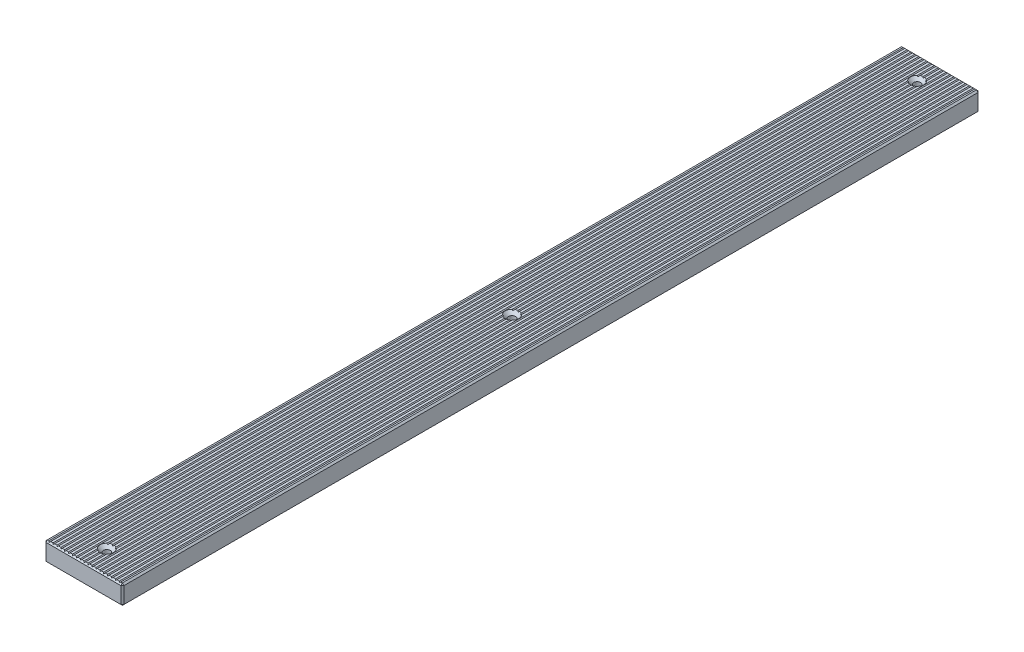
ISO-10303-21;
HEADER;
FILE_DESCRIPTION(('STEP AP214'),'2;1');
FILE_NAME('part.step','',(''),(''),'','','');
FILE_SCHEMA(('AUTOMOTIVE_DESIGN { 1 0 10303 214 1 1 1 1 }'));
ENDSEC;
DATA;
#1=APPLICATION_CONTEXT('core data for automotive mechanical design processes');
#2=APPLICATION_PROTOCOL_DEFINITION('international standard','automotive_design',2000,#1);
#3=PRODUCT_CONTEXT('',#1,'mechanical');
#4=PRODUCT('Part','Part','',(#3));
#5=PRODUCT_RELATED_PRODUCT_CATEGORY('part','',(#4));
#6=PRODUCT_DEFINITION_FORMATION('','',#4);
#7=PRODUCT_DEFINITION_CONTEXT('part definition',#1,'design');
#8=PRODUCT_DEFINITION('design','',#6,#7);
#9=PRODUCT_DEFINITION_SHAPE('','',#8);
#10=(LENGTH_UNIT() NAMED_UNIT(*) SI_UNIT(.MILLI.,.METRE.));
#11=(NAMED_UNIT(*) PLANE_ANGLE_UNIT() SI_UNIT($,.RADIAN.));
#12=(NAMED_UNIT(*) SI_UNIT($,.STERADIAN.) SOLID_ANGLE_UNIT());
#13=UNCERTAINTY_MEASURE_WITH_UNIT(LENGTH_MEASURE(1.E-05),#10,'distance_accuracy_value','');
#14=(GEOMETRIC_REPRESENTATION_CONTEXT(3) GLOBAL_UNCERTAINTY_ASSIGNED_CONTEXT((#13)) GLOBAL_UNIT_ASSIGNED_CONTEXT((#10,
#11,#12)) REPRESENTATION_CONTEXT('',''));
#15=CARTESIAN_POINT('',(0.,0.,0.));
#16=DIRECTION('',(0.,0.,1.));
#17=DIRECTION('',(1.,0.,0.));
#18=AXIS2_PLACEMENT_3D('',#15,#16,#17);
#19=CARTESIAN_POINT('',(50.,12.5,550.));
#20=DIRECTION('',(0.,-1.,0.));
#21=DIRECTION('',(1.,0.,0.));
#22=AXIS2_PLACEMENT_3D('',#19,#20,#21);
#23=PLANE('',#22);
#24=CARTESIAN_POINT('',(0.,12.5,-520.));
#25=DIRECTION('',(0.,1.,0.));
#26=DIRECTION('',(0.,0.,1.));
#27=AXIS2_PLACEMENT_3D('',#24,#25,#26);
#28=CIRCLE('',#27,8.65);
#29=CARTESIAN_POINT('',(-1.00000000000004,12.5,-528.592002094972));
#30=VERTEX_POINT('',#29);
#31=CARTESIAN_POINT('',(-3.99999999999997,12.5,-527.669582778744));
#32=VERTEX_POINT('',#31);
#33=EDGE_CURVE('E1781',#30,#32,#28,.T.);
#34=ORIENTED_EDGE('',*,*,#33,.F.);
#35=DIRECTION('',(0.,0.,1.));
#36=VECTOR('',#35,1.);
#37=CARTESIAN_POINT('',(-1.,12.5,-550.));
#38=LINE('',#37,#36);
#39=CARTESIAN_POINT('',(-1.,12.5,-548.));
#40=VERTEX_POINT('',#39);
#41=EDGE_CURVE('E664',#40,#30,#38,.T.);
#42=ORIENTED_EDGE('',*,*,#41,.F.);
#43=DIRECTION('',(-1.,0.,0.));
#44=VECTOR('',#43,1.);
#45=CARTESIAN_POINT('',(50.,12.5,-548.));
#46=LINE('',#45,#44);
#47=CARTESIAN_POINT('',(-3.99999999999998,12.5,-548.));
#48=VERTEX_POINT('',#47);
#49=EDGE_CURVE('E1832',#40,#48,#46,.T.);
#50=ORIENTED_EDGE('',*,*,#49,.T.);
#51=DIRECTION('',(0.,0.,1.));
#52=VECTOR('',#51,1.);
#53=CARTESIAN_POINT('',(-4.,12.5,-550.));
#54=LINE('',#53,#52);
#55=EDGE_CURVE('E684',#48,#32,#54,.T.);
#56=ORIENTED_EDGE('',*,*,#55,.T.);
#57=EDGE_LOOP('',(#34,#42,#50,#56));
#58=FACE_BOUND('',#57,.T.);
#59=ADVANCED_FACE('F33',(#58),#23,.F.);
#60=CARTESIAN_POINT('',(-3.99999999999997,12.5,-512.330417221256));
#61=VERTEX_POINT('',#60);
#62=CARTESIAN_POINT('',(-1.00000000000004,12.5,-511.407997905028));
#63=VERTEX_POINT('',#62);
#64=EDGE_CURVE('E651',#61,#63,#28,.T.);
#65=ORIENTED_EDGE('',*,*,#64,.F.);
#66=CARTESIAN_POINT('',(-3.99999999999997,12.5,-7.66958277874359));
#67=VERTEX_POINT('',#66);
#68=EDGE_CURVE('E687',#61,#67,#54,.T.);
#69=ORIENTED_EDGE('',*,*,#68,.T.);
#70=CARTESIAN_POINT('',(0.,12.5,0.));
#71=DIRECTION('',(0.,1.,0.));
#72=DIRECTION('',(0.,0.,1.));
#73=AXIS2_PLACEMENT_3D('',#70,#71,#72);
#74=CIRCLE('',#73,8.65);
#75=CARTESIAN_POINT('',(-1.00000000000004,12.5,-8.59200209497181));
#76=VERTEX_POINT('',#75);
#77=EDGE_CURVE('E1332',#76,#67,#74,.T.);
#78=ORIENTED_EDGE('',*,*,#77,.F.);
#79=EDGE_CURVE('E1787',#63,#76,#38,.T.);
#80=ORIENTED_EDGE('',*,*,#79,.F.);
#81=EDGE_LOOP('',(#65,#69,#78,#80));
#82=FACE_BOUND('',#81,.T.);
#83=ADVANCED_FACE('F1584',(#82),#23,.F.);
#84=CARTESIAN_POINT('',(1.00000000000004,12.5,-511.407997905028));
#85=VERTEX_POINT('',#84);
#86=CARTESIAN_POINT('',(3.99999999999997,12.5,-512.330417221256));
#87=VERTEX_POINT('',#86);
#88=EDGE_CURVE('E633',#85,#87,#28,.T.);
#89=ORIENTED_EDGE('',*,*,#88,.F.);
#90=DIRECTION('',(0.,0.,1.));
#91=VECTOR('',#90,1.);
#92=CARTESIAN_POINT('',(1.,12.5,-550.));
#93=LINE('',#92,#91);
#94=CARTESIAN_POINT('',(1.00000000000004,12.5,-8.59200209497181));
#95=VERTEX_POINT('',#94);
#96=EDGE_CURVE('E646',#85,#95,#93,.T.);
#97=ORIENTED_EDGE('',*,*,#96,.T.);
#98=CARTESIAN_POINT('',(3.99999999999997,12.5,-7.66958277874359));
#99=VERTEX_POINT('',#98);
#100=EDGE_CURVE('E1330',#99,#95,#74,.T.);
#101=ORIENTED_EDGE('',*,*,#100,.F.);
#102=DIRECTION('',(0.,0.,1.));
#103=VECTOR('',#102,1.);
#104=CARTESIAN_POINT('',(4.,12.5,-550.));
#105=LINE('',#104,#103);
#106=EDGE_CURVE('E648',#87,#99,#105,.T.);
#107=ORIENTED_EDGE('',*,*,#106,.F.);
#108=EDGE_LOOP('',(#89,#97,#101,#107));
#109=FACE_BOUND('',#108,.T.);
#110=ADVANCED_FACE('F644',(#109),#23,.F.);
#111=CARTESIAN_POINT('',(3.99999999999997,12.5,-527.669582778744));
#112=VERTEX_POINT('',#111);
#113=CARTESIAN_POINT('',(1.00000000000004,12.5,-528.592002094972));
#114=VERTEX_POINT('',#113);
#115=EDGE_CURVE('E1780',#112,#114,#28,.T.);
#116=ORIENTED_EDGE('',*,*,#115,.F.);
#117=CARTESIAN_POINT('',(4.,12.5,-548.));
#118=VERTEX_POINT('',#117);
#119=EDGE_CURVE('E1298',#118,#112,#105,.T.);
#120=ORIENTED_EDGE('',*,*,#119,.F.);
#121=CARTESIAN_POINT('',(1.00000000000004,12.5,-548.));
#122=VERTEX_POINT('',#121);
#123=EDGE_CURVE('E1770',#118,#122,#46,.T.);
#124=ORIENTED_EDGE('',*,*,#123,.T.);
#125=EDGE_CURVE('E656',#122,#114,#93,.T.);
#126=ORIENTED_EDGE('',*,*,#125,.T.);
#127=EDGE_LOOP('',(#116,#120,#124,#126));
#128=FACE_BOUND('',#127,.T.);
#129=ADVANCED_FACE('F1778',(#128),#23,.F.);
#130=CARTESIAN_POINT('',(-6.00000000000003,12.5,-526.230770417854));
#131=VERTEX_POINT('',#130);
#132=CARTESIAN_POINT('',(-6.00000000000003,12.5,-513.769229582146));
#133=VERTEX_POINT('',#132);
#134=EDGE_CURVE('E1782',#131,#133,#28,.T.);
#135=ORIENTED_EDGE('',*,*,#134,.F.);
#136=DIRECTION('',(0.,0.,1.));
#137=VECTOR('',#136,1.);
#138=CARTESIAN_POINT('',(-6.,12.5,-550.));
#139=LINE('',#138,#137);
#140=CARTESIAN_POINT('',(-6.,12.5,-548.));
#141=VERTEX_POINT('',#140);
#142=EDGE_CURVE('E678',#141,#131,#139,.T.);
#143=ORIENTED_EDGE('',*,*,#142,.F.);
#144=CARTESIAN_POINT('',(-8.99999999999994,12.5,-548.));
#145=VERTEX_POINT('',#144);
#146=EDGE_CURVE('E1836',#141,#145,#46,.T.);
#147=ORIENTED_EDGE('',*,*,#146,.T.);
#148=DIRECTION('',(0.,0.,1.));
#149=VECTOR('',#148,1.);
#150=CARTESIAN_POINT('',(-8.99999999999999,12.5,-550.));
#151=LINE('',#150,#149);
#152=CARTESIAN_POINT('',(-8.99999999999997,12.5,548.));
#153=VERTEX_POINT('',#152);
#154=EDGE_CURVE('E702',#145,#153,#151,.T.);
#155=ORIENTED_EDGE('',*,*,#154,.T.);
#156=DIRECTION('',(1.,0.,0.));
#157=VECTOR('',#156,1.);
#158=CARTESIAN_POINT('',(50.,12.5,548.));
#159=LINE('',#158,#157);
#160=CARTESIAN_POINT('',(-6.,12.5,548.));
#161=VERTEX_POINT('',#160);
#162=EDGE_CURVE('E1367',#153,#161,#159,.T.);
#163=ORIENTED_EDGE('',*,*,#162,.T.);
#164=CARTESIAN_POINT('',(-6.00000000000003,12.5,526.230770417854));
#165=VERTEX_POINT('',#164);
#166=EDGE_CURVE('E683',#165,#161,#139,.T.);
#167=ORIENTED_EDGE('',*,*,#166,.F.);
#168=CARTESIAN_POINT('',(0.,12.5,520.));
#169=DIRECTION('',(0.,1.,0.));
#170=DIRECTION('',(0.,0.,1.));
#171=AXIS2_PLACEMENT_3D('',#168,#169,#170);
#172=CIRCLE('',#171,8.65);
#173=CARTESIAN_POINT('',(-6.00000000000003,12.5,513.769229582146));
#174=VERTEX_POINT('',#173);
#175=EDGE_CURVE('E1731',#174,#165,#172,.T.);
#176=ORIENTED_EDGE('',*,*,#175,.F.);
#177=CARTESIAN_POINT('',(-6.00000000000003,12.5,6.23077041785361));
#178=VERTEX_POINT('',#177);
#179=EDGE_CURVE('E2805',#178,#174,#139,.T.);
#180=ORIENTED_EDGE('',*,*,#179,.F.);
#181=CARTESIAN_POINT('',(-6.00000000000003,12.5,-6.23077041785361));
#182=VERTEX_POINT('',#181);
#183=EDGE_CURVE('E1333',#182,#178,#74,.T.);
#184=ORIENTED_EDGE('',*,*,#183,.F.);
#185=EDGE_CURVE('E682',#133,#182,#139,.T.);
#186=ORIENTED_EDGE('',*,*,#185,.F.);
#187=EDGE_LOOP('',(#135,#143,#147,#155,#163,#167,#176,#180,#184,#186));
#188=FACE_BOUND('',#187,.T.);
#189=ADVANCED_FACE('F1986',(#188),#23,.F.);
#190=CARTESIAN_POINT('',(-6.,12.5,-550.));
#191=DIRECTION('',(-0.707106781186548,-0.707106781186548,0.));
#192=DIRECTION('',(0.707106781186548,-0.707106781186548,0.));
#193=AXIS2_PLACEMENT_3D('',#190,#191,#192);
#194=PLANE('',#193);
#195=DIRECTION('',(0.,0.,1.));
#196=VECTOR('',#195,1.);
#197=CARTESIAN_POINT('',(-5.,11.5,-550.));
#198=LINE('',#197,#196);
#199=CARTESIAN_POINT('',(-4.99999999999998,11.5,-514.210138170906));
#200=VERTEX_POINT('',#199);
#201=CARTESIAN_POINT('',(-5.,11.5,-5.78986182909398));
#202=VERTEX_POINT('',#201);
#203=EDGE_CURVE('E692',#200,#202,#198,.T.);
#204=ORIENTED_EDGE('',*,*,#203,.F.);
#205=CARTESIAN_POINT('',(-4.9998,11.4998,-514.210229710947));
#206=CARTESIAN_POINT('',(-5.08288445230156,11.5828844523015,-514.172202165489));
#207=CARTESIAN_POINT('',(-5.16604616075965,11.6660461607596,-514.134512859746));
#208=CARTESIAN_POINT('',(-5.33251209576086,11.8325120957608,-514.059780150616));
#209=CARTESIAN_POINT('',(-5.41581631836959,11.9158163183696,-514.022736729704));
#210=CARTESIAN_POINT('',(-5.58255946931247,12.0825594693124,-513.94926329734));
#211=CARTESIAN_POINT('',(-5.66599839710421,12.1659983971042,-513.912833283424));
#212=CARTESIAN_POINT('',(-5.83300517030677,12.3330051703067,-513.8405574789));
#213=CARTESIAN_POINT('',(-5.91657301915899,12.416573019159,-513.804711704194));
#214=CARTESIAN_POINT('',(-6.00020000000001,12.5002,-513.769144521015));
#215=B_SPLINE_CURVE_WITH_KNOTS('',3,(#205,#206,#207,#208,#209,#210,#211,#212,#213,#214),
.UNSPECIFIED.,.F.,.F.,(4,2,2,2,4),(0.,0.370497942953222,0.740985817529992,1.11147220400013,
1.48196865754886),.UNSPECIFIED.);
#216=EDGE_CURVE('E1186',#200,#133,#215,.T.);
#217=ORIENTED_EDGE('',*,*,#216,.T.);
#218=ORIENTED_EDGE('',*,*,#185,.T.);
#219=CARTESIAN_POINT('',(-6.0002,12.5002,-6.23085547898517));
#220=CARTESIAN_POINT('',(-5.91657301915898,12.4165730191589,-6.19528829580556));
#221=CARTESIAN_POINT('',(-5.83300517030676,12.3330051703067,-6.15944252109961));
#222=CARTESIAN_POINT('',(-5.66599839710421,12.1659983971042,-6.08716671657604));
#223=CARTESIAN_POINT('',(-5.58255946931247,12.0825594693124,-6.0507367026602));
#224=CARTESIAN_POINT('',(-5.4158163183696,11.9158163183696,-5.97726327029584));
#225=CARTESIAN_POINT('',(-5.33251209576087,11.8325120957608,-5.94021984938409));
#226=CARTESIAN_POINT('',(-5.16604616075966,11.6660461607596,-5.86548714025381));
#227=CARTESIAN_POINT('',(-5.08288445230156,11.5828844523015,-5.82779783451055));
#228=CARTESIAN_POINT('',(-4.9998,11.4998,-5.78977028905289));
#229=B_SPLINE_CURVE_WITH_KNOTS('',3,(#219,#220,#221,#222,#223,#224,#225,#226,#227,#228),
.UNSPECIFIED.,.F.,.F.,(4,2,2,2,4),(0.,0.37049645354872,0.740982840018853,1.11147071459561,
1.48196865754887),.UNSPECIFIED.);
#230=EDGE_CURVE('E1255',#182,#202,#229,.T.);
#231=ORIENTED_EDGE('',*,*,#230,.T.);
#232=EDGE_LOOP('',(#204,#217,#218,#231));
#233=FACE_BOUND('',#232,.T.);
#234=ADVANCED_FACE('F1822',(#233),#194,.F.);
#235=CARTESIAN_POINT('',(-5.,11.5,-550.));
#236=DIRECTION('',(0.707106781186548,-0.707106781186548,0.));
#237=DIRECTION('',(0.707106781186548,0.707106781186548,0.));
#238=AXIS2_PLACEMENT_3D('',#235,#236,#237);
#239=PLANE('',#238);
#240=ORIENTED_EDGE('',*,*,#68,.F.);
#241=CARTESIAN_POINT('',(-3.99979999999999,12.5002,-512.330087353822));
#242=CARTESIAN_POINT('',(-4.09016586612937,12.4098341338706,-512.479136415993));
#243=CARTESIAN_POINT('',(-4.17902611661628,12.3209738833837,-512.630030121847));
#244=CARTESIAN_POINT('',(-4.35329200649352,12.1467079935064,-512.935472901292));
#245=CARTESIAN_POINT('',(-4.43870141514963,12.0612985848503,-513.090017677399));
#246=CARTESIAN_POINT('',(-4.60584199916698,11.894158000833,-513.403091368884));
#247=CARTESIAN_POINT('',(-4.68757250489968,11.8124274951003,-513.561621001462));
#248=CARTESIAN_POINT('',(-4.84702409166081,11.6529759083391,-513.88292551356));
#249=CARTESIAN_POINT('',(-4.92474055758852,11.5752594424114,-514.045704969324));
#250=CARTESIAN_POINT('',(-5.00019999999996,11.4998,-514.210575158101));
#251=B_SPLINE_CURVE_WITH_KNOTS('',3,(#241,#242,#243,#244,#245,#246,#247,#248,#249,#250),
.UNSPECIFIED.,.F.,.F.,(4,2,2,2,4),(0.,0.589006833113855,1.17735188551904,1.76580359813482,
2.35491746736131),.UNSPECIFIED.);
#252=EDGE_CURVE('E1181',#61,#200,#251,.T.);
#253=ORIENTED_EDGE('',*,*,#252,.T.);
#254=ORIENTED_EDGE('',*,*,#203,.T.);
#255=CARTESIAN_POINT('',(-5.0002,11.4998,-5.78942484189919));
#256=CARTESIAN_POINT('',(-4.92474055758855,11.5752594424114,-5.95429503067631));
#257=CARTESIAN_POINT('',(-4.84702409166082,11.6529759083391,-6.11707448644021));
#258=CARTESIAN_POINT('',(-4.68757250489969,11.8124274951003,-6.43837899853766));
#259=CARTESIAN_POINT('',(-4.60584199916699,11.894158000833,-6.59690863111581));
#260=CARTESIAN_POINT('',(-4.43870141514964,12.0612985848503,-6.90998232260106));
#261=CARTESIAN_POINT('',(-4.35329200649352,12.1467079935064,-7.06452709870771));
#262=CARTESIAN_POINT('',(-4.17902611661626,12.3209738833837,-7.36996987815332));
#263=CARTESIAN_POINT('',(-4.09016586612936,12.4098341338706,-7.52086358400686));
#264=CARTESIAN_POINT('',(-3.99979999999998,12.5002,-7.66991264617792));
#265=B_SPLINE_CURVE_WITH_KNOTS('',3,(#255,#256,#257,#258,#259,#260,#261,#262,#263,#264),
.UNSPECIFIED.,.F.,.F.,(4,2,2,2,4),(0.,0.589113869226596,1.17756558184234,1.76591063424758,
2.35491746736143),.UNSPECIFIED.);
#266=EDGE_CURVE('E1110',#202,#67,#265,.T.);
#267=ORIENTED_EDGE('',*,*,#266,.T.);
#268=EDGE_LOOP('',(#240,#253,#254,#267));
#269=FACE_BOUND('',#268,.T.);
#270=ADVANCED_FACE('F1098',(#269),#239,.F.);
#271=CARTESIAN_POINT('',(-1.,12.5,-550.));
#272=DIRECTION('',(-0.707106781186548,-0.707106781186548,0.));
#273=DIRECTION('',(0.707106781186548,-0.707106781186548,0.));
#274=AXIS2_PLACEMENT_3D('',#271,#272,#273);
#275=PLANE('',#274);
#276=DIRECTION('',(0.,0.,1.));
#277=VECTOR('',#276,1.);
#278=CARTESIAN_POINT('',(0.,11.5,-550.));
#279=LINE('',#278,#277);
#280=CARTESIAN_POINT('',(0.,11.4999999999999,-512.35));
#281=VERTEX_POINT('',#280);
#282=CARTESIAN_POINT('',(0.,11.5,-7.64999999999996));
#283=VERTEX_POINT('',#282);
#284=EDGE_CURVE('E669',#281,#283,#279,.T.);
#285=ORIENTED_EDGE('',*,*,#284,.F.);
#286=CARTESIAN_POINT('',(0.000200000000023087,11.4997999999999,-512.350200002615));
#287=CARTESIAN_POINT('',(-0.0816057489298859,11.5816057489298,-512.268394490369));
#288=CARTESIAN_POINT('',(-0.163846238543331,11.6638462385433,-512.187461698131));
#289=CARTESIAN_POINT('',(-0.32911716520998,11.8291171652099,-512.027270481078));
#290=CARTESIAN_POINT('',(-0.41214745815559,11.9121474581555,-511.948011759));
#291=CARTESIAN_POINT('',(-0.578945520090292,12.0789455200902,-511.791070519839));
#292=CARTESIAN_POINT('',(-0.6627132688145,12.1627132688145,-511.713387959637));
#293=CARTESIAN_POINT('',(-0.830948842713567,12.3309488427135,-511.559506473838));
#294=CARTESIAN_POINT('',(-0.915416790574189,12.4154167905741,-511.483307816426));
#295=CARTESIAN_POINT('',(-1.00020000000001,12.5002,-511.407819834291));
#296=B_SPLINE_CURVE_WITH_KNOTS('',3,(#286,#287,#288,#289,#290,#291,#292,#293,#294,#295),
.UNSPECIFIED.,.F.,.F.,(4,2,2,2,4),(0.,0.42506801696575,0.850059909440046,1.27504015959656,
1.70009651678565),.UNSPECIFIED.);
#297=EDGE_CURVE('E636',#281,#63,#296,.T.);
#298=ORIENTED_EDGE('',*,*,#297,.T.);
#299=ORIENTED_EDGE('',*,*,#79,.T.);
#300=CARTESIAN_POINT('',(-1.0002,12.5002,-8.59218016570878));
#301=CARTESIAN_POINT('',(-0.915416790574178,12.4154167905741,-8.51669218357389));
#302=CARTESIAN_POINT('',(-0.830948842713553,12.3309488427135,-8.4404935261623));
#303=CARTESIAN_POINT('',(-0.66271326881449,12.1627132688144,-8.28661204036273));
#304=CARTESIAN_POINT('',(-0.57894552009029,12.0789455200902,-8.20892948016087));
#305=CARTESIAN_POINT('',(-0.412147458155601,11.9121474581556,-8.0519882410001));
#306=CARTESIAN_POINT('',(-0.329117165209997,11.82911716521,-7.97272951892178));
#307=CARTESIAN_POINT('',(-0.163846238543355,11.6638462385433,-7.81253830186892));
#308=CARTESIAN_POINT('',(-0.0816057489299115,11.5816057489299,-7.73160550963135));
#309=CARTESIAN_POINT('',(0.000200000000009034,11.4997999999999,-7.64979999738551));
#310=B_SPLINE_CURVE_WITH_KNOTS('',3,(#300,#301,#302,#303,#304,#305,#306,#307,#308,#309),
.UNSPECIFIED.,.F.,.F.,(4,2,2,2,4),(0.,0.425056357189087,0.850036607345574,1.27502849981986,
1.70009651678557),.UNSPECIFIED.);
#311=EDGE_CURVE('E1239',#76,#283,#310,.T.);
#312=ORIENTED_EDGE('',*,*,#311,.T.);
#313=EDGE_LOOP('',(#285,#298,#299,#312));
#314=FACE_BOUND('',#313,.T.);
#315=ADVANCED_FACE('F1786',(#314),#275,.F.);
#316=CARTESIAN_POINT('',(0.,11.5,-550.));
#317=DIRECTION('',(0.707106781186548,-0.707106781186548,0.));
#318=DIRECTION('',(0.707106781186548,0.707106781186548,0.));
#319=AXIS2_PLACEMENT_3D('',#316,#317,#318);
#320=PLANE('',#319);
#321=ORIENTED_EDGE('',*,*,#96,.F.);
#322=CARTESIAN_POINT('',(1.00020000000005,12.5002,-511.407819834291));
#323=CARTESIAN_POINT('',(0.91541679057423,12.4154167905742,-511.483307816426));
#324=CARTESIAN_POINT('',(0.830948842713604,12.3309488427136,-511.559506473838));
#325=CARTESIAN_POINT('',(0.662713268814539,12.1627132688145,-511.713387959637));
#326=CARTESIAN_POINT('',(0.578945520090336,12.0789455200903,-511.791070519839));
#327=CARTESIAN_POINT('',(0.412147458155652,11.9121474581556,-511.948011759));
#328=CARTESIAN_POINT('',(0.329117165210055,11.82911716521,-512.027270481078));
#329=CARTESIAN_POINT('',(0.16384623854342,11.6638462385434,-512.187461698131));
#330=CARTESIAN_POINT('',(0.081605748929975,11.5816057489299,-512.268394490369));
#331=CARTESIAN_POINT('',(-0.000199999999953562,11.4998,-512.350200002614));
#332=B_SPLINE_CURVE_WITH_KNOTS('',3,(#322,#323,#324,#325,#326,#327,#328,#329,#330,#331),
.UNSPECIFIED.,.F.,.F.,(4,2,2,2,4),(0.,0.425056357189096,0.850036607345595,1.27502849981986,
1.70009651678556),.UNSPECIFIED.);
#333=EDGE_CURVE('E630',#85,#281,#332,.T.);
#334=ORIENTED_EDGE('',*,*,#333,.T.);
#335=ORIENTED_EDGE('',*,*,#284,.T.);
#336=CARTESIAN_POINT('',(-0.000199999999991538,11.4998,-7.64979999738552));
#337=CARTESIAN_POINT('',(0.0816057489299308,11.5816057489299,-7.73160550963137));
#338=CARTESIAN_POINT('',(0.163846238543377,11.6638462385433,-7.81253830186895));
#339=CARTESIAN_POINT('',(0.329117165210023,11.82911716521,-7.9727295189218));
#340=CARTESIAN_POINT('',(0.412147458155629,11.9121474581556,-8.05198824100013));
#341=CARTESIAN_POINT('',(0.578945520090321,12.0789455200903,-8.2089294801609));
#342=CARTESIAN_POINT('',(0.662713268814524,12.1627132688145,-8.28661204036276));
#343=CARTESIAN_POINT('',(0.83094884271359,12.3309488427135,-8.44049352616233));
#344=CARTESIAN_POINT('',(0.915416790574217,12.4154167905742,-8.51669218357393));
#345=CARTESIAN_POINT('',(1.00020000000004,12.5002,-8.59218016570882));
#346=B_SPLINE_CURVE_WITH_KNOTS('',3,(#336,#337,#338,#339,#340,#341,#342,#343,#344,#345),
.UNSPECIFIED.,.F.,.F.,(4,2,2,2,4),(0.,0.425068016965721,0.850059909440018,1.27504015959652,
1.70009651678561),.UNSPECIFIED.);
#347=EDGE_CURVE('E655',#283,#95,#346,.T.);
#348=ORIENTED_EDGE('',*,*,#347,.T.);
#349=EDGE_LOOP('',(#321,#334,#335,#348));
#350=FACE_BOUND('',#349,.T.);
#351=ADVANCED_FACE('F653',(#350),#320,.F.);
#352=CARTESIAN_POINT('',(4.,12.5,-550.));
#353=DIRECTION('',(-0.707106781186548,-0.707106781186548,0.));
#354=DIRECTION('',(0.707106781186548,-0.707106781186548,0.));
#355=AXIS2_PLACEMENT_3D('',#352,#353,#354);
#356=PLANE('',#355);
#357=DIRECTION('',(0.,0.,1.));
#358=VECTOR('',#357,1.);
#359=CARTESIAN_POINT('',(5.,11.5,-550.));
#360=LINE('',#359,#358);
#361=CARTESIAN_POINT('',(5.00000000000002,11.5,-514.210138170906));
#362=VERTEX_POINT('',#361);
#363=CARTESIAN_POINT('',(5.,11.5,-5.78986182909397));
#364=VERTEX_POINT('',#363);
#365=EDGE_CURVE('E1312',#362,#364,#360,.T.);
#366=ORIENTED_EDGE('',*,*,#365,.F.);
#367=CARTESIAN_POINT('',(5.00019999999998,11.4998,-514.210575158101));
#368=CARTESIAN_POINT('',(4.92474055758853,11.5752594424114,-514.045704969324));
#369=CARTESIAN_POINT('',(4.84702409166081,11.6529759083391,-513.88292551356));
#370=CARTESIAN_POINT('',(4.68757250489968,11.8124274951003,-513.561621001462));
#371=CARTESIAN_POINT('',(4.60584199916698,11.894158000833,-513.403091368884));
#372=CARTESIAN_POINT('',(4.43870141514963,12.0612985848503,-513.090017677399));
#373=CARTESIAN_POINT('',(4.35329200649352,12.1467079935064,-512.935472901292));
#374=CARTESIAN_POINT('',(4.17902611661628,12.3209738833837,-512.630030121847));
#375=CARTESIAN_POINT('',(4.09016586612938,12.4098341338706,-512.479136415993));
#376=CARTESIAN_POINT('',(3.9998,12.5002,-512.330087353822));
#377=B_SPLINE_CURVE_WITH_KNOTS('',3,(#367,#368,#369,#370,#371,#372,#373,#374,#375,#376),
.UNSPECIFIED.,.F.,.F.,(4,2,2,2,4),(0.,0.589113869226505,1.17756558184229,1.76591063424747,
2.35491746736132),.UNSPECIFIED.);
#378=EDGE_CURVE('E1160',#362,#87,#377,.T.);
#379=ORIENTED_EDGE('',*,*,#378,.T.);
#380=ORIENTED_EDGE('',*,*,#106,.T.);
#381=CARTESIAN_POINT('',(3.9998,12.5002,-7.66991264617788));
#382=CARTESIAN_POINT('',(4.09016586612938,12.4098341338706,-7.52086358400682));
#383=CARTESIAN_POINT('',(4.17902611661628,12.3209738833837,-7.36996987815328));
#384=CARTESIAN_POINT('',(4.35329200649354,12.1467079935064,-7.06452709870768));
#385=CARTESIAN_POINT('',(4.43870141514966,12.0612985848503,-6.90998232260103));
#386=CARTESIAN_POINT('',(4.605841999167,11.894158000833,-6.59690863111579));
#387=CARTESIAN_POINT('',(4.6875725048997,11.8124274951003,-6.43837899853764));
#388=CARTESIAN_POINT('',(4.84702409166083,11.6529759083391,-6.1170744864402));
#389=CARTESIAN_POINT('',(4.92474055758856,11.5752594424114,-5.9542950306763));
#390=CARTESIAN_POINT('',(5.0002,11.4998,-5.78942484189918));
#391=B_SPLINE_CURVE_WITH_KNOTS('',3,(#381,#382,#383,#384,#385,#386,#387,#388,#389,#390),
.UNSPECIFIED.,.F.,.F.,(4,2,2,2,4),(0.,0.589006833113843,1.17735188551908,1.7658035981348,
2.35491746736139),.UNSPECIFIED.);
#392=EDGE_CURVE('E1202',#99,#364,#391,.T.);
#393=ORIENTED_EDGE('',*,*,#392,.T.);
#394=EDGE_LOOP('',(#366,#379,#380,#393));
#395=FACE_BOUND('',#394,.T.);
#396=ADVANCED_FACE('F1566',(#395),#356,.F.);
#397=CARTESIAN_POINT('',(5.,11.5,-550.));
#398=DIRECTION('',(0.707106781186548,-0.707106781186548,0.));
#399=DIRECTION('',(0.707106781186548,0.707106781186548,0.));
#400=AXIS2_PLACEMENT_3D('',#397,#398,#399);
#401=PLANE('',#400);
#402=DIRECTION('',(0.,0.,1.));
#403=VECTOR('',#402,1.);
#404=CARTESIAN_POINT('',(6.00000000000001,12.5,-550.));
#405=LINE('',#404,#403);
#406=CARTESIAN_POINT('',(6.00000000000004,12.5,-513.769229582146));
#407=VERTEX_POINT('',#406);
#408=CARTESIAN_POINT('',(6.00000000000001,12.5,-6.23077041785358));
#409=VERTEX_POINT('',#408);
#410=EDGE_CURVE('E60',#407,#409,#405,.T.);
#411=ORIENTED_EDGE('',*,*,#410,.F.);
#412=CARTESIAN_POINT('',(6.00020000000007,12.5002,-513.769144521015));
#413=CARTESIAN_POINT('',(5.91657301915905,12.416573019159,-513.804711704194));
#414=CARTESIAN_POINT('',(5.83300517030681,12.3330051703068,-513.8405574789));
#415=CARTESIAN_POINT('',(5.66599839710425,12.1659983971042,-513.912833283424));
#416=CARTESIAN_POINT('',(5.5825594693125,12.0825594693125,-513.94926329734));
#417=CARTESIAN_POINT('',(5.41581631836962,11.9158163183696,-514.022736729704));
#418=CARTESIAN_POINT('',(5.33251209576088,11.8325120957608,-514.059780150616));
#419=CARTESIAN_POINT('',(5.16604616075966,11.6660461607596,-514.134512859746));
#420=CARTESIAN_POINT('',(5.08288445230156,11.5828844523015,-514.172202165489));
#421=CARTESIAN_POINT('',(4.9998,11.4997999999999,-514.210229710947));
#422=B_SPLINE_CURVE_WITH_KNOTS('',3,(#412,#413,#414,#415,#416,#417,#418,#419,#420,#421),
.UNSPECIFIED.,.F.,.F.,(4,2,2,2,4),(0.,0.370496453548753,0.740982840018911,1.1114707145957,
1.48196865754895),.UNSPECIFIED.);
#423=EDGE_CURVE('E11',#407,#362,#422,.T.);
#424=ORIENTED_EDGE('',*,*,#423,.T.);
#425=ORIENTED_EDGE('',*,*,#365,.T.);
#426=CARTESIAN_POINT('',(4.9998,11.4997999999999,-5.78977028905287));
#427=CARTESIAN_POINT('',(5.08288445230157,11.5828844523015,-5.82779783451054));
#428=CARTESIAN_POINT('',(5.16604616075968,11.6660461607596,-5.8654871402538));
#429=CARTESIAN_POINT('',(5.3325120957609,11.8325120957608,-5.94021984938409));
#430=CARTESIAN_POINT('',(5.41581631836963,11.9158163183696,-5.97726327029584));
#431=CARTESIAN_POINT('',(5.58255946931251,12.0825594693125,-6.0507367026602));
#432=CARTESIAN_POINT('',(5.66599839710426,12.1659983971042,-6.08716671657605));
#433=CARTESIAN_POINT('',(5.83300517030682,12.3330051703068,-6.15944252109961));
#434=CARTESIAN_POINT('',(5.91657301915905,12.416573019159,-6.19528829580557));
#435=CARTESIAN_POINT('',(6.00020000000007,12.5002,-6.23085547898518));
#436=B_SPLINE_CURVE_WITH_KNOTS('',3,(#426,#427,#428,#429,#430,#431,#432,#433,#434,#435),
.UNSPECIFIED.,.F.,.F.,(4,2,2,2,4),(0.,0.370497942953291,0.740985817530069,1.11147220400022,
1.48196865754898),.UNSPECIFIED.);
#437=EDGE_CURVE('E1221',#364,#409,#436,.T.);
#438=ORIENTED_EDGE('',*,*,#437,.T.);
#439=EDGE_LOOP('',(#411,#424,#425,#438));
#440=FACE_BOUND('',#439,.T.);
#441=ADVANCED_FACE('F1564',(#440),#401,.F.);
#442=CARTESIAN_POINT('',(3.99999999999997,12.5,7.66958277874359));
#443=VERTEX_POINT('',#442);
#444=CARTESIAN_POINT('',(3.99999999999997,12.5,512.330417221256));
#445=VERTEX_POINT('',#444);
#446=EDGE_CURVE('E1285',#443,#445,#105,.T.);
#447=ORIENTED_EDGE('',*,*,#446,.F.);
#448=CARTESIAN_POINT('',(1.00000000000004,12.5,8.59200209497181));
#449=VERTEX_POINT('',#448);
#450=EDGE_CURVE('E1193',#449,#443,#74,.T.);
#451=ORIENTED_EDGE('',*,*,#450,.F.);
#452=CARTESIAN_POINT('',(1.00000000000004,12.5,511.407997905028));
#453=VERTEX_POINT('',#452);
#454=EDGE_CURVE('E657',#449,#453,#93,.T.);
#455=ORIENTED_EDGE('',*,*,#454,.T.);
#456=EDGE_CURVE('E1295',#445,#453,#172,.T.);
#457=ORIENTED_EDGE('',*,*,#456,.F.);
#458=EDGE_LOOP('',(#447,#451,#455,#457));
#459=FACE_BOUND('',#458,.T.);
#460=ADVANCED_FACE('F1293',(#459),#23,.F.);
#461=CARTESIAN_POINT('',(-3.99999999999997,12.5,7.66958277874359));
#462=VERTEX_POINT('',#461);
#463=CARTESIAN_POINT('',(-1.00000000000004,12.5,8.59200209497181));
#464=VERTEX_POINT('',#463);
#465=EDGE_CURVE('E1192',#462,#464,#74,.T.);
#466=ORIENTED_EDGE('',*,*,#465,.F.);
#467=CARTESIAN_POINT('',(-3.99999999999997,12.5,512.330417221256));
#468=VERTEX_POINT('',#467);
#469=EDGE_CURVE('E1341',#462,#468,#54,.T.);
#470=ORIENTED_EDGE('',*,*,#469,.T.);
#471=CARTESIAN_POINT('',(-1.00000000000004,12.5,511.407997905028));
#472=VERTEX_POINT('',#471);
#473=EDGE_CURVE('E1734',#472,#468,#172,.T.);
#474=ORIENTED_EDGE('',*,*,#473,.F.);
#475=EDGE_CURVE('E1343',#464,#472,#38,.T.);
#476=ORIENTED_EDGE('',*,*,#475,.F.);
#477=EDGE_LOOP('',(#466,#470,#474,#476));
#478=FACE_BOUND('',#477,.T.);
#479=ADVANCED_FACE('F1339',(#478),#23,.F.);
#480=CARTESIAN_POINT('',(-5.,11.5,5.78986182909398));
#481=VERTEX_POINT('',#480);
#482=CARTESIAN_POINT('',(-4.99999999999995,11.5,514.210138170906));
#483=VERTEX_POINT('',#482);
#484=EDGE_CURVE('E2808',#481,#483,#198,.T.);
#485=ORIENTED_EDGE('',*,*,#484,.F.);
#486=CARTESIAN_POINT('',(-4.99980000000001,11.4998,5.78977028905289));
#487=CARTESIAN_POINT('',(-5.08288445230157,11.5828844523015,5.82779783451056));
#488=CARTESIAN_POINT('',(-5.16604616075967,11.6660461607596,5.86548714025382));
#489=CARTESIAN_POINT('',(-5.33251209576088,11.8325120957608,5.9402198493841));
#490=CARTESIAN_POINT('',(-5.41581631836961,11.9158163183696,5.97726327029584));
#491=CARTESIAN_POINT('',(-5.58255946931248,12.0825594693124,6.0507367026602));
#492=CARTESIAN_POINT('',(-5.66599839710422,12.1659983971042,6.08716671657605));
#493=CARTESIAN_POINT('',(-5.83300517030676,12.3330051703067,6.15944252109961));
#494=CARTESIAN_POINT('',(-5.91657301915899,12.4165730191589,6.19528829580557));
#495=CARTESIAN_POINT('',(-6.0002,12.5002,6.23085547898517));
#496=B_SPLINE_CURVE_WITH_KNOTS('',3,(#486,#487,#488,#489,#490,#491,#492,#493,#494,#495),
.UNSPECIFIED.,.F.,.F.,(4,2,2,2,4),(0.,0.37049794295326,0.740985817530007,1.11147220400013,
1.48196865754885),.UNSPECIFIED.);
#497=EDGE_CURVE('E1264',#481,#178,#496,.T.);
#498=ORIENTED_EDGE('',*,*,#497,.T.);
#499=ORIENTED_EDGE('',*,*,#179,.T.);
#500=CARTESIAN_POINT('',(-6.0002,12.5002,513.769144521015));
#501=CARTESIAN_POINT('',(-5.91657301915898,12.4165730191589,513.804711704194));
#502=CARTESIAN_POINT('',(-5.83300517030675,12.3330051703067,513.8405574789));
#503=CARTESIAN_POINT('',(-5.66599839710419,12.1659983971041,513.912833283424));
#504=CARTESIAN_POINT('',(-5.58255946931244,12.0825594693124,513.94926329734));
#505=CARTESIAN_POINT('',(-5.41581631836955,11.9158163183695,514.022736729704));
#506=CARTESIAN_POINT('',(-5.33251209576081,11.8325120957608,514.059780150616));
#507=CARTESIAN_POINT('',(-5.16604616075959,11.6660461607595,514.134512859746));
#508=CARTESIAN_POINT('',(-5.08288445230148,11.5828844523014,514.17220216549));
#509=CARTESIAN_POINT('',(-4.99979999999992,11.4997999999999,514.210229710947));
#510=B_SPLINE_CURVE_WITH_KNOTS('',3,(#500,#501,#502,#503,#504,#505,#506,#507,#508,#509),
.UNSPECIFIED.,.F.,.F.,(4,2,2,2,4),(0.,0.370496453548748,0.740982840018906,1.1114707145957,
1.48196865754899),.UNSPECIFIED.);
#511=EDGE_CURVE('E1076',#174,#483,#510,.T.);
#512=ORIENTED_EDGE('',*,*,#511,.T.);
#513=EDGE_LOOP('',(#485,#498,#499,#512));
#514=FACE_BOUND('',#513,.T.);
#515=ADVANCED_FACE('F1977',(#514),#194,.F.);
#516=ORIENTED_EDGE('',*,*,#469,.F.);
#517=CARTESIAN_POINT('',(-3.99979999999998,12.5002,7.66991264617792));
#518=CARTESIAN_POINT('',(-4.09016586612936,12.4098341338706,7.52086358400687));
#519=CARTESIAN_POINT('',(-4.17902611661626,12.3209738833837,7.36996987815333));
#520=CARTESIAN_POINT('',(-4.35329200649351,12.1467079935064,7.06452709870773));
#521=CARTESIAN_POINT('',(-4.43870141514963,12.0612985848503,6.90998232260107));
#522=CARTESIAN_POINT('',(-4.60584199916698,11.894158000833,6.59690863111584));
#523=CARTESIAN_POINT('',(-4.68757250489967,11.8124274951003,6.43837899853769));
#524=CARTESIAN_POINT('',(-4.8470240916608,11.6529759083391,6.11707448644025));
#525=CARTESIAN_POINT('',(-4.92474055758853,11.5752594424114,5.95429503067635));
#526=CARTESIAN_POINT('',(-5.00019999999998,11.4998,5.78942484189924));
#527=B_SPLINE_CURVE_WITH_KNOTS('',3,(#517,#518,#519,#520,#521,#522,#523,#524,#525,#526),
.UNSPECIFIED.,.F.,.F.,(4,2,2,2,4),(0.,0.589006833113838,1.17735188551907,1.76580359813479,
2.35491746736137),.UNSPECIFIED.);
#528=EDGE_CURVE('E1117',#462,#481,#527,.T.);
#529=ORIENTED_EDGE('',*,*,#528,.T.);
#530=ORIENTED_EDGE('',*,*,#484,.T.);
#531=CARTESIAN_POINT('',(-5.00020000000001,11.4997999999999,514.210575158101));
#532=CARTESIAN_POINT('',(-4.92474055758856,11.5752594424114,514.045704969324));
#533=CARTESIAN_POINT('',(-4.84702409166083,11.6529759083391,513.88292551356));
#534=CARTESIAN_POINT('',(-4.68757250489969,11.8124274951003,513.561621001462));
#535=CARTESIAN_POINT('',(-4.60584199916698,11.894158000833,513.403091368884));
#536=CARTESIAN_POINT('',(-4.43870141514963,12.0612985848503,513.090017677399));
#537=CARTESIAN_POINT('',(-4.35329200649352,12.1467079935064,512.935472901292));
#538=CARTESIAN_POINT('',(-4.17902611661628,12.3209738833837,512.630030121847));
#539=CARTESIAN_POINT('',(-4.09016586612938,12.4098341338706,512.479136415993));
#540=CARTESIAN_POINT('',(-3.9998,12.5002,512.330087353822));
#541=B_SPLINE_CURVE_WITH_KNOTS('',3,(#531,#532,#533,#534,#535,#536,#537,#538,#539,#540),
.UNSPECIFIED.,.F.,.F.,(4,2,2,2,4),(0.,0.58911386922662,1.17756558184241,1.76591063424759,
2.35491746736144),.UNSPECIFIED.);
#542=EDGE_CURVE('E1070',#483,#468,#541,.T.);
#543=ORIENTED_EDGE('',*,*,#542,.T.);
#544=EDGE_LOOP('',(#516,#529,#530,#543));
#545=FACE_BOUND('',#544,.T.);
#546=ADVANCED_FACE('F1346',(#545),#239,.F.);
#547=CARTESIAN_POINT('',(0.,11.5,7.64999999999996));
#548=VERTEX_POINT('',#547);
#549=CARTESIAN_POINT('',(0.,11.5,512.35));
#550=VERTEX_POINT('',#549);
#551=EDGE_CURVE('E1321',#548,#550,#279,.T.);
#552=ORIENTED_EDGE('',*,*,#551,.F.);
#553=CARTESIAN_POINT('',(0.000200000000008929,11.4997999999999,7.64979999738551));
#554=CARTESIAN_POINT('',(-0.0816057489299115,11.5816057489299,7.73160550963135));
#555=CARTESIAN_POINT('',(-0.163846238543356,11.6638462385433,7.81253830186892));
#556=CARTESIAN_POINT('',(-0.329117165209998,11.82911716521,7.97272951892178));
#557=CARTESIAN_POINT('',(-0.412147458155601,11.9121474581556,8.0519882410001));
#558=CARTESIAN_POINT('',(-0.578945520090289,12.0789455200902,8.20892948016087));
#559=CARTESIAN_POINT('',(-0.662713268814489,12.1627132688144,8.28661204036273));
#560=CARTESIAN_POINT('',(-0.830948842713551,12.3309488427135,8.4404935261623));
#561=CARTESIAN_POINT('',(-0.915416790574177,12.4154167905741,8.51669218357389));
#562=CARTESIAN_POINT('',(-1.0002,12.5002,8.59218016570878));
#563=B_SPLINE_CURVE_WITH_KNOTS('',3,(#553,#554,#555,#556,#557,#558,#559,#560,#561,#562),
.UNSPECIFIED.,.F.,.F.,(4,2,2,2,4),(0.,0.425068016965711,0.850059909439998,1.27504015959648,
1.70009651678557),.UNSPECIFIED.);
#564=EDGE_CURVE('E1250',#548,#464,#563,.T.);
#565=ORIENTED_EDGE('',*,*,#564,.T.);
#566=ORIENTED_EDGE('',*,*,#475,.T.);
#567=CARTESIAN_POINT('',(-1.00019999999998,12.5001999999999,511.407819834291));
#568=CARTESIAN_POINT('',(-0.915416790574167,12.4154167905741,511.483307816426));
#569=CARTESIAN_POINT('',(-0.830948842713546,12.3309488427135,511.559506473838));
#570=CARTESIAN_POINT('',(-0.662713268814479,12.1627132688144,511.713387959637));
#571=CARTESIAN_POINT('',(-0.57894552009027,12.0789455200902,511.791070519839));
#572=CARTESIAN_POINT('',(-0.412147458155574,11.9121474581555,511.948011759));
#573=CARTESIAN_POINT('',(-0.32911716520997,11.8291171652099,512.027270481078));
#574=CARTESIAN_POINT('',(-0.163846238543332,11.6638462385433,512.187461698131));
#575=CARTESIAN_POINT('',(-0.0816057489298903,11.5816057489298,512.268394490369));
#576=CARTESIAN_POINT('',(0.000200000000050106,11.4997999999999,512.350200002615));
#577=B_SPLINE_CURVE_WITH_KNOTS('',3,(#567,#568,#569,#570,#571,#572,#573,#574,#575,#576),
.UNSPECIFIED.,.F.,.F.,(4,2,2,2,4),(0.,0.425056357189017,0.850036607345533,1.2750284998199,
1.7000965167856),.UNSPECIFIED.);
#578=EDGE_CURVE('E1051',#472,#550,#577,.T.);
#579=ORIENTED_EDGE('',*,*,#578,.T.);
#580=EDGE_LOOP('',(#552,#565,#566,#579));
#581=FACE_BOUND('',#580,.T.);
#582=ADVANCED_FACE('F1805',(#581),#275,.F.);
#583=ORIENTED_EDGE('',*,*,#454,.F.);
#584=CARTESIAN_POINT('',(1.00020000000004,12.5002,8.59218016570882));
#585=CARTESIAN_POINT('',(0.915416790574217,12.4154167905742,8.51669218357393));
#586=CARTESIAN_POINT('',(0.830948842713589,12.3309488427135,8.44049352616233));
#587=CARTESIAN_POINT('',(0.662713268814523,12.1627132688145,8.28661204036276));
#588=CARTESIAN_POINT('',(0.57894552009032,12.0789455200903,8.2089294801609));
#589=CARTESIAN_POINT('',(0.412147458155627,11.9121474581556,8.05198824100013));
#590=CARTESIAN_POINT('',(0.329117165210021,11.82911716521,7.9727295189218));
#591=CARTESIAN_POINT('',(0.163846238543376,11.6638462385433,7.81253830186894));
#592=CARTESIAN_POINT('',(0.0816057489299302,11.5816057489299,7.73160550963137));
#593=CARTESIAN_POINT('',(-0.000199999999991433,11.4998,7.64979999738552));
#594=B_SPLINE_CURVE_WITH_KNOTS('',3,(#584,#585,#586,#587,#588,#589,#590,#591,#592,#593),
.UNSPECIFIED.,.F.,.F.,(4,2,2,2,4),(0.,0.425056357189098,0.850036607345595,1.2750284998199,
1.70009651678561),.UNSPECIFIED.);
#595=EDGE_CURVE('E1245',#449,#548,#594,.T.);
#596=ORIENTED_EDGE('',*,*,#595,.T.);
#597=ORIENTED_EDGE('',*,*,#551,.T.);
#598=CARTESIAN_POINT('',(-0.000199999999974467,11.4998,512.350200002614));
#599=CARTESIAN_POINT('',(0.0816057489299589,11.5816057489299,512.268394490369));
#600=CARTESIAN_POINT('',(0.163846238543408,11.6638462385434,512.187461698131));
#601=CARTESIAN_POINT('',(0.329117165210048,11.82911716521,512.027270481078));
#602=CARTESIAN_POINT('',(0.412147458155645,11.9121474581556,511.948011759));
#603=CARTESIAN_POINT('',(0.578945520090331,12.0789455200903,511.791070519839));
#604=CARTESIAN_POINT('',(0.662713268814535,12.1627132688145,511.713387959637));
#605=CARTESIAN_POINT('',(0.830948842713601,12.3309488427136,511.559506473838));
#606=CARTESIAN_POINT('',(0.915416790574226,12.4154167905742,511.483307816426));
#607=CARTESIAN_POINT('',(1.00020000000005,12.5002,511.407819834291));
#608=B_SPLINE_CURVE_WITH_KNOTS('',3,(#598,#599,#600,#601,#602,#603,#604,#605,#606,#607),
.UNSPECIFIED.,.F.,.F.,(4,2,2,2,4),(0.,0.425068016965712,0.85005990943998,1.27504015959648,
1.70009651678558),.UNSPECIFIED.);
#609=EDGE_CURVE('E1044',#550,#453,#608,.T.);
#610=ORIENTED_EDGE('',*,*,#609,.T.);
#611=EDGE_LOOP('',(#583,#596,#597,#610));
#612=FACE_BOUND('',#611,.T.);
#613=ADVANCED_FACE('F1800',(#612),#320,.F.);
#614=CARTESIAN_POINT('',(5.,11.5,5.78986182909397));
#615=VERTEX_POINT('',#614);
#616=CARTESIAN_POINT('',(5.00000000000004,11.5,514.210138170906));
#617=VERTEX_POINT('',#616);
#618=EDGE_CURVE('E1287',#615,#617,#360,.T.);
#619=ORIENTED_EDGE('',*,*,#618,.F.);
#620=CARTESIAN_POINT('',(5.00019999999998,11.4998,5.78942484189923));
#621=CARTESIAN_POINT('',(4.92474055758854,11.5752594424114,5.95429503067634));
#622=CARTESIAN_POINT('',(4.84702409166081,11.6529759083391,6.11707448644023));
#623=CARTESIAN_POINT('',(4.68757250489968,11.8124274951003,6.43837899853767));
#624=CARTESIAN_POINT('',(4.60584199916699,11.894158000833,6.59690863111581));
#625=CARTESIAN_POINT('',(4.43870141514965,12.0612985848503,6.90998232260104));
#626=CARTESIAN_POINT('',(4.35329200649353,12.1467079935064,7.0645270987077));
#627=CARTESIAN_POINT('',(4.17902611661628,12.3209738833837,7.36996987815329));
#628=CARTESIAN_POINT('',(4.09016586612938,12.4098341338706,7.52086358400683));
#629=CARTESIAN_POINT('',(3.9998,12.5002,7.66991264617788));
#630=B_SPLINE_CURVE_WITH_KNOTS('',3,(#620,#621,#622,#623,#624,#625,#626,#627,#628,#629),
.UNSPECIFIED.,.F.,.F.,(4,2,2,2,4),(0.,0.589113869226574,1.17756558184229,1.76591063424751,
2.35491746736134),.UNSPECIFIED.);
#631=EDGE_CURVE('E1208',#615,#443,#630,.T.);
#632=ORIENTED_EDGE('',*,*,#631,.T.);
#633=ORIENTED_EDGE('',*,*,#446,.T.);
#634=CARTESIAN_POINT('',(3.9998,12.5002,512.330087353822));
#635=CARTESIAN_POINT('',(4.09016586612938,12.4098341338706,512.479136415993));
#636=CARTESIAN_POINT('',(4.17902611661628,12.3209738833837,512.630030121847));
#637=CARTESIAN_POINT('',(4.35329200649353,12.1467079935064,512.935472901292));
#638=CARTESIAN_POINT('',(4.43870141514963,12.0612985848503,513.090017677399));
#639=CARTESIAN_POINT('',(4.60584199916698,11.894158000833,513.403091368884));
#640=CARTESIAN_POINT('',(4.68757250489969,11.8124274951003,513.561621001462));
#641=CARTESIAN_POINT('',(4.84702409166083,11.6529759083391,513.88292551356));
#642=CARTESIAN_POINT('',(4.92474055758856,11.5752594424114,514.045704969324));
#643=CARTESIAN_POINT('',(5.00020000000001,11.4997999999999,514.210575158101));
#644=B_SPLINE_CURVE_WITH_KNOTS('',3,(#634,#635,#636,#637,#638,#639,#640,#641,#642,#643),
.UNSPECIFIED.,.F.,.F.,(4,2,2,2,4),(0.,0.58900683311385,1.17735188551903,1.76580359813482,
2.35491746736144),.UNSPECIFIED.);
#645=EDGE_CURVE('E1031',#445,#617,#644,.T.);
#646=ORIENTED_EDGE('',*,*,#645,.T.);
#647=EDGE_LOOP('',(#619,#632,#633,#646));
#648=FACE_BOUND('',#647,.T.);
#649=ADVANCED_FACE('F1283',(#648),#356,.F.);
#650=CARTESIAN_POINT('',(6.00000000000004,12.5,6.2307704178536));
#651=VERTEX_POINT('',#650);
#652=CARTESIAN_POINT('',(6.00000000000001,12.5,513.769229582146));
#653=VERTEX_POINT('',#652);
#654=EDGE_CURVE('E1743',#651,#653,#405,.T.);
#655=ORIENTED_EDGE('',*,*,#654,.F.);
#656=CARTESIAN_POINT('',(6.00020000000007,12.5002,6.23085547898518));
#657=CARTESIAN_POINT('',(5.91657301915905,12.416573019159,6.19528829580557));
#658=CARTESIAN_POINT('',(5.83300517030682,12.3330051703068,6.15944252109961));
#659=CARTESIAN_POINT('',(5.66599839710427,12.1659983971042,6.08716671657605));
#660=CARTESIAN_POINT('',(5.58255946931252,12.0825594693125,6.0507367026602));
#661=CARTESIAN_POINT('',(5.41581631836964,11.9158163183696,5.97726327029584));
#662=CARTESIAN_POINT('',(5.33251209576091,11.8325120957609,5.94021984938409));
#663=CARTESIAN_POINT('',(5.16604616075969,11.6660461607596,5.8654871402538));
#664=CARTESIAN_POINT('',(5.08288445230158,11.5828844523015,5.82779783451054));
#665=CARTESIAN_POINT('',(4.99980000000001,11.4998,5.78977028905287));
#666=B_SPLINE_CURVE_WITH_KNOTS('',3,(#656,#657,#658,#659,#660,#661,#662,#663,#664,#665),
.UNSPECIFIED.,.F.,.F.,(4,2,2,2,4),(0.,0.370496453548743,0.740982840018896,1.11147071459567,
1.48196865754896),.UNSPECIFIED.);
#667=EDGE_CURVE('E1227',#651,#615,#666,.T.);
#668=ORIENTED_EDGE('',*,*,#667,.T.);
#669=ORIENTED_EDGE('',*,*,#618,.T.);
#670=CARTESIAN_POINT('',(4.99980000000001,11.4998,514.210229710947));
#671=CARTESIAN_POINT('',(5.08288445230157,11.5828844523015,514.172202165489));
#672=CARTESIAN_POINT('',(5.16604616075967,11.6660461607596,514.134512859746));
#673=CARTESIAN_POINT('',(5.33251209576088,11.8325120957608,514.059780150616));
#674=CARTESIAN_POINT('',(5.41581631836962,11.9158163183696,514.022736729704));
#675=CARTESIAN_POINT('',(5.58255946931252,12.0825594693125,513.94926329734));
#676=CARTESIAN_POINT('',(5.66599839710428,12.1659983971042,513.912833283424));
#677=CARTESIAN_POINT('',(5.83300517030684,12.3330051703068,513.8405574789));
#678=CARTESIAN_POINT('',(5.91657301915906,12.416573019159,513.804711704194));
#679=CARTESIAN_POINT('',(6.00020000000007,12.5002,513.769144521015));
#680=B_SPLINE_CURVE_WITH_KNOTS('',3,(#670,#671,#672,#673,#674,#675,#676,#677,#678,#679),
.UNSPECIFIED.,.F.,.F.,(4,2,2,2,4),(0.,0.370497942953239,0.740985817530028,1.11147220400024,
1.48196865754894),.UNSPECIFIED.);
#681=EDGE_CURVE('E997',#617,#653,#680,.T.);
#682=ORIENTED_EDGE('',*,*,#681,.T.);
#683=EDGE_LOOP('',(#655,#668,#669,#682));
#684=FACE_BOUND('',#683,.T.);
#685=ADVANCED_FACE('F1742',(#684),#401,.F.);
#686=CARTESIAN_POINT('',(3.99999999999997,12.5,527.669582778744));
#687=VERTEX_POINT('',#686);
#688=CARTESIAN_POINT('',(4.,12.5,548.));
#689=VERTEX_POINT('',#688);
#690=EDGE_CURVE('E1296',#687,#689,#105,.T.);
#691=ORIENTED_EDGE('',*,*,#690,.F.);
#692=CARTESIAN_POINT('',(1.00000000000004,12.5,528.592002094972));
#693=VERTEX_POINT('',#692);
#694=EDGE_CURVE('E1722',#693,#687,#172,.T.);
#695=ORIENTED_EDGE('',*,*,#694,.F.);
#696=CARTESIAN_POINT('',(1.00000000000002,12.5,548.));
#697=VERTEX_POINT('',#696);
#698=EDGE_CURVE('E661',#693,#697,#93,.T.);
#699=ORIENTED_EDGE('',*,*,#698,.T.);
#700=EDGE_CURVE('E1368',#697,#689,#159,.T.);
#701=ORIENTED_EDGE('',*,*,#700,.T.);
#702=EDGE_LOOP('',(#691,#695,#699,#701));
#703=FACE_BOUND('',#702,.T.);
#704=ADVANCED_FACE('F1796',(#703),#23,.F.);
#705=CARTESIAN_POINT('',(-1.00000000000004,12.5,528.592002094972));
#706=VERTEX_POINT('',#705);
#707=CARTESIAN_POINT('',(-1.,12.5,548.));
#708=VERTEX_POINT('',#707);
#709=EDGE_CURVE('E660',#706,#708,#38,.T.);
#710=ORIENTED_EDGE('',*,*,#709,.F.);
#711=CARTESIAN_POINT('',(-3.99999999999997,12.5,527.669582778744));
#712=VERTEX_POINT('',#711);
#713=EDGE_CURVE('E1357',#712,#706,#172,.T.);
#714=ORIENTED_EDGE('',*,*,#713,.F.);
#715=CARTESIAN_POINT('',(-3.99999999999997,12.5,548.));
#716=VERTEX_POINT('',#715);
#717=EDGE_CURVE('E688',#712,#716,#54,.T.);
#718=ORIENTED_EDGE('',*,*,#717,.T.);
#719=EDGE_CURVE('E1356',#716,#708,#159,.T.);
#720=ORIENTED_EDGE('',*,*,#719,.T.);
#721=EDGE_LOOP('',(#710,#714,#718,#720));
#722=FACE_BOUND('',#721,.T.);
#723=ADVANCED_FACE('F1354',(#722),#23,.F.);
#724=CARTESIAN_POINT('',(-5.00000000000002,11.4999999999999,525.789861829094));
#725=VERTEX_POINT('',#724);
#726=CARTESIAN_POINT('',(-4.99999999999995,11.5,549.));
#727=VERTEX_POINT('',#726);
#728=EDGE_CURVE('E677',#725,#727,#198,.T.);
#729=ORIENTED_EDGE('',*,*,#728,.F.);
#730=CARTESIAN_POINT('',(-4.99979999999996,11.4997999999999,525.789770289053));
#731=CARTESIAN_POINT('',(-5.08288445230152,11.5828844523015,525.827797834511));
#732=CARTESIAN_POINT('',(-5.16604616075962,11.6660461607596,525.865487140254));
#733=CARTESIAN_POINT('',(-5.33251209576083,11.8325120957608,525.940219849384));
#734=CARTESIAN_POINT('',(-5.41581631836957,11.9158163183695,525.977263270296));
#735=CARTESIAN_POINT('',(-5.58255946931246,12.0825594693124,526.05073670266));
#736=CARTESIAN_POINT('',(-5.66599839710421,12.1659983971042,526.087166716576));
#737=CARTESIAN_POINT('',(-5.83300517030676,12.3330051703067,526.1594425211));
#738=CARTESIAN_POINT('',(-5.91657301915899,12.416573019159,526.195288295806));
#739=CARTESIAN_POINT('',(-6.00020000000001,12.5002,526.230855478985));
#740=B_SPLINE_CURVE_WITH_KNOTS('',3,(#730,#731,#732,#733,#734,#735,#736,#737,#738,#739),
.UNSPECIFIED.,.F.,.F.,(4,2,2,2,4),(0.,0.370497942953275,0.740985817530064,1.11147220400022,
1.48196865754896),.UNSPECIFIED.);
#741=EDGE_CURVE('E1087',#725,#165,#740,.T.);
#742=ORIENTED_EDGE('',*,*,#741,.T.);
#743=ORIENTED_EDGE('',*,*,#166,.T.);
#744=DIRECTION('',(0.577350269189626,-0.577350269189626,0.577350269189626));
#745=VECTOR('',#744,1.);
#746=CARTESIAN_POINT('',(14.,-7.50000000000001,568.));
#747=LINE('',#746,#745);
#748=EDGE_CURVE('E695',#161,#727,#747,.T.);
#749=ORIENTED_EDGE('',*,*,#748,.T.);
#750=EDGE_LOOP('',(#729,#742,#743,#749));
#751=FACE_BOUND('',#750,.T.);
#752=ADVANCED_FACE('F1971',(#751),#194,.F.);
#753=ORIENTED_EDGE('',*,*,#717,.F.);
#754=CARTESIAN_POINT('',(-3.99979999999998,12.5002,527.669912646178));
#755=CARTESIAN_POINT('',(-4.09016586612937,12.4098341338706,527.520863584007));
#756=CARTESIAN_POINT('',(-4.17902611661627,12.3209738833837,527.369969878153));
#757=CARTESIAN_POINT('',(-4.35329200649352,12.1467079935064,527.064527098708));
#758=CARTESIAN_POINT('',(-4.43870141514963,12.0612985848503,526.909982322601));
#759=CARTESIAN_POINT('',(-4.60584199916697,11.894158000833,526.596908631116));
#760=CARTESIAN_POINT('',(-4.68757250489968,11.8124274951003,526.438378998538));
#761=CARTESIAN_POINT('',(-4.8470240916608,11.6529759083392,526.11707448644));
#762=CARTESIAN_POINT('',(-4.92474055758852,11.5752594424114,525.954295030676));
#763=CARTESIAN_POINT('',(-5.00019999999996,11.4998,525.789424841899));
#764=B_SPLINE_CURVE_WITH_KNOTS('',3,(#754,#755,#756,#757,#758,#759,#760,#761,#762,#763),
.UNSPECIFIED.,.F.,.F.,(4,2,2,2,4),(0.,0.589006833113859,1.17735188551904,1.76580359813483,
2.35491746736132),.UNSPECIFIED.);
#765=EDGE_CURVE('E1082',#712,#725,#764,.T.);
#766=ORIENTED_EDGE('',*,*,#765,.T.);
#767=ORIENTED_EDGE('',*,*,#728,.T.);
#768=DIRECTION('',(0.577350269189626,0.577350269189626,-0.577350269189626));
#769=VECTOR('',#768,1.);
#770=CARTESIAN_POINT('',(12.6666666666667,29.1666666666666,531.333333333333));
#771=LINE('',#770,#769);
#772=EDGE_CURVE('E681',#727,#716,#771,.T.);
#773=ORIENTED_EDGE('',*,*,#772,.T.);
#774=EDGE_LOOP('',(#753,#766,#767,#773));
#775=FACE_BOUND('',#774,.T.);
#776=ADVANCED_FACE('F1099',(#775),#239,.F.);
#777=CARTESIAN_POINT('',(0.,11.4999999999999,527.65));
#778=VERTEX_POINT('',#777);
#779=CARTESIAN_POINT('',(0.,11.5,549.));
#780=VERTEX_POINT('',#779);
#781=EDGE_CURVE('E670',#778,#780,#279,.T.);
#782=ORIENTED_EDGE('',*,*,#781,.F.);
#783=CARTESIAN_POINT('',(0.000200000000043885,11.4997999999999,527.649799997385));
#784=CARTESIAN_POINT('',(-0.0816057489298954,11.5816057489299,527.731605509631));
#785=CARTESIAN_POINT('',(-0.163846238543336,11.6638462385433,527.812538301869));
#786=CARTESIAN_POINT('',(-0.329117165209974,11.8291171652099,527.972729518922));
#787=CARTESIAN_POINT('',(-0.412147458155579,11.9121474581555,528.051988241));
#788=CARTESIAN_POINT('',(-0.578945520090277,12.0789455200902,528.208929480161));
#789=CARTESIAN_POINT('',(-0.662713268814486,12.1627132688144,528.286612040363));
#790=CARTESIAN_POINT('',(-0.830948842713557,12.3309488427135,528.440493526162));
#791=CARTESIAN_POINT('',(-0.915416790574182,12.4154167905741,528.516692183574));
#792=CARTESIAN_POINT('',(-1.0002,12.5002,528.592180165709));
#793=B_SPLINE_CURVE_WITH_KNOTS('',3,(#783,#784,#785,#786,#787,#788,#789,#790,#791,#792),
.UNSPECIFIED.,.F.,.F.,(4,2,2,2,4),(0.,0.425068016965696,0.850059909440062,1.27504015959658,
1.70009651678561),.UNSPECIFIED.);
#794=EDGE_CURVE('E1064',#778,#706,#793,.T.);
#795=ORIENTED_EDGE('',*,*,#794,.T.);
#796=ORIENTED_EDGE('',*,*,#709,.T.);
#797=DIRECTION('',(0.577350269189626,-0.577350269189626,0.577350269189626));
#798=VECTOR('',#797,1.);
#799=CARTESIAN_POINT('',(17.3333333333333,-5.83333333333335,566.333333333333));
#800=LINE('',#799,#798);
#801=EDGE_CURVE('E674',#708,#780,#800,.T.);
#802=ORIENTED_EDGE('',*,*,#801,.T.);
#803=EDGE_LOOP('',(#782,#795,#796,#802));
#804=FACE_BOUND('',#803,.T.);
#805=ADVANCED_FACE('F1791',(#804),#275,.F.);
#806=ORIENTED_EDGE('',*,*,#698,.F.);
#807=CARTESIAN_POINT('',(1.00020000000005,12.5002,528.592180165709));
#808=CARTESIAN_POINT('',(0.91541679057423,12.4154167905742,528.516692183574));
#809=CARTESIAN_POINT('',(0.830948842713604,12.3309488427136,528.440493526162));
#810=CARTESIAN_POINT('',(0.662713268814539,12.1627132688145,528.286612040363));
#811=CARTESIAN_POINT('',(0.578945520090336,12.0789455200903,528.208929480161));
#812=CARTESIAN_POINT('',(0.412147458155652,11.9121474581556,528.051988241));
#813=CARTESIAN_POINT('',(0.329117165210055,11.82911716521,527.972729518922));
#814=CARTESIAN_POINT('',(0.16384623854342,11.6638462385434,527.812538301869));
#815=CARTESIAN_POINT('',(0.081605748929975,11.5816057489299,527.731605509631));
#816=CARTESIAN_POINT('',(-0.000199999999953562,11.4998,527.649799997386));
#817=B_SPLINE_CURVE_WITH_KNOTS('',3,(#807,#808,#809,#810,#811,#812,#813,#814,#815,#816),
.UNSPECIFIED.,.F.,.F.,(4,2,2,2,4),(0.,0.425056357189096,0.850036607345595,1.27502849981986,
1.70009651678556),.UNSPECIFIED.);
#818=EDGE_CURVE('E1058',#693,#778,#817,.T.);
#819=ORIENTED_EDGE('',*,*,#818,.T.);
#820=ORIENTED_EDGE('',*,*,#781,.T.);
#821=DIRECTION('',(0.577350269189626,0.577350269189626,-0.577350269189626));
#822=VECTOR('',#821,1.);
#823=CARTESIAN_POINT('',(16.,27.5,533.));
#824=LINE('',#823,#822);
#825=EDGE_CURVE('E671',#780,#697,#824,.T.);
#826=ORIENTED_EDGE('',*,*,#825,.T.);
#827=EDGE_LOOP('',(#806,#819,#820,#826));
#828=FACE_BOUND('',#827,.T.);
#829=ADVANCED_FACE('F1797',(#828),#320,.F.);
#830=CARTESIAN_POINT('',(4.99999999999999,11.4999999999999,525.789861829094));
#831=VERTEX_POINT('',#830);
#832=CARTESIAN_POINT('',(5.00000000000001,11.5,549.));
#833=VERTEX_POINT('',#832);
#834=EDGE_CURVE('E1313',#831,#833,#360,.T.);
#835=ORIENTED_EDGE('',*,*,#834,.F.);
#836=CARTESIAN_POINT('',(5.00019999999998,11.4998,525.789424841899));
#837=CARTESIAN_POINT('',(4.92474055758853,11.5752594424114,525.954295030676));
#838=CARTESIAN_POINT('',(4.84702409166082,11.6529759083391,526.11707448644));
#839=CARTESIAN_POINT('',(4.68757250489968,11.8124274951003,526.438378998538));
#840=CARTESIAN_POINT('',(4.60584199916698,11.894158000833,526.596908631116));
#841=CARTESIAN_POINT('',(4.43870141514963,12.0612985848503,526.909982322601));
#842=CARTESIAN_POINT('',(4.35329200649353,12.1467079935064,527.064527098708));
#843=CARTESIAN_POINT('',(4.17902611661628,12.3209738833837,527.369969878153));
#844=CARTESIAN_POINT('',(4.09016586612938,12.4098341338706,527.520863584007));
#845=CARTESIAN_POINT('',(3.9998,12.5002,527.669912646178));
#846=B_SPLINE_CURVE_WITH_KNOTS('',3,(#836,#837,#838,#839,#840,#841,#842,#843,#844,#845),
.UNSPECIFIED.,.F.,.F.,(4,2,2,2,4),(0.,0.589113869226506,1.17756558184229,1.76591063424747,
2.35491746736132),.UNSPECIFIED.);
#847=EDGE_CURVE('E1038',#831,#687,#846,.T.);
#848=ORIENTED_EDGE('',*,*,#847,.T.);
#849=ORIENTED_EDGE('',*,*,#690,.T.);
#850=DIRECTION('',(0.577350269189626,-0.577350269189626,0.577350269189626));
#851=VECTOR('',#850,1.);
#852=CARTESIAN_POINT('',(20.6666666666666,-4.16666666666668,564.666666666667));
#853=LINE('',#852,#851);
#854=EDGE_CURVE('E1315',#689,#833,#853,.T.);
#855=ORIENTED_EDGE('',*,*,#854,.T.);
#856=EDGE_LOOP('',(#835,#848,#849,#855));
#857=FACE_BOUND('',#856,.T.);
#858=ADVANCED_FACE('F1794',(#857),#356,.F.);
#859=CARTESIAN_POINT('',(6.00000000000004,12.5,526.230770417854));
#860=VERTEX_POINT('',#859);
#861=CARTESIAN_POINT('',(6.00000000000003,12.5,548.));
#862=VERTEX_POINT('',#861);
#863=EDGE_CURVE('E1308',#860,#862,#405,.T.);
#864=ORIENTED_EDGE('',*,*,#863,.F.);
#865=CARTESIAN_POINT('',(6.00020000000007,12.5002,526.230855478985));
#866=CARTESIAN_POINT('',(5.91657301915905,12.416573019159,526.195288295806));
#867=CARTESIAN_POINT('',(5.83300517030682,12.3330051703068,526.1594425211));
#868=CARTESIAN_POINT('',(5.66599839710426,12.1659983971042,526.087166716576));
#869=CARTESIAN_POINT('',(5.58255946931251,12.0825594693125,526.05073670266));
#870=CARTESIAN_POINT('',(5.41581631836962,11.9158163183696,525.977263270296));
#871=CARTESIAN_POINT('',(5.33251209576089,11.8325120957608,525.940219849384));
#872=CARTESIAN_POINT('',(5.16604616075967,11.6660461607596,525.865487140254));
#873=CARTESIAN_POINT('',(5.08288445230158,11.5828844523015,525.827797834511));
#874=CARTESIAN_POINT('',(4.99980000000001,11.4998,525.789770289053));
#875=B_SPLINE_CURVE_WITH_KNOTS('',3,(#865,#866,#867,#868,#869,#870,#871,#872,#873,#874),
.UNSPECIFIED.,.F.,.F.,(4,2,2,2,4),(0.,0.370496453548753,0.740982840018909,1.1114707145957,
1.48196865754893),.UNSPECIFIED.);
#876=EDGE_CURVE('E1004',#860,#831,#875,.T.);
#877=ORIENTED_EDGE('',*,*,#876,.T.);
#878=ORIENTED_EDGE('',*,*,#834,.T.);
#879=DIRECTION('',(0.577350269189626,0.577350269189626,-0.577350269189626));
#880=VECTOR('',#879,1.);
#881=CARTESIAN_POINT('',(19.3333333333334,25.8333333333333,534.666666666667));
#882=LINE('',#881,#880);
#883=EDGE_CURVE('E1303',#833,#862,#882,.T.);
#884=ORIENTED_EDGE('',*,*,#883,.T.);
#885=EDGE_LOOP('',(#864,#877,#878,#884));
#886=FACE_BOUND('',#885,.T.);
#887=ADVANCED_FACE('F1745',(#886),#401,.F.);
#888=CARTESIAN_POINT('',(41.0000000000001,12.5,548.));
#889=VERTEX_POINT('',#888);
#890=CARTESIAN_POINT('',(44.,12.4999999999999,548.));
#891=VERTEX_POINT('',#890);
#892=EDGE_CURVE('E1411',#889,#891,#159,.T.);
#893=ORIENTED_EDGE('',*,*,#892,.T.);
#894=DIRECTION('',(0.,0.,1.));
#895=VECTOR('',#894,1.);
#896=CARTESIAN_POINT('',(44.,12.4999999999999,-550.));
#897=LINE('',#896,#895);
#898=CARTESIAN_POINT('',(44.,12.4999999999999,-548.));
#899=VERTEX_POINT('',#898);
#900=EDGE_CURVE('E1471',#899,#891,#897,.T.);
#901=ORIENTED_EDGE('',*,*,#900,.F.);
#902=CARTESIAN_POINT('',(41.0000000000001,12.5,-548.));
#903=VERTEX_POINT('',#902);
#904=EDGE_CURVE('E846',#899,#903,#46,.T.);
#905=ORIENTED_EDGE('',*,*,#904,.T.);
#906=DIRECTION('',(0.,0.,1.));
#907=VECTOR('',#906,1.);
#908=CARTESIAN_POINT('',(41.,12.4999999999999,-550.));
#909=LINE('',#908,#907);
#910=EDGE_CURVE('E1482',#903,#889,#909,.T.);
#911=ORIENTED_EDGE('',*,*,#910,.T.);
#912=EDGE_LOOP('',(#893,#901,#905,#911));
#913=FACE_BOUND('',#912,.T.);
#914=ADVANCED_FACE('F1963',(#913),#23,.F.);
#915=CARTESIAN_POINT('',(36.,12.4999999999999,548.));
#916=VERTEX_POINT('',#915);
#917=CARTESIAN_POINT('',(39.,12.4999999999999,548.));
#918=VERTEX_POINT('',#917);
#919=EDGE_CURVE('E1405',#916,#918,#159,.T.);
#920=ORIENTED_EDGE('',*,*,#919,.T.);
#921=DIRECTION('',(0.,0.,1.));
#922=VECTOR('',#921,1.);
#923=CARTESIAN_POINT('',(39.,12.4999999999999,-550.));
#924=LINE('',#923,#922);
#925=CARTESIAN_POINT('',(39.,12.4999999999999,-548.));
#926=VERTEX_POINT('',#925);
#927=EDGE_CURVE('E1479',#926,#918,#924,.T.);
#928=ORIENTED_EDGE('',*,*,#927,.F.);
#929=CARTESIAN_POINT('',(36.0000000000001,12.5,-548.));
#930=VERTEX_POINT('',#929);
#931=EDGE_CURVE('E2764',#926,#930,#46,.T.);
#932=ORIENTED_EDGE('',*,*,#931,.T.);
#933=DIRECTION('',(0.,0.,1.));
#934=VECTOR('',#933,1.);
#935=CARTESIAN_POINT('',(36.,12.4999999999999,-550.));
#936=LINE('',#935,#934);
#937=EDGE_CURVE('E1493',#930,#916,#936,.T.);
#938=ORIENTED_EDGE('',*,*,#937,.T.);
#939=EDGE_LOOP('',(#920,#928,#932,#938));
#940=FACE_BOUND('',#939,.T.);
#941=ADVANCED_FACE('F1959',(#940),#23,.F.);
#942=CARTESIAN_POINT('',(31.,12.5,548.));
#943=VERTEX_POINT('',#942);
#944=CARTESIAN_POINT('',(34.,12.4999999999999,548.));
#945=VERTEX_POINT('',#944);
#946=EDGE_CURVE('E1399',#943,#945,#159,.T.);
#947=ORIENTED_EDGE('',*,*,#946,.T.);
#948=DIRECTION('',(0.,0.,1.));
#949=VECTOR('',#948,1.);
#950=CARTESIAN_POINT('',(34.,12.4999999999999,-550.));
#951=LINE('',#950,#949);
#952=CARTESIAN_POINT('',(34.,12.4999999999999,-548.));
#953=VERTEX_POINT('',#952);
#954=EDGE_CURVE('E1490',#953,#945,#951,.T.);
#955=ORIENTED_EDGE('',*,*,#954,.F.);
#956=CARTESIAN_POINT('',(31.0000000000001,12.5,-548.));
#957=VERTEX_POINT('',#956);
#958=EDGE_CURVE('E2763',#953,#957,#46,.T.);
#959=ORIENTED_EDGE('',*,*,#958,.T.);
#960=DIRECTION('',(0.,0.,1.));
#961=VECTOR('',#960,1.);
#962=CARTESIAN_POINT('',(31.,12.4999999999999,-550.));
#963=LINE('',#962,#961);
#964=EDGE_CURVE('E1504',#957,#943,#963,.T.);
#965=ORIENTED_EDGE('',*,*,#964,.T.);
#966=EDGE_LOOP('',(#947,#955,#959,#965));
#967=FACE_BOUND('',#966,.T.);
#968=ADVANCED_FACE('F1955',(#967),#23,.F.);
#969=CARTESIAN_POINT('',(26.,12.5,548.));
#970=VERTEX_POINT('',#969);
#971=CARTESIAN_POINT('',(29.,12.4999999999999,548.));
#972=VERTEX_POINT('',#971);
#973=EDGE_CURVE('E1393',#970,#972,#159,.T.);
#974=ORIENTED_EDGE('',*,*,#973,.T.);
#975=DIRECTION('',(0.,0.,1.));
#976=VECTOR('',#975,1.);
#977=CARTESIAN_POINT('',(29.,12.4999999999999,-550.));
#978=LINE('',#977,#976);
#979=CARTESIAN_POINT('',(29.,12.4999999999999,-548.));
#980=VERTEX_POINT('',#979);
#981=EDGE_CURVE('E1501',#980,#972,#978,.T.);
#982=ORIENTED_EDGE('',*,*,#981,.F.);
#983=CARTESIAN_POINT('',(26.,12.5,-548.));
#984=VERTEX_POINT('',#983);
#985=EDGE_CURVE('E2760',#980,#984,#46,.T.);
#986=ORIENTED_EDGE('',*,*,#985,.T.);
#987=DIRECTION('',(0.,0.,1.));
#988=VECTOR('',#987,1.);
#989=CARTESIAN_POINT('',(26.,12.4999999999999,-550.));
#990=LINE('',#989,#988);
#991=EDGE_CURVE('E1515',#984,#970,#990,.T.);
#992=ORIENTED_EDGE('',*,*,#991,.T.);
#993=EDGE_LOOP('',(#974,#982,#986,#992));
#994=FACE_BOUND('',#993,.T.);
#995=ADVANCED_FACE('F1951',(#994),#23,.F.);
#996=CARTESIAN_POINT('',(21.0000000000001,12.5,548.));
#997=VERTEX_POINT('',#996);
#998=CARTESIAN_POINT('',(24.,12.4999999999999,548.));
#999=VERTEX_POINT('',#998);
#1000=EDGE_CURVE('E1387',#997,#999,#159,.T.);
#1001=ORIENTED_EDGE('',*,*,#1000,.T.);
#1002=DIRECTION('',(0.,0.,1.));
#1003=VECTOR('',#1002,1.);
#1004=CARTESIAN_POINT('',(24.,12.4999999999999,-550.));
#1005=LINE('',#1004,#1003);
#1006=CARTESIAN_POINT('',(24.,12.4999999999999,-548.));
#1007=VERTEX_POINT('',#1006);
#1008=EDGE_CURVE('E1512',#1007,#999,#1005,.T.);
#1009=ORIENTED_EDGE('',*,*,#1008,.F.);
#1010=CARTESIAN_POINT('',(21.0000000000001,12.5,-548.));
#1011=VERTEX_POINT('',#1010);
#1012=EDGE_CURVE('E2762',#1007,#1011,#46,.T.);
#1013=ORIENTED_EDGE('',*,*,#1012,.T.);
#1014=DIRECTION('',(0.,0.,1.));
#1015=VECTOR('',#1014,1.);
#1016=CARTESIAN_POINT('',(21.,12.4999999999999,-550.));
#1017=LINE('',#1016,#1015);
#1018=EDGE_CURVE('E1526',#1011,#997,#1017,.T.);
#1019=ORIENTED_EDGE('',*,*,#1018,.T.);
#1020=EDGE_LOOP('',(#1001,#1009,#1013,#1019));
#1021=FACE_BOUND('',#1020,.T.);
#1022=ADVANCED_FACE('F1947',(#1021),#23,.F.);
#1023=CARTESIAN_POINT('',(16.0000000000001,12.5,548.));
#1024=VERTEX_POINT('',#1023);
#1025=CARTESIAN_POINT('',(19.,12.4999999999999,548.));
#1026=VERTEX_POINT('',#1025);
#1027=EDGE_CURVE('E1381',#1024,#1026,#159,.T.);
#1028=ORIENTED_EDGE('',*,*,#1027,.T.);
#1029=DIRECTION('',(0.,0.,1.));
#1030=VECTOR('',#1029,1.);
#1031=CARTESIAN_POINT('',(19.,12.4999999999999,-550.));
#1032=LINE('',#1031,#1030);
#1033=CARTESIAN_POINT('',(19.,12.4999999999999,-548.));
#1034=VERTEX_POINT('',#1033);
#1035=EDGE_CURVE('E1523',#1034,#1026,#1032,.T.);
#1036=ORIENTED_EDGE('',*,*,#1035,.F.);
#1037=CARTESIAN_POINT('',(16.,12.5,-548.));
#1038=VERTEX_POINT('',#1037);
#1039=EDGE_CURVE('E1758',#1034,#1038,#46,.T.);
#1040=ORIENTED_EDGE('',*,*,#1039,.T.);
#1041=DIRECTION('',(0.,0.,1.));
#1042=VECTOR('',#1041,1.);
#1043=CARTESIAN_POINT('',(16.,12.4999999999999,-550.));
#1044=LINE('',#1043,#1042);
#1045=EDGE_CURVE('E1537',#1038,#1024,#1044,.T.);
#1046=ORIENTED_EDGE('',*,*,#1045,.T.);
#1047=EDGE_LOOP('',(#1028,#1036,#1040,#1046));
#1048=FACE_BOUND('',#1047,.T.);
#1049=ADVANCED_FACE('F1943',(#1048),#23,.F.);
#1050=CARTESIAN_POINT('',(11.,12.5,548.));
#1051=VERTEX_POINT('',#1050);
#1052=CARTESIAN_POINT('',(14.,12.4999999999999,548.));
#1053=VERTEX_POINT('',#1052);
#1054=EDGE_CURVE('E1377',#1051,#1053,#159,.T.);
#1055=ORIENTED_EDGE('',*,*,#1054,.T.);
#1056=DIRECTION('',(0.,0.,1.));
#1057=VECTOR('',#1056,1.);
#1058=CARTESIAN_POINT('',(14.,12.4999999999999,-550.));
#1059=LINE('',#1058,#1057);
#1060=CARTESIAN_POINT('',(14.,12.4999999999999,-548.));
#1061=VERTEX_POINT('',#1060);
#1062=EDGE_CURVE('E1534',#1061,#1053,#1059,.T.);
#1063=ORIENTED_EDGE('',*,*,#1062,.F.);
#1064=CARTESIAN_POINT('',(11.,12.5,-548.));
#1065=VERTEX_POINT('',#1064);
#1066=EDGE_CURVE('E1761',#1061,#1065,#46,.T.);
#1067=ORIENTED_EDGE('',*,*,#1066,.T.);
#1068=DIRECTION('',(0.,0.,1.));
#1069=VECTOR('',#1068,1.);
#1070=CARTESIAN_POINT('',(11.,12.5,-550.));
#1071=LINE('',#1070,#1069);
#1072=EDGE_CURVE('E1548',#1065,#1051,#1071,.T.);
#1073=ORIENTED_EDGE('',*,*,#1072,.T.);
#1074=EDGE_LOOP('',(#1055,#1063,#1067,#1073));
#1075=FACE_BOUND('',#1074,.T.);
#1076=ADVANCED_FACE('F1762',(#1075),#23,.F.);
#1077=CARTESIAN_POINT('',(6.00000000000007,12.5,-548.));
#1078=VERTEX_POINT('',#1077);
#1079=CARTESIAN_POINT('',(6.00000000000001,12.5,-526.230770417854));
#1080=VERTEX_POINT('',#1079);
#1081=EDGE_CURVE('E1299',#1078,#1080,#405,.T.);
#1082=ORIENTED_EDGE('',*,*,#1081,.T.);
#1083=EDGE_CURVE('E53',#407,#1080,#28,.T.);
#1084=ORIENTED_EDGE('',*,*,#1083,.F.);
#1085=ORIENTED_EDGE('',*,*,#410,.T.);
#1086=EDGE_CURVE('E1196',#651,#409,#74,.T.);
#1087=ORIENTED_EDGE('',*,*,#1086,.F.);
#1088=ORIENTED_EDGE('',*,*,#654,.T.);
#1089=EDGE_CURVE('E1725',#860,#653,#172,.T.);
#1090=ORIENTED_EDGE('',*,*,#1089,.F.);
#1091=ORIENTED_EDGE('',*,*,#863,.T.);
#1092=CARTESIAN_POINT('',(9.,12.5,548.));
#1093=VERTEX_POINT('',#1092);
#1094=EDGE_CURVE('E1372',#862,#1093,#159,.T.);
#1095=ORIENTED_EDGE('',*,*,#1094,.T.);
#1096=DIRECTION('',(0.,0.,1.));
#1097=VECTOR('',#1096,1.);
#1098=CARTESIAN_POINT('',(9.,12.5,-550.));
#1099=LINE('',#1098,#1097);
#1100=CARTESIAN_POINT('',(9.,12.5,-548.));
#1101=VERTEX_POINT('',#1100);
#1102=EDGE_CURVE('E1545',#1101,#1093,#1099,.T.);
#1103=ORIENTED_EDGE('',*,*,#1102,.F.);
#1104=EDGE_CURVE('E1763',#1101,#1078,#46,.T.);
#1105=ORIENTED_EDGE('',*,*,#1104,.T.);
#1106=EDGE_LOOP('',(#1082,#1084,#1085,#1087,#1088,#1090,#1091,#1095,#1103,#1105));
#1107=FACE_BOUND('',#1106,.T.);
#1108=ADVANCED_FACE('F1744',(#1107),#23,.F.);
#1109=CARTESIAN_POINT('',(-13.9999999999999,12.5,548.));
#1110=VERTEX_POINT('',#1109);
#1111=CARTESIAN_POINT('',(-11.,12.5,548.));
#1112=VERTEX_POINT('',#1111);
#1113=EDGE_CURVE('E1370',#1110,#1112,#159,.T.);
#1114=ORIENTED_EDGE('',*,*,#1113,.T.);
#1115=DIRECTION('',(0.,0.,1.));
#1116=VECTOR('',#1115,1.);
#1117=CARTESIAN_POINT('',(-11.,12.5,-550.));
#1118=LINE('',#1117,#1116);
#1119=CARTESIAN_POINT('',(-11.,12.5,-548.));
#1120=VERTEX_POINT('',#1119);
#1121=EDGE_CURVE('E699',#1120,#1112,#1118,.T.);
#1122=ORIENTED_EDGE('',*,*,#1121,.F.);
#1123=CARTESIAN_POINT('',(-14.,12.5,-548.));
#1124=VERTEX_POINT('',#1123);
#1125=EDGE_CURVE('E1837',#1120,#1124,#46,.T.);
#1126=ORIENTED_EDGE('',*,*,#1125,.T.);
#1127=DIRECTION('',(0.,0.,1.));
#1128=VECTOR('',#1127,1.);
#1129=CARTESIAN_POINT('',(-14.,12.5,-550.));
#1130=LINE('',#1129,#1128);
#1131=EDGE_CURVE('E714',#1124,#1110,#1130,.T.);
#1132=ORIENTED_EDGE('',*,*,#1131,.T.);
#1133=EDGE_LOOP('',(#1114,#1122,#1126,#1132));
#1134=FACE_BOUND('',#1133,.T.);
#1135=ADVANCED_FACE('F1903',(#1134),#23,.F.);
#1136=CARTESIAN_POINT('',(-19.,12.5,548.));
#1137=VERTEX_POINT('',#1136);
#1138=CARTESIAN_POINT('',(-16.,12.5,548.));
#1139=VERTEX_POINT('',#1138);
#1140=EDGE_CURVE('E1897',#1137,#1139,#159,.T.);
#1141=ORIENTED_EDGE('',*,*,#1140,.T.);
#1142=DIRECTION('',(0.,0.,1.));
#1143=VECTOR('',#1142,1.);
#1144=CARTESIAN_POINT('',(-16.,12.5,-550.));
#1145=LINE('',#1144,#1143);
#1146=CARTESIAN_POINT('',(-16.,12.5,-548.));
#1147=VERTEX_POINT('',#1146);
#1148=EDGE_CURVE('E711',#1147,#1139,#1145,.T.);
#1149=ORIENTED_EDGE('',*,*,#1148,.F.);
#1150=CARTESIAN_POINT('',(-19.,12.5,-548.));
#1151=VERTEX_POINT('',#1150);
#1152=EDGE_CURVE('E1842',#1147,#1151,#46,.T.);
#1153=ORIENTED_EDGE('',*,*,#1152,.T.);
#1154=DIRECTION('',(0.,0.,1.));
#1155=VECTOR('',#1154,1.);
#1156=CARTESIAN_POINT('',(-19.,12.5,-550.));
#1157=LINE('',#1156,#1155);
#1158=EDGE_CURVE('E726',#1151,#1137,#1157,.T.);
#1159=ORIENTED_EDGE('',*,*,#1158,.T.);
#1160=EDGE_LOOP('',(#1141,#1149,#1153,#1159));
#1161=FACE_BOUND('',#1160,.T.);
#1162=ADVANCED_FACE('F1929',(#1161),#23,.F.);
#1163=CARTESIAN_POINT('',(-24.,12.5,548.));
#1164=VERTEX_POINT('',#1163);
#1165=CARTESIAN_POINT('',(-21.,12.5,548.));
#1166=VERTEX_POINT('',#1165);
#1167=EDGE_CURVE('E1894',#1164,#1166,#159,.T.);
#1168=ORIENTED_EDGE('',*,*,#1167,.T.);
#1169=DIRECTION('',(0.,0.,1.));
#1170=VECTOR('',#1169,1.);
#1171=CARTESIAN_POINT('',(-21.,12.5,-550.));
#1172=LINE('',#1171,#1170);
#1173=CARTESIAN_POINT('',(-21.,12.5,-548.));
#1174=VERTEX_POINT('',#1173);
#1175=EDGE_CURVE('E723',#1174,#1166,#1172,.T.);
#1176=ORIENTED_EDGE('',*,*,#1175,.F.);
#1177=CARTESIAN_POINT('',(-23.9999999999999,12.5,-548.));
#1178=VERTEX_POINT('',#1177);
#1179=EDGE_CURVE('E1847',#1174,#1178,#46,.T.);
#1180=ORIENTED_EDGE('',*,*,#1179,.T.);
#1181=DIRECTION('',(0.,0.,1.));
#1182=VECTOR('',#1181,1.);
#1183=CARTESIAN_POINT('',(-24.,12.5,-550.));
#1184=LINE('',#1183,#1182);
#1185=EDGE_CURVE('E738',#1178,#1164,#1184,.T.);
#1186=ORIENTED_EDGE('',*,*,#1185,.T.);
#1187=EDGE_LOOP('',(#1168,#1176,#1180,#1186));
#1188=FACE_BOUND('',#1187,.T.);
#1189=ADVANCED_FACE('F1931',(#1188),#23,.F.);
#1190=CARTESIAN_POINT('',(-28.9999999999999,12.5,548.));
#1191=VERTEX_POINT('',#1190);
#1192=CARTESIAN_POINT('',(-26.,12.5,548.));
#1193=VERTEX_POINT('',#1192);
#1194=EDGE_CURVE('E1891',#1191,#1193,#159,.T.);
#1195=ORIENTED_EDGE('',*,*,#1194,.T.);
#1196=DIRECTION('',(0.,0.,1.));
#1197=VECTOR('',#1196,1.);
#1198=CARTESIAN_POINT('',(-26.,12.5,-550.));
#1199=LINE('',#1198,#1197);
#1200=CARTESIAN_POINT('',(-26.,12.5,-548.));
#1201=VERTEX_POINT('',#1200);
#1202=EDGE_CURVE('E735',#1201,#1193,#1199,.T.);
#1203=ORIENTED_EDGE('',*,*,#1202,.F.);
#1204=CARTESIAN_POINT('',(-29.,12.5,-548.));
#1205=VERTEX_POINT('',#1204);
#1206=EDGE_CURVE('E1852',#1201,#1205,#46,.T.);
#1207=ORIENTED_EDGE('',*,*,#1206,.T.);
#1208=DIRECTION('',(0.,0.,1.));
#1209=VECTOR('',#1208,1.);
#1210=CARTESIAN_POINT('',(-29.,12.5,-550.));
#1211=LINE('',#1210,#1209);
#1212=EDGE_CURVE('E750',#1205,#1191,#1211,.T.);
#1213=ORIENTED_EDGE('',*,*,#1212,.T.);
#1214=EDGE_LOOP('',(#1195,#1203,#1207,#1213));
#1215=FACE_BOUND('',#1214,.T.);
#1216=ADVANCED_FACE('F1936',(#1215),#23,.F.);
#1217=CARTESIAN_POINT('',(-34.,12.5,548.));
#1218=VERTEX_POINT('',#1217);
#1219=CARTESIAN_POINT('',(-31.,12.5,548.));
#1220=VERTEX_POINT('',#1219);
#1221=EDGE_CURVE('E1888',#1218,#1220,#159,.T.);
#1222=ORIENTED_EDGE('',*,*,#1221,.T.);
#1223=DIRECTION('',(0.,0.,1.));
#1224=VECTOR('',#1223,1.);
#1225=CARTESIAN_POINT('',(-31.,12.5,-550.));
#1226=LINE('',#1225,#1224);
#1227=CARTESIAN_POINT('',(-31.,12.5,-548.));
#1228=VERTEX_POINT('',#1227);
#1229=EDGE_CURVE('E747',#1228,#1220,#1226,.T.);
#1230=ORIENTED_EDGE('',*,*,#1229,.F.);
#1231=CARTESIAN_POINT('',(-34.,12.5,-548.));
#1232=VERTEX_POINT('',#1231);
#1233=EDGE_CURVE('E1857',#1228,#1232,#46,.T.);
#1234=ORIENTED_EDGE('',*,*,#1233,.T.);
#1235=DIRECTION('',(0.,0.,1.));
#1236=VECTOR('',#1235,1.);
#1237=CARTESIAN_POINT('',(-34.,12.5,-550.));
#1238=LINE('',#1237,#1236);
#1239=EDGE_CURVE('E762',#1232,#1218,#1238,.T.);
#1240=ORIENTED_EDGE('',*,*,#1239,.T.);
#1241=EDGE_LOOP('',(#1222,#1230,#1234,#1240));
#1242=FACE_BOUND('',#1241,.T.);
#1243=ADVANCED_FACE('F2169',(#1242),#23,.F.);
#1244=CARTESIAN_POINT('',(-39.,12.5,548.));
#1245=VERTEX_POINT('',#1244);
#1246=CARTESIAN_POINT('',(-36.,12.5,548.));
#1247=VERTEX_POINT('',#1246);
#1248=EDGE_CURVE('E1886',#1245,#1247,#159,.T.);
#1249=ORIENTED_EDGE('',*,*,#1248,.T.);
#1250=DIRECTION('',(0.,0.,1.));
#1251=VECTOR('',#1250,1.);
#1252=CARTESIAN_POINT('',(-36.,12.5,-550.));
#1253=LINE('',#1252,#1251);
#1254=CARTESIAN_POINT('',(-36.,12.5,-548.));
#1255=VERTEX_POINT('',#1254);
#1256=EDGE_CURVE('E759',#1255,#1247,#1253,.T.);
#1257=ORIENTED_EDGE('',*,*,#1256,.F.);
#1258=CARTESIAN_POINT('',(-39.,12.5,-548.));
#1259=VERTEX_POINT('',#1258);
#1260=EDGE_CURVE('E1862',#1255,#1259,#46,.T.);
#1261=ORIENTED_EDGE('',*,*,#1260,.T.);
#1262=DIRECTION('',(0.,0.,1.));
#1263=VECTOR('',#1262,1.);
#1264=CARTESIAN_POINT('',(-39.,12.5,-550.));
#1265=LINE('',#1264,#1263);
#1266=EDGE_CURVE('E774',#1259,#1245,#1265,.T.);
#1267=ORIENTED_EDGE('',*,*,#1266,.T.);
#1268=EDGE_LOOP('',(#1249,#1257,#1261,#1267));
#1269=FACE_BOUND('',#1268,.T.);
#1270=ADVANCED_FACE('F1611',(#1269),#23,.F.);
#1271=CARTESIAN_POINT('',(-43.9999999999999,12.5000000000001,548.));
#1272=VERTEX_POINT('',#1271);
#1273=CARTESIAN_POINT('',(-41.,12.5,548.));
#1274=VERTEX_POINT('',#1273);
#1275=EDGE_CURVE('E853',#1272,#1274,#159,.T.);
#1276=ORIENTED_EDGE('',*,*,#1275,.T.);
#1277=DIRECTION('',(0.,0.,1.));
#1278=VECTOR('',#1277,1.);
#1279=CARTESIAN_POINT('',(-41.,12.5,-550.));
#1280=LINE('',#1279,#1278);
#1281=CARTESIAN_POINT('',(-41.,12.5,-548.));
#1282=VERTEX_POINT('',#1281);
#1283=EDGE_CURVE('E771',#1282,#1274,#1280,.T.);
#1284=ORIENTED_EDGE('',*,*,#1283,.F.);
#1285=CARTESIAN_POINT('',(-44.,12.5,-548.));
#1286=VERTEX_POINT('',#1285);
#1287=EDGE_CURVE('E1867',#1282,#1286,#46,.T.);
#1288=ORIENTED_EDGE('',*,*,#1287,.T.);
#1289=DIRECTION('',(0.,0.,1.));
#1290=VECTOR('',#1289,1.);
#1291=CARTESIAN_POINT('',(-44.,12.5,-550.));
#1292=LINE('',#1291,#1290);
#1293=EDGE_CURVE('E786',#1286,#1272,#1292,.T.);
#1294=ORIENTED_EDGE('',*,*,#1293,.T.);
#1295=EDGE_LOOP('',(#1276,#1284,#1288,#1294));
#1296=FACE_BOUND('',#1295,.T.);
#1297=ADVANCED_FACE('F1606',(#1296),#23,.F.);
#1298=CARTESIAN_POINT('',(-48.,12.5,548.));
#1299=VERTEX_POINT('',#1298);
#1300=CARTESIAN_POINT('',(-46.,12.5,548.));
#1301=VERTEX_POINT('',#1300);
#1302=EDGE_CURVE('E849',#1299,#1301,#159,.T.);
#1303=ORIENTED_EDGE('',*,*,#1302,.T.);
#1304=DIRECTION('',(0.,0.,1.));
#1305=VECTOR('',#1304,1.);
#1306=CARTESIAN_POINT('',(-46.,12.5,-550.));
#1307=LINE('',#1306,#1305);
#1308=CARTESIAN_POINT('',(-46.,12.5,-548.));
#1309=VERTEX_POINT('',#1308);
#1310=EDGE_CURVE('E783',#1309,#1301,#1307,.T.);
#1311=ORIENTED_EDGE('',*,*,#1310,.F.);
#1312=CARTESIAN_POINT('',(-48.,12.5,-548.));
#1313=VERTEX_POINT('',#1312);
#1314=EDGE_CURVE('E841',#1309,#1313,#46,.T.);
#1315=ORIENTED_EDGE('',*,*,#1314,.T.);
#1316=DIRECTION('',(0.,0.,1.));
#1317=VECTOR('',#1316,1.);
#1318=CARTESIAN_POINT('',(-48.,12.5,550.));
#1319=LINE('',#1318,#1317);
#1320=EDGE_CURVE('E845',#1313,#1299,#1319,.T.);
#1321=ORIENTED_EDGE('',*,*,#1320,.T.);
#1322=EDGE_LOOP('',(#1303,#1311,#1315,#1321));
#1323=FACE_BOUND('',#1322,.T.);
#1324=ADVANCED_FACE('F1597',(#1323),#23,.F.);
#1325=CARTESIAN_POINT('',(50.,-12.5,550.));
#1326=DIRECTION('',(-1.,0.,0.));
#1327=DIRECTION('',(0.,0.,1.));
#1328=AXIS2_PLACEMENT_3D('',#1325,#1326,#1327);
#1329=PLANE('',#1328);
#1330=DIRECTION('',(0.,0.,-1.));
#1331=VECTOR('',#1330,1.);
#1332=CARTESIAN_POINT('',(50.,-10.5,550.));
#1333=LINE('',#1332,#1331);
#1334=CARTESIAN_POINT('',(50.,-10.5,548.));
#1335=VERTEX_POINT('',#1334);
#1336=CARTESIAN_POINT('',(50.,-10.5,-548.));
#1337=VERTEX_POINT('',#1336);
#1338=EDGE_CURVE('E818',#1335,#1337,#1333,.T.);
#1339=ORIENTED_EDGE('',*,*,#1338,.T.);
#1340=DIRECTION('',(0.,1.,0.));
#1341=VECTOR('',#1340,1.);
#1342=CARTESIAN_POINT('',(50.,-12.5,-548.));
#1343=LINE('',#1342,#1341);
#1344=CARTESIAN_POINT('',(50.,10.5,-548.));
#1345=VERTEX_POINT('',#1344);
#1346=EDGE_CURVE('E820',#1337,#1345,#1343,.T.);
#1347=ORIENTED_EDGE('',*,*,#1346,.T.);
#1348=DIRECTION('',(0.,0.,1.));
#1349=VECTOR('',#1348,1.);
#1350=CARTESIAN_POINT('',(50.,10.5,550.));
#1351=LINE('',#1350,#1349);
#1352=CARTESIAN_POINT('',(50.,10.5,548.));
#1353=VERTEX_POINT('',#1352);
#1354=EDGE_CURVE('E814',#1345,#1353,#1351,.T.);
#1355=ORIENTED_EDGE('',*,*,#1354,.T.);
#1356=DIRECTION('',(0.,-1.,0.));
#1357=VECTOR('',#1356,1.);
#1358=CARTESIAN_POINT('',(50.,-12.5,548.));
#1359=LINE('',#1358,#1357);
#1360=EDGE_CURVE('E816',#1353,#1335,#1359,.T.);
#1361=ORIENTED_EDGE('',*,*,#1360,.T.);
#1362=EDGE_LOOP('',(#1339,#1347,#1355,#1361));
#1363=FACE_BOUND('',#1362,.T.);
#1364=ADVANCED_FACE('F1596',(#1363),#1329,.F.);
#1365=CARTESIAN_POINT('',(48.,12.5,-548.));
#1366=VERTEX_POINT('',#1365);
#1367=CARTESIAN_POINT('',(46.0000000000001,12.5,-548.));
#1368=VERTEX_POINT('',#1367);
#1369=EDGE_CURVE('E842',#1366,#1368,#46,.T.);
#1370=ORIENTED_EDGE('',*,*,#1369,.T.);
#1371=DIRECTION('',(0.,0.,1.));
#1372=VECTOR('',#1371,1.);
#1373=CARTESIAN_POINT('',(46.,12.4999999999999,-550.));
#1374=LINE('',#1373,#1372);
#1375=CARTESIAN_POINT('',(46.,12.5,548.));
#1376=VERTEX_POINT('',#1375);
#1377=EDGE_CURVE('E1426',#1368,#1376,#1374,.T.);
#1378=ORIENTED_EDGE('',*,*,#1377,.T.);
#1379=CARTESIAN_POINT('',(48.,12.5,548.));
#1380=VERTEX_POINT('',#1379);
#1381=EDGE_CURVE('E848',#1376,#1380,#159,.T.);
#1382=ORIENTED_EDGE('',*,*,#1381,.T.);
#1383=DIRECTION('',(0.,0.,-1.));
#1384=VECTOR('',#1383,1.);
#1385=CARTESIAN_POINT('',(48.,12.5,550.));
#1386=LINE('',#1385,#1384);
#1387=EDGE_CURVE('E852',#1380,#1366,#1386,.T.);
#1388=ORIENTED_EDGE('',*,*,#1387,.T.);
#1389=EDGE_LOOP('',(#1370,#1378,#1382,#1388));
#1390=FACE_BOUND('',#1389,.T.);
#1391=ADVANCED_FACE('F1424',(#1390),#23,.F.);
#1392=CARTESIAN_POINT('',(-50.,-12.5,550.));
#1393=DIRECTION('',(1.,0.,0.));
#1394=DIRECTION('',(0.,0.,-1.));
#1395=AXIS2_PLACEMENT_3D('',#1392,#1393,#1394);
#1396=PLANE('',#1395);
#1397=DIRECTION('',(0.,0.,-1.));
#1398=VECTOR('',#1397,1.);
#1399=CARTESIAN_POINT('',(-50.,10.5,550.));
#1400=LINE('',#1399,#1398);
#1401=CARTESIAN_POINT('',(-50.,10.5,548.));
#1402=VERTEX_POINT('',#1401);
#1403=CARTESIAN_POINT('',(-50.,10.5,-548.));
#1404=VERTEX_POINT('',#1403);
#1405=EDGE_CURVE('E795',#1402,#1404,#1400,.T.);
#1406=ORIENTED_EDGE('',*,*,#1405,.T.);
#1407=DIRECTION('',(0.,-1.,0.));
#1408=VECTOR('',#1407,1.);
#1409=CARTESIAN_POINT('',(-50.,-12.5,-548.));
#1410=LINE('',#1409,#1408);
#1411=CARTESIAN_POINT('',(-50.,-10.5,-548.));
#1412=VERTEX_POINT('',#1411);
#1413=EDGE_CURVE('E802',#1404,#1412,#1410,.T.);
#1414=ORIENTED_EDGE('',*,*,#1413,.T.);
#1415=DIRECTION('',(0.,0.,1.));
#1416=VECTOR('',#1415,1.);
#1417=CARTESIAN_POINT('',(-50.,-10.5,550.));
#1418=LINE('',#1417,#1416);
#1419=CARTESIAN_POINT('',(-50.,-10.5,548.));
#1420=VERTEX_POINT('',#1419);
#1421=EDGE_CURVE('E800',#1412,#1420,#1418,.T.);
#1422=ORIENTED_EDGE('',*,*,#1421,.T.);
#1423=DIRECTION('',(0.,1.,0.));
#1424=VECTOR('',#1423,1.);
#1425=CARTESIAN_POINT('',(-50.,12.5,548.));
#1426=LINE('',#1425,#1424);
#1427=EDGE_CURVE('E797',#1420,#1402,#1426,.T.);
#1428=ORIENTED_EDGE('',*,*,#1427,.T.);
#1429=EDGE_LOOP('',(#1406,#1414,#1422,#1428));
#1430=FACE_BOUND('',#1429,.T.);
#1431=ADVANCED_FACE('F1595',(#1430),#1396,.F.);
#1432=CARTESIAN_POINT('',(50.,-12.5,550.));
#1433=DIRECTION('',(0.,1.,0.));
#1434=DIRECTION('',(-1.,0.,0.));
#1435=AXIS2_PLACEMENT_3D('',#1432,#1433,#1434);
#1436=PLANE('',#1435);
#1437=CARTESIAN_POINT('',(0.,-12.5,-520.));
#1438=DIRECTION('',(0.,1.,0.));
#1439=DIRECTION('',(0.,0.,1.));
#1440=AXIS2_PLACEMENT_3D('',#1437,#1438,#1439);
#1441=CIRCLE('',#1440,4.49999999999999);
#1442=CARTESIAN_POINT('',(0.,-12.5,-515.5));
#1443=VERTEX_POINT('',#1442);
#1444=EDGE_CURVE('E1569',#1443,#1443,#1441,.T.);
#1445=ORIENTED_EDGE('',*,*,#1444,.T.);
#1446=EDGE_LOOP('',(#1445));
#1447=FACE_BOUND('',#1446,.T.);
#1448=CARTESIAN_POINT('',(0.,-12.5,0.));
#1449=DIRECTION('',(0.,1.,0.));
#1450=DIRECTION('',(0.,0.,1.));
#1451=AXIS2_PLACEMENT_3D('',#1448,#1449,#1450);
#1452=CIRCLE('',#1451,4.49999999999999);
#1453=CARTESIAN_POINT('',(0.,-12.5,4.49999999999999));
#1454=VERTEX_POINT('',#1453);
#1455=EDGE_CURVE('E1199',#1454,#1454,#1452,.T.);
#1456=ORIENTED_EDGE('',*,*,#1455,.T.);
#1457=EDGE_LOOP('',(#1456));
#1458=FACE_BOUND('',#1457,.T.);
#1459=CARTESIAN_POINT('',(0.,-12.5,520.));
#1460=DIRECTION('',(0.,1.,0.));
#1461=DIRECTION('',(0.,0.,1.));
#1462=AXIS2_PLACEMENT_3D('',#1459,#1460,#1461);
#1463=CIRCLE('',#1462,4.49999999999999);
#1464=CARTESIAN_POINT('',(0.,-12.5,524.5));
#1465=VERTEX_POINT('',#1464);
#1466=EDGE_CURVE('E1718',#1465,#1465,#1463,.T.);
#1467=ORIENTED_EDGE('',*,*,#1466,.T.);
#1468=EDGE_LOOP('',(#1467));
#1469=FACE_BOUND('',#1468,.T.);
#1470=DIRECTION('',(-1.,0.,0.));
#1471=VECTOR('',#1470,1.);
#1472=CARTESIAN_POINT('',(-50.,-12.5,548.));
#1473=LINE('',#1472,#1471);
#1474=CARTESIAN_POINT('',(48.,-12.5,548.));
#1475=VERTEX_POINT('',#1474);
#1476=CARTESIAN_POINT('',(-48.,-12.5,548.));
#1477=VERTEX_POINT('',#1476);
#1478=EDGE_CURVE('E823',#1475,#1477,#1473,.T.);
#1479=ORIENTED_EDGE('',*,*,#1478,.T.);
#1480=DIRECTION('',(0.,0.,-1.));
#1481=VECTOR('',#1480,1.);
#1482=CARTESIAN_POINT('',(-48.,-12.5,550.));
#1483=LINE('',#1482,#1481);
#1484=CARTESIAN_POINT('',(-48.,-12.5,-548.));
#1485=VERTEX_POINT('',#1484);
#1486=EDGE_CURVE('E829',#1477,#1485,#1483,.T.);
#1487=ORIENTED_EDGE('',*,*,#1486,.T.);
#1488=DIRECTION('',(1.,0.,0.));
#1489=VECTOR('',#1488,1.);
#1490=CARTESIAN_POINT('',(50.,-12.5,-548.));
#1491=LINE('',#1490,#1489);
#1492=CARTESIAN_POINT('',(48.,-12.5,-548.));
#1493=VERTEX_POINT('',#1492);
#1494=EDGE_CURVE('E827',#1485,#1493,#1491,.T.);
#1495=ORIENTED_EDGE('',*,*,#1494,.T.);
#1496=DIRECTION('',(0.,0.,1.));
#1497=VECTOR('',#1496,1.);
#1498=CARTESIAN_POINT('',(48.,-12.5,550.));
#1499=LINE('',#1498,#1497);
#1500=EDGE_CURVE('E825',#1493,#1475,#1499,.T.);
#1501=ORIENTED_EDGE('',*,*,#1500,.T.);
#1502=EDGE_LOOP('',(#1479,#1487,#1495,#1501));
#1503=FACE_BOUND('',#1502,.T.);
#1504=ADVANCED_FACE('F1602',(#1447,#1458,#1469,#1503),#1436,.F.);
#1505=CARTESIAN_POINT('',(50.,12.5,550.));
#1506=DIRECTION('',(0.,0.,1.));
#1507=DIRECTION('',(1.,0.,0.));
#1508=AXIS2_PLACEMENT_3D('',#1505,#1506,#1507);
#1509=PLANE('',#1508);
#1510=DIRECTION('',(0.,-1.,0.));
#1511=VECTOR('',#1510,1.);
#1512=CARTESIAN_POINT('',(-48.,-12.5,550.));
#1513=LINE('',#1512,#1511);
#1514=CARTESIAN_POINT('',(-48.,10.5,550.));
#1515=VERTEX_POINT('',#1514);
#1516=CARTESIAN_POINT('',(-48.,-10.5,550.));
#1517=VERTEX_POINT('',#1516);
#1518=EDGE_CURVE('E836',#1515,#1517,#1513,.T.);
#1519=ORIENTED_EDGE('',*,*,#1518,.T.);
#1520=DIRECTION('',(1.,0.,0.));
#1521=VECTOR('',#1520,1.);
#1522=CARTESIAN_POINT('',(50.,-10.5,550.));
#1523=LINE('',#1522,#1521);
#1524=CARTESIAN_POINT('',(48.,-10.5,550.));
#1525=VERTEX_POINT('',#1524);
#1526=EDGE_CURVE('E838',#1517,#1525,#1523,.T.);
#1527=ORIENTED_EDGE('',*,*,#1526,.T.);
#1528=DIRECTION('',(0.,1.,0.));
#1529=VECTOR('',#1528,1.);
#1530=CARTESIAN_POINT('',(48.,12.5,550.));
#1531=LINE('',#1530,#1529);
#1532=CARTESIAN_POINT('',(48.,10.5,550.));
#1533=VERTEX_POINT('',#1532);
#1534=EDGE_CURVE('E834',#1525,#1533,#1531,.T.);
#1535=ORIENTED_EDGE('',*,*,#1534,.T.);
#1536=DIRECTION('',(-1.,0.,0.));
#1537=VECTOR('',#1536,1.);
#1538=CARTESIAN_POINT('',(-50.,10.5,550.));
#1539=LINE('',#1538,#1537);
#1540=EDGE_CURVE('E832',#1533,#1515,#1539,.T.);
#1541=ORIENTED_EDGE('',*,*,#1540,.T.);
#1542=EDGE_LOOP('',(#1519,#1527,#1535,#1541));
#1543=FACE_BOUND('',#1542,.T.);
#1544=ADVANCED_FACE('F1636',(#1543),#1509,.T.);
#1545=CARTESIAN_POINT('',(50.,12.5,-550.));
#1546=DIRECTION('',(0.,0.,1.));
#1547=DIRECTION('',(1.,0.,0.));
#1548=AXIS2_PLACEMENT_3D('',#1545,#1546,#1547);
#1549=PLANE('',#1548);
#1550=DIRECTION('',(0.,-1.,0.));
#1551=VECTOR('',#1550,1.);
#1552=CARTESIAN_POINT('',(48.,12.5,-550.));
#1553=LINE('',#1552,#1551);
#1554=CARTESIAN_POINT('',(48.,10.5,-550.));
#1555=VERTEX_POINT('',#1554);
#1556=CARTESIAN_POINT('',(48.,-10.5,-550.));
#1557=VERTEX_POINT('',#1556);
#1558=EDGE_CURVE('E807',#1555,#1557,#1553,.T.);
#1559=ORIENTED_EDGE('',*,*,#1558,.T.);
#1560=DIRECTION('',(-1.,0.,0.));
#1561=VECTOR('',#1560,1.);
#1562=CARTESIAN_POINT('',(50.,-10.5,-550.));
#1563=LINE('',#1562,#1561);
#1564=CARTESIAN_POINT('',(-48.,-10.5,-550.));
#1565=VERTEX_POINT('',#1564);
#1566=EDGE_CURVE('E812',#1557,#1565,#1563,.T.);
#1567=ORIENTED_EDGE('',*,*,#1566,.T.);
#1568=DIRECTION('',(0.,1.,0.));
#1569=VECTOR('',#1568,1.);
#1570=CARTESIAN_POINT('',(-48.,12.5,-550.));
#1571=LINE('',#1570,#1569);
#1572=CARTESIAN_POINT('',(-48.,10.5,-550.));
#1573=VERTEX_POINT('',#1572);
#1574=EDGE_CURVE('E809',#1565,#1573,#1571,.T.);
#1575=ORIENTED_EDGE('',*,*,#1574,.T.);
#1576=DIRECTION('',(1.,0.,0.));
#1577=VECTOR('',#1576,1.);
#1578=CARTESIAN_POINT('',(50.,10.5,-550.));
#1579=LINE('',#1578,#1577);
#1580=EDGE_CURVE('E805',#1573,#1555,#1579,.T.);
#1581=ORIENTED_EDGE('',*,*,#1580,.T.);
#1582=EDGE_LOOP('',(#1559,#1567,#1575,#1581));
#1583=FACE_BOUND('',#1582,.T.);
#1584=ADVANCED_FACE('F1451',(#1583),#1549,.F.);
#1585=CARTESIAN_POINT('',(48.,12.5,550.));
#1586=DIRECTION('',(0.707106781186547,0.,0.707106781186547));
#1587=DIRECTION('',(0.707106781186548,0.,-0.707106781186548));
#1588=AXIS2_PLACEMENT_3D('',#1585,#1586,#1587);
#1589=PLANE('',#1588);
#1590=DIRECTION('',(0.707106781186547,0.,-0.707106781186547));
#1591=VECTOR('',#1590,1.);
#1592=CARTESIAN_POINT('',(48.,10.5,550.));
#1593=LINE('',#1592,#1591);
#1594=EDGE_CURVE('E798',#1533,#1353,#1593,.T.);
#1595=ORIENTED_EDGE('',*,*,#1594,.F.);
#1596=ORIENTED_EDGE('',*,*,#1534,.F.);
#1597=DIRECTION('',(-0.707106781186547,0.,0.707106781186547));
#1598=VECTOR('',#1597,1.);
#1599=CARTESIAN_POINT('',(49.,-10.5,549.));
#1600=LINE('',#1599,#1598);
#1601=EDGE_CURVE('E917',#1335,#1525,#1600,.T.);
#1602=ORIENTED_EDGE('',*,*,#1601,.F.);
#1603=ORIENTED_EDGE('',*,*,#1360,.F.);
#1604=EDGE_LOOP('',(#1595,#1596,#1602,#1603));
#1605=FACE_BOUND('',#1604,.T.);
#1606=ADVANCED_FACE('F35',(#1605),#1589,.T.);
#1607=CARTESIAN_POINT('',(48.,10.5,550.));
#1608=DIRECTION('',(0.577350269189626,0.577350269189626,0.577350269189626));
#1609=DIRECTION('',(0.707106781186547,0.,-0.707106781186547));
#1610=AXIS2_PLACEMENT_3D('',#1607,#1608,#1609);
#1611=PLANE('',#1610);
#1612=DIRECTION('',(0.,-0.707106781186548,0.707106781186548));
#1613=VECTOR('',#1612,1.);
#1614=CARTESIAN_POINT('',(48.,10.5,550.));
#1615=LINE('',#1614,#1613);
#1616=EDGE_CURVE('E911',#1533,#1380,#1615,.F.);
#1617=ORIENTED_EDGE('',*,*,#1616,.F.);
#1618=ORIENTED_EDGE('',*,*,#1594,.T.);
#1619=DIRECTION('',(0.707106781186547,-0.707106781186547,0.));
#1620=VECTOR('',#1619,1.);
#1621=CARTESIAN_POINT('',(49.,11.5,548.));
#1622=LINE('',#1621,#1620);
#1623=EDGE_CURVE('E914',#1380,#1353,#1622,.T.);
#1624=ORIENTED_EDGE('',*,*,#1623,.F.);
#1625=EDGE_LOOP('',(#1617,#1618,#1624));
#1626=FACE_BOUND('',#1625,.T.);
#1627=ADVANCED_FACE('F1433',(#1626),#1611,.T.);
#1628=CARTESIAN_POINT('',(48.,-12.5,548.));
#1629=DIRECTION('',(0.577350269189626,-0.577350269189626,0.577350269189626));
#1630=DIRECTION('',(0.707106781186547,0.,-0.707106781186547));
#1631=AXIS2_PLACEMENT_3D('',#1628,#1629,#1630);
#1632=PLANE('',#1631);
#1633=DIRECTION('',(-0.707106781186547,-0.707106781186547,0.));
#1634=VECTOR('',#1633,1.);
#1635=CARTESIAN_POINT('',(48.,-12.5,548.));
#1636=LINE('',#1635,#1634);
#1637=EDGE_CURVE('E906',#1335,#1475,#1636,.T.);
#1638=ORIENTED_EDGE('',*,*,#1637,.F.);
#1639=ORIENTED_EDGE('',*,*,#1601,.T.);
#1640=DIRECTION('',(0.,-0.707106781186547,-0.707106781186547));
#1641=VECTOR('',#1640,1.);
#1642=CARTESIAN_POINT('',(48.,-12.5,548.));
#1643=LINE('',#1642,#1641);
#1644=EDGE_CURVE('E909',#1475,#1525,#1643,.F.);
#1645=ORIENTED_EDGE('',*,*,#1644,.F.);
#1646=EDGE_LOOP('',(#1638,#1639,#1645));
#1647=FACE_BOUND('',#1646,.T.);
#1648=ADVANCED_FACE('F1647',(#1647),#1632,.T.);
#1649=CARTESIAN_POINT('',(48.,12.5,550.));
#1650=DIRECTION('',(-0.707106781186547,-0.707106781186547,0.));
#1651=DIRECTION('',(0.707106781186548,-0.707106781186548,0.));
#1652=AXIS2_PLACEMENT_3D('',#1649,#1650,#1651);
#1653=PLANE('',#1652);
#1654=ORIENTED_EDGE('',*,*,#1623,.T.);
#1655=ORIENTED_EDGE('',*,*,#1354,.F.);
#1656=DIRECTION('',(-0.707106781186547,0.707106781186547,0.));
#1657=VECTOR('',#1656,1.);
#1658=CARTESIAN_POINT('',(50.,10.5,-548.));
#1659=LINE('',#1658,#1657);
#1660=EDGE_CURVE('E901',#1366,#1345,#1659,.F.);
#1661=ORIENTED_EDGE('',*,*,#1660,.F.);
#1662=ORIENTED_EDGE('',*,*,#1387,.F.);
#1663=EDGE_LOOP('',(#1654,#1655,#1661,#1662));
#1664=FACE_BOUND('',#1663,.T.);
#1665=ADVANCED_FACE('F1438',(#1664),#1653,.F.);
#1666=CARTESIAN_POINT('',(50.,10.5,550.));
#1667=DIRECTION('',(0.,0.707106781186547,0.707106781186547));
#1668=DIRECTION('',(0.,-0.707106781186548,0.707106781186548));
#1669=AXIS2_PLACEMENT_3D('',#1666,#1667,#1668);
#1670=PLANE('',#1669);
#1671=DIRECTION('',(0.577350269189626,-0.577350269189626,0.577350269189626));
#1672=VECTOR('',#1671,1.);
#1673=CARTESIAN_POINT('',(47.3333333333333,9.16666666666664,551.333333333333));
#1674=LINE('',#1673,#1672);
#1675=CARTESIAN_POINT('',(45.,11.5,549.));
#1676=VERTEX_POINT('',#1675);
#1677=EDGE_CURVE('E1469',#891,#1676,#1674,.T.);
#1678=ORIENTED_EDGE('',*,*,#1677,.F.);
#1679=ORIENTED_EDGE('',*,*,#892,.F.);
#1680=DIRECTION('',(0.577350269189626,0.577350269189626,-0.577350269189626));
#1681=VECTOR('',#1680,1.);
#1682=CARTESIAN_POINT('',(42.6666666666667,14.1666666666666,546.333333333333));
#1683=LINE('',#1682,#1681);
#1684=CARTESIAN_POINT('',(40.0000000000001,11.5,549.));
#1685=VERTEX_POINT('',#1684);
#1686=EDGE_CURVE('E1481',#1685,#889,#1683,.T.);
#1687=ORIENTED_EDGE('',*,*,#1686,.F.);
#1688=DIRECTION('',(0.577350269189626,-0.577350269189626,0.577350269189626));
#1689=VECTOR('',#1688,1.);
#1690=CARTESIAN_POINT('',(44.,7.49999999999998,553.));
#1691=LINE('',#1690,#1689);
#1692=EDGE_CURVE('E1487',#918,#1685,#1691,.T.);
#1693=ORIENTED_EDGE('',*,*,#1692,.F.);
#1694=ORIENTED_EDGE('',*,*,#919,.F.);
#1695=DIRECTION('',(0.577350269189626,0.577350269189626,-0.577350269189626));
#1696=VECTOR('',#1695,1.);
#1697=CARTESIAN_POINT('',(39.3333333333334,15.8333333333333,544.666666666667));
#1698=LINE('',#1697,#1696);
#1699=CARTESIAN_POINT('',(35.,11.5,549.));
#1700=VERTEX_POINT('',#1699);
#1701=EDGE_CURVE('E1492',#1700,#916,#1698,.T.);
#1702=ORIENTED_EDGE('',*,*,#1701,.F.);
#1703=DIRECTION('',(0.577350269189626,-0.577350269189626,0.577350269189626));
#1704=VECTOR('',#1703,1.);
#1705=CARTESIAN_POINT('',(40.6666666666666,5.83333333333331,554.666666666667));
#1706=LINE('',#1705,#1704);
#1707=EDGE_CURVE('E1498',#945,#1700,#1706,.T.);
#1708=ORIENTED_EDGE('',*,*,#1707,.F.);
#1709=ORIENTED_EDGE('',*,*,#946,.F.);
#1710=DIRECTION('',(0.577350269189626,0.577350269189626,-0.577350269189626));
#1711=VECTOR('',#1710,1.);
#1712=CARTESIAN_POINT('',(36.,17.5,543.));
#1713=LINE('',#1712,#1711);
#1714=CARTESIAN_POINT('',(30.,11.5,549.));
#1715=VERTEX_POINT('',#1714);
#1716=EDGE_CURVE('E1503',#1715,#943,#1713,.T.);
#1717=ORIENTED_EDGE('',*,*,#1716,.F.);
#1718=DIRECTION('',(0.577350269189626,-0.577350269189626,0.577350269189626));
#1719=VECTOR('',#1718,1.);
#1720=CARTESIAN_POINT('',(37.3333333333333,4.16666666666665,556.333333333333));
#1721=LINE('',#1720,#1719);
#1722=EDGE_CURVE('E1509',#972,#1715,#1721,.T.);
#1723=ORIENTED_EDGE('',*,*,#1722,.F.);
#1724=ORIENTED_EDGE('',*,*,#973,.F.);
#1725=DIRECTION('',(0.577350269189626,0.577350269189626,-0.577350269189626));
#1726=VECTOR('',#1725,1.);
#1727=CARTESIAN_POINT('',(32.6666666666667,19.1666666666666,541.333333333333));
#1728=LINE('',#1727,#1726);
#1729=CARTESIAN_POINT('',(25.,11.5,549.));
#1730=VERTEX_POINT('',#1729);
#1731=EDGE_CURVE('E1514',#1730,#970,#1728,.T.);
#1732=ORIENTED_EDGE('',*,*,#1731,.F.);
#1733=DIRECTION('',(0.577350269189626,-0.577350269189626,0.577350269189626));
#1734=VECTOR('',#1733,1.);
#1735=CARTESIAN_POINT('',(34.,2.49999999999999,558.));
#1736=LINE('',#1735,#1734);
#1737=EDGE_CURVE('E1520',#999,#1730,#1736,.T.);
#1738=ORIENTED_EDGE('',*,*,#1737,.F.);
#1739=ORIENTED_EDGE('',*,*,#1000,.F.);
#1740=DIRECTION('',(0.577350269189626,0.577350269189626,-0.577350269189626));
#1741=VECTOR('',#1740,1.);
#1742=CARTESIAN_POINT('',(29.3333333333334,20.8333333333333,539.666666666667));
#1743=LINE('',#1742,#1741);
#1744=CARTESIAN_POINT('',(20.,11.5,549.));
#1745=VERTEX_POINT('',#1744);
#1746=EDGE_CURVE('E1525',#1745,#997,#1743,.T.);
#1747=ORIENTED_EDGE('',*,*,#1746,.F.);
#1748=DIRECTION('',(0.577350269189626,-0.577350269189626,0.577350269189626));
#1749=VECTOR('',#1748,1.);
#1750=CARTESIAN_POINT('',(30.6666666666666,0.833333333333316,559.666666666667));
#1751=LINE('',#1750,#1749);
#1752=EDGE_CURVE('E1531',#1026,#1745,#1751,.T.);
#1753=ORIENTED_EDGE('',*,*,#1752,.F.);
#1754=ORIENTED_EDGE('',*,*,#1027,.F.);
#1755=DIRECTION('',(0.577350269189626,0.577350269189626,-0.577350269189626));
#1756=VECTOR('',#1755,1.);
#1757=CARTESIAN_POINT('',(26.,22.5,538.));
#1758=LINE('',#1757,#1756);
#1759=CARTESIAN_POINT('',(15.,11.4999999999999,549.));
#1760=VERTEX_POINT('',#1759);
#1761=EDGE_CURVE('E1536',#1760,#1024,#1758,.T.);
#1762=ORIENTED_EDGE('',*,*,#1761,.F.);
#1763=DIRECTION('',(0.577350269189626,-0.577350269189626,0.577350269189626));
#1764=VECTOR('',#1763,1.);
#1765=CARTESIAN_POINT('',(27.3333333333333,-0.833333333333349,561.333333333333));
#1766=LINE('',#1765,#1764);
#1767=EDGE_CURVE('E1542',#1053,#1760,#1766,.T.);
#1768=ORIENTED_EDGE('',*,*,#1767,.F.);
#1769=ORIENTED_EDGE('',*,*,#1054,.F.);
#1770=DIRECTION('',(0.577350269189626,0.577350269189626,-0.577350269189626));
#1771=VECTOR('',#1770,1.);
#1772=CARTESIAN_POINT('',(22.6666666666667,24.1666666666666,536.333333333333));
#1773=LINE('',#1772,#1771);
#1774=CARTESIAN_POINT('',(10.,11.5,549.));
#1775=VERTEX_POINT('',#1774);
#1776=EDGE_CURVE('E1547',#1775,#1051,#1773,.T.);
#1777=ORIENTED_EDGE('',*,*,#1776,.F.);
#1778=DIRECTION('',(0.577350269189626,-0.577350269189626,0.577350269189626));
#1779=VECTOR('',#1778,1.);
#1780=CARTESIAN_POINT('',(24.,-2.50000000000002,563.));
#1781=LINE('',#1780,#1779);
#1782=EDGE_CURVE('E1304',#1093,#1775,#1781,.T.);
#1783=ORIENTED_EDGE('',*,*,#1782,.F.);
#1784=ORIENTED_EDGE('',*,*,#1094,.F.);
#1785=ORIENTED_EDGE('',*,*,#883,.F.);
#1786=ORIENTED_EDGE('',*,*,#854,.F.);
#1787=ORIENTED_EDGE('',*,*,#700,.F.);
#1788=ORIENTED_EDGE('',*,*,#825,.F.);
#1789=ORIENTED_EDGE('',*,*,#801,.F.);
#1790=ORIENTED_EDGE('',*,*,#719,.F.);
#1791=ORIENTED_EDGE('',*,*,#772,.F.);
#1792=ORIENTED_EDGE('',*,*,#748,.F.);
#1793=ORIENTED_EDGE('',*,*,#162,.F.);
#1794=DIRECTION('',(0.577350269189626,0.577350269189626,-0.577350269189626));
#1795=VECTOR('',#1794,1.);
#1796=CARTESIAN_POINT('',(9.33333333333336,30.8333333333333,529.666666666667));
#1797=LINE('',#1796,#1795);
#1798=CARTESIAN_POINT('',(-9.99999999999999,11.5,549.));
#1799=VERTEX_POINT('',#1798);
#1800=EDGE_CURVE('E701',#1799,#153,#1797,.T.);
#1801=ORIENTED_EDGE('',*,*,#1800,.F.);
#1802=DIRECTION('',(0.577350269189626,-0.577350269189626,0.577350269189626));
#1803=VECTOR('',#1802,1.);
#1804=CARTESIAN_POINT('',(10.6666666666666,-9.16666666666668,569.666666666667));
#1805=LINE('',#1804,#1803);
#1806=EDGE_CURVE('E708',#1112,#1799,#1805,.T.);
#1807=ORIENTED_EDGE('',*,*,#1806,.F.);
#1808=ORIENTED_EDGE('',*,*,#1113,.F.);
#1809=DIRECTION('',(0.577350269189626,0.577350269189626,-0.577350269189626));
#1810=VECTOR('',#1809,1.);
#1811=CARTESIAN_POINT('',(6.00000000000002,32.5,528.));
#1812=LINE('',#1811,#1810);
#1813=CARTESIAN_POINT('',(-15.,11.5,549.));
#1814=VERTEX_POINT('',#1813);
#1815=EDGE_CURVE('E713',#1814,#1110,#1812,.T.);
#1816=ORIENTED_EDGE('',*,*,#1815,.F.);
#1817=DIRECTION('',(0.577350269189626,-0.577350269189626,0.577350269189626));
#1818=VECTOR('',#1817,1.);
#1819=CARTESIAN_POINT('',(7.33333333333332,-10.8333333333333,571.333333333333));
#1820=LINE('',#1819,#1818);
#1821=EDGE_CURVE('E720',#1139,#1814,#1820,.T.);
#1822=ORIENTED_EDGE('',*,*,#1821,.F.);
#1823=ORIENTED_EDGE('',*,*,#1140,.F.);
#1824=DIRECTION('',(0.577350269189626,0.577350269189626,-0.577350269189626));
#1825=VECTOR('',#1824,1.);
#1826=CARTESIAN_POINT('',(2.66666666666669,34.1666666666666,526.333333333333));
#1827=LINE('',#1826,#1825);
#1828=CARTESIAN_POINT('',(-19.9999999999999,11.5,549.));
#1829=VERTEX_POINT('',#1828);
#1830=EDGE_CURVE('E725',#1829,#1137,#1827,.T.);
#1831=ORIENTED_EDGE('',*,*,#1830,.F.);
#1832=DIRECTION('',(0.577350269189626,-0.577350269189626,0.577350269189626));
#1833=VECTOR('',#1832,1.);
#1834=CARTESIAN_POINT('',(3.99999999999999,-12.5,573.));
#1835=LINE('',#1834,#1833);
#1836=EDGE_CURVE('E732',#1166,#1829,#1835,.T.);
#1837=ORIENTED_EDGE('',*,*,#1836,.F.);
#1838=ORIENTED_EDGE('',*,*,#1167,.F.);
#1839=DIRECTION('',(0.577350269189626,0.577350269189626,-0.577350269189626));
#1840=VECTOR('',#1839,1.);
#1841=CARTESIAN_POINT('',(-0.666666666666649,35.8333333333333,524.666666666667));
#1842=LINE('',#1841,#1840);
#1843=CARTESIAN_POINT('',(-25.,11.5,549.));
#1844=VERTEX_POINT('',#1843);
#1845=EDGE_CURVE('E737',#1844,#1164,#1842,.T.);
#1846=ORIENTED_EDGE('',*,*,#1845,.F.);
#1847=DIRECTION('',(0.577350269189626,-0.577350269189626,0.577350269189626));
#1848=VECTOR('',#1847,1.);
#1849=CARTESIAN_POINT('',(0.666666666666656,-14.1666666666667,574.666666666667));
#1850=LINE('',#1849,#1848);
#1851=EDGE_CURVE('E744',#1193,#1844,#1850,.T.);
#1852=ORIENTED_EDGE('',*,*,#1851,.F.);
#1853=ORIENTED_EDGE('',*,*,#1194,.F.);
#1854=DIRECTION('',(0.577350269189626,0.577350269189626,-0.577350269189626));
#1855=VECTOR('',#1854,1.);
#1856=CARTESIAN_POINT('',(-3.99999999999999,37.5,523.));
#1857=LINE('',#1856,#1855);
#1858=CARTESIAN_POINT('',(-29.9999999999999,11.5,549.));
#1859=VERTEX_POINT('',#1858);
#1860=EDGE_CURVE('E749',#1859,#1191,#1857,.T.);
#1861=ORIENTED_EDGE('',*,*,#1860,.F.);
#1862=DIRECTION('',(0.577350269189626,-0.577350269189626,0.577350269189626));
#1863=VECTOR('',#1862,1.);
#1864=CARTESIAN_POINT('',(-2.66666666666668,-15.8333333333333,576.333333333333));
#1865=LINE('',#1864,#1863);
#1866=EDGE_CURVE('E756',#1220,#1859,#1865,.T.);
#1867=ORIENTED_EDGE('',*,*,#1866,.F.);
#1868=ORIENTED_EDGE('',*,*,#1221,.F.);
#1869=DIRECTION('',(0.577350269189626,0.577350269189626,-0.577350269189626));
#1870=VECTOR('',#1869,1.);
#1871=CARTESIAN_POINT('',(-7.33333333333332,39.1666666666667,521.333333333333));
#1872=LINE('',#1871,#1870);
#1873=CARTESIAN_POINT('',(-35.,11.5,549.));
#1874=VERTEX_POINT('',#1873);
#1875=EDGE_CURVE('E761',#1874,#1218,#1872,.T.);
#1876=ORIENTED_EDGE('',*,*,#1875,.F.);
#1877=DIRECTION('',(0.577350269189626,-0.577350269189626,0.577350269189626));
#1878=VECTOR('',#1877,1.);
#1879=CARTESIAN_POINT('',(-6.00000000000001,-17.5,578.));
#1880=LINE('',#1879,#1878);
#1881=EDGE_CURVE('E768',#1247,#1874,#1880,.T.);
#1882=ORIENTED_EDGE('',*,*,#1881,.F.);
#1883=ORIENTED_EDGE('',*,*,#1248,.F.);
#1884=DIRECTION('',(0.577350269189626,0.577350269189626,-0.577350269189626));
#1885=VECTOR('',#1884,1.);
#1886=CARTESIAN_POINT('',(-10.6666666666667,40.8333333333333,519.666666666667));
#1887=LINE('',#1886,#1885);
#1888=CARTESIAN_POINT('',(-40.,11.5,549.));
#1889=VERTEX_POINT('',#1888);
#1890=EDGE_CURVE('E773',#1889,#1245,#1887,.T.);
#1891=ORIENTED_EDGE('',*,*,#1890,.F.);
#1892=DIRECTION('',(0.577350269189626,-0.577350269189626,0.577350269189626));
#1893=VECTOR('',#1892,1.);
#1894=CARTESIAN_POINT('',(-9.33333333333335,-19.1666666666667,579.666666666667));
#1895=LINE('',#1894,#1893);
#1896=EDGE_CURVE('E780',#1274,#1889,#1895,.T.);
#1897=ORIENTED_EDGE('',*,*,#1896,.F.);
#1898=ORIENTED_EDGE('',*,*,#1275,.F.);
#1899=DIRECTION('',(0.577350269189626,0.577350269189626,-0.577350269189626));
#1900=VECTOR('',#1899,1.);
#1901=CARTESIAN_POINT('',(-14.,42.5,518.));
#1902=LINE('',#1901,#1900);
#1903=CARTESIAN_POINT('',(-45.,11.5,549.));
#1904=VERTEX_POINT('',#1903);
#1905=EDGE_CURVE('E785',#1904,#1272,#1902,.T.);
#1906=ORIENTED_EDGE('',*,*,#1905,.F.);
#1907=DIRECTION('',(0.577350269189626,-0.577350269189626,0.577350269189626));
#1908=VECTOR('',#1907,1.);
#1909=CARTESIAN_POINT('',(-12.6666666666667,-20.8333333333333,581.333333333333));
#1910=LINE('',#1909,#1908);
#1911=EDGE_CURVE('E792',#1301,#1904,#1910,.T.);
#1912=ORIENTED_EDGE('',*,*,#1911,.F.);
#1913=ORIENTED_EDGE('',*,*,#1302,.F.);
#1914=DIRECTION('',(0.,0.707106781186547,-0.707106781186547));
#1915=VECTOR('',#1914,1.);
#1916=CARTESIAN_POINT('',(-48.,11.5,549.));
#1917=LINE('',#1916,#1915);
#1918=EDGE_CURVE('E898',#1515,#1299,#1917,.T.);
#1919=ORIENTED_EDGE('',*,*,#1918,.F.);
#1920=ORIENTED_EDGE('',*,*,#1540,.F.);
#1921=ORIENTED_EDGE('',*,*,#1616,.T.);
#1922=ORIENTED_EDGE('',*,*,#1381,.F.);
#1923=DIRECTION('',(0.577350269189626,0.577350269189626,-0.577350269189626));
#1924=VECTOR('',#1923,1.);
#1925=CARTESIAN_POINT('',(46.,12.5,548.));
#1926=LINE('',#1925,#1924);
#1927=EDGE_CURVE('E1475',#1676,#1376,#1926,.T.);
#1928=ORIENTED_EDGE('',*,*,#1927,.F.);
#1929=EDGE_LOOP('',(#1678,#1679,#1687,#1693,#1694,#1702,#1708,#1709,#1717,#1723,#1724,#1732,
#1738,#1739,#1747,#1753,#1754,#1762,#1768,#1769,#1777,#1783,#1784,#1785,#1786,#1787,#1788,#1789,
#1790,#1791,#1792,#1793,#1801,#1807,#1808,#1816,#1822,#1823,#1831,#1837,#1838,#1846,#1852,#1853,
#1861,#1867,#1868,#1876,#1882,#1883,#1891,#1897,#1898,#1906,#1912,#1913,#1919,#1920,#1921,#1922,#1928));
#1930=FACE_BOUND('',#1929,.T.);
#1931=ADVANCED_FACE('F1365',(#1930),#1670,.T.);
#1932=CARTESIAN_POINT('',(-48.,12.5,550.));
#1933=DIRECTION('',(-0.707106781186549,0.,0.707106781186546));
#1934=DIRECTION('',(0.707106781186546,0.,0.707106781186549));
#1935=AXIS2_PLACEMENT_3D('',#1932,#1933,#1934);
#1936=PLANE('',#1935);
#1937=DIRECTION('',(-0.707106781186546,0.,-0.707106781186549));
#1938=VECTOR('',#1937,1.);
#1939=CARTESIAN_POINT('',(-50.,-10.5,548.));
#1940=LINE('',#1939,#1938);
#1941=EDGE_CURVE('E892',#1517,#1420,#1940,.T.);
#1942=ORIENTED_EDGE('',*,*,#1941,.F.);
#1943=ORIENTED_EDGE('',*,*,#1518,.F.);
#1944=DIRECTION('',(0.707106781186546,0.,0.707106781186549));
#1945=VECTOR('',#1944,1.);
#1946=CARTESIAN_POINT('',(-50.,10.5,548.));
#1947=LINE('',#1946,#1945);
#1948=EDGE_CURVE('E895',#1402,#1515,#1947,.T.);
#1949=ORIENTED_EDGE('',*,*,#1948,.F.);
#1950=ORIENTED_EDGE('',*,*,#1427,.F.);
#1951=EDGE_LOOP('',(#1942,#1943,#1949,#1950));
#1952=FACE_BOUND('',#1951,.T.);
#1953=ADVANCED_FACE('F1633',(#1952),#1936,.T.);
#1954=CARTESIAN_POINT('',(50.,-10.5,550.));
#1955=DIRECTION('',(0.,-0.707106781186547,0.707106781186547));
#1956=DIRECTION('',(0.,-0.707106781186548,-0.707106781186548));
#1957=AXIS2_PLACEMENT_3D('',#1954,#1955,#1956);
#1958=PLANE('',#1957);
#1959=ORIENTED_EDGE('',*,*,#1644,.T.);
#1960=ORIENTED_EDGE('',*,*,#1526,.F.);
#1961=DIRECTION('',(0.,0.707106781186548,0.707106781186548));
#1962=VECTOR('',#1961,1.);
#1963=CARTESIAN_POINT('',(-48.,-11.5,549.));
#1964=LINE('',#1963,#1962);
#1965=EDGE_CURVE('E889',#1477,#1517,#1964,.T.);
#1966=ORIENTED_EDGE('',*,*,#1965,.F.);
#1967=ORIENTED_EDGE('',*,*,#1478,.F.);
#1968=EDGE_LOOP('',(#1959,#1960,#1966,#1967));
#1969=FACE_BOUND('',#1968,.T.);
#1970=ADVANCED_FACE('F1639',(#1969),#1958,.T.);
#1971=CARTESIAN_POINT('',(50.,-10.5,550.));
#1972=DIRECTION('',(-0.707106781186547,0.707106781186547,0.));
#1973=DIRECTION('',(-0.707106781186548,-0.707106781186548,0.));
#1974=AXIS2_PLACEMENT_3D('',#1971,#1972,#1973);
#1975=PLANE('',#1974);
#1976=ORIENTED_EDGE('',*,*,#1637,.T.);
#1977=ORIENTED_EDGE('',*,*,#1500,.F.);
#1978=DIRECTION('',(0.707106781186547,0.707106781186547,0.));
#1979=VECTOR('',#1978,1.);
#1980=CARTESIAN_POINT('',(49.,-11.5,-548.));
#1981=LINE('',#1980,#1979);
#1982=EDGE_CURVE('E886',#1337,#1493,#1981,.F.);
#1983=ORIENTED_EDGE('',*,*,#1982,.F.);
#1984=ORIENTED_EDGE('',*,*,#1338,.F.);
#1985=EDGE_LOOP('',(#1976,#1977,#1983,#1984));
#1986=FACE_BOUND('',#1985,.T.);
#1987=ADVANCED_FACE('F1652',(#1986),#1975,.F.);
#1988=CARTESIAN_POINT('',(50.,-12.5,-548.));
#1989=DIRECTION('',(-0.707106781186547,0.,0.707106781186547));
#1990=DIRECTION('',(0.707106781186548,0.,0.707106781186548));
#1991=AXIS2_PLACEMENT_3D('',#1988,#1989,#1990);
#1992=PLANE('',#1991);
#1993=DIRECTION('',(0.707106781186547,0.,0.707106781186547));
#1994=VECTOR('',#1993,1.);
#1995=CARTESIAN_POINT('',(50.,10.5,-548.));
#1996=LINE('',#1995,#1994);
#1997=EDGE_CURVE('E903',#1345,#1555,#1996,.F.);
#1998=ORIENTED_EDGE('',*,*,#1997,.F.);
#1999=ORIENTED_EDGE('',*,*,#1346,.F.);
#2000=DIRECTION('',(-0.707106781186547,0.,-0.707106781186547));
#2001=VECTOR('',#2000,1.);
#2002=CARTESIAN_POINT('',(48.,-10.5,-550.));
#2003=LINE('',#2002,#2001);
#2004=EDGE_CURVE('E883',#1557,#1337,#2003,.F.);
#2005=ORIENTED_EDGE('',*,*,#2004,.F.);
#2006=ORIENTED_EDGE('',*,*,#1558,.F.);
#2007=EDGE_LOOP('',(#1998,#1999,#2005,#2006));
#2008=FACE_BOUND('',#2007,.T.);
#2009=ADVANCED_FACE('F1446',(#2008),#1992,.F.);
#2010=CARTESIAN_POINT('',(50.,10.5,-548.));
#2011=DIRECTION('',(0.577350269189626,0.577350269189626,-0.577350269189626));
#2012=DIRECTION('',(-0.707106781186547,0.,-0.707106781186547));
#2013=AXIS2_PLACEMENT_3D('',#2010,#2011,#2012);
#2014=PLANE('',#2013);
#2015=ORIENTED_EDGE('',*,*,#1660,.T.);
#2016=ORIENTED_EDGE('',*,*,#1997,.T.);
#2017=DIRECTION('',(0.,-0.707106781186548,-0.707106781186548));
#2018=VECTOR('',#2017,1.);
#2019=CARTESIAN_POINT('',(48.,11.5,-549.));
#2020=LINE('',#2019,#2018);
#2021=EDGE_CURVE('E880',#1366,#1555,#2020,.T.);
#2022=ORIENTED_EDGE('',*,*,#2021,.F.);
#2023=EDGE_LOOP('',(#2015,#2016,#2022));
#2024=FACE_BOUND('',#2023,.T.);
#2025=ADVANCED_FACE('F1442',(#2024),#2014,.T.);
#2026=CARTESIAN_POINT('',(-50.,10.5,548.));
#2027=DIRECTION('',(-0.577350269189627,0.577350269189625,0.577350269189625));
#2028=DIRECTION('',(0.707106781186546,0.,0.707106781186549));
#2029=AXIS2_PLACEMENT_3D('',#2026,#2027,#2028);
#2030=PLANE('',#2029);
#2031=ORIENTED_EDGE('',*,*,#1948,.T.);
#2032=ORIENTED_EDGE('',*,*,#1918,.T.);
#2033=DIRECTION('',(0.707106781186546,0.707106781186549,0.));
#2034=VECTOR('',#2033,1.);
#2035=CARTESIAN_POINT('',(-50.,10.5,548.));
#2036=LINE('',#2035,#2034);
#2037=EDGE_CURVE('E877',#1402,#1299,#2036,.T.);
#2038=ORIENTED_EDGE('',*,*,#2037,.F.);
#2039=EDGE_LOOP('',(#2031,#2032,#2038));
#2040=FACE_BOUND('',#2039,.T.);
#2041=ADVANCED_FACE('F1620',(#2040),#2030,.T.);
#2042=CARTESIAN_POINT('',(-50.,-10.5,548.));
#2043=DIRECTION('',(-0.577350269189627,-0.577350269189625,0.577350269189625));
#2044=DIRECTION('',(0.707106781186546,0.,0.707106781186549));
#2045=AXIS2_PLACEMENT_3D('',#2042,#2043,#2044);
#2046=PLANE('',#2045);
#2047=ORIENTED_EDGE('',*,*,#1965,.T.);
#2048=ORIENTED_EDGE('',*,*,#1941,.T.);
#2049=DIRECTION('',(-0.707106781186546,0.707106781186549,0.));
#2050=VECTOR('',#2049,1.);
#2051=CARTESIAN_POINT('',(-50.,-10.5,548.));
#2052=LINE('',#2051,#2050);
#2053=EDGE_CURVE('E874',#1477,#1420,#2052,.T.);
#2054=ORIENTED_EDGE('',*,*,#2053,.F.);
#2055=EDGE_LOOP('',(#2047,#2048,#2054));
#2056=FACE_BOUND('',#2055,.T.);
#2057=ADVANCED_FACE('F1669',(#2056),#2046,.T.);
#2058=CARTESIAN_POINT('',(48.,-10.5,-550.));
#2059=DIRECTION('',(0.577350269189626,-0.577350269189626,-0.577350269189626));
#2060=DIRECTION('',(-0.707106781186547,0.,-0.707106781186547));
#2061=AXIS2_PLACEMENT_3D('',#2058,#2059,#2060);
#2062=PLANE('',#2061);
#2063=ORIENTED_EDGE('',*,*,#2004,.T.);
#2064=ORIENTED_EDGE('',*,*,#1982,.T.);
#2065=DIRECTION('',(0.,-0.707106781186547,0.707106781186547));
#2066=VECTOR('',#2065,1.);
#2067=CARTESIAN_POINT('',(48.,-10.5,-550.));
#2068=LINE('',#2067,#2066);
#2069=EDGE_CURVE('E871',#1557,#1493,#2068,.T.);
#2070=ORIENTED_EDGE('',*,*,#2069,.F.);
#2071=EDGE_LOOP('',(#2063,#2064,#2070));
#2072=FACE_BOUND('',#2071,.T.);
#2073=ADVANCED_FACE('F1655',(#2072),#2062,.T.);
#2074=CARTESIAN_POINT('',(50.,12.5,-548.));
#2075=DIRECTION('',(0.,-0.707106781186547,0.707106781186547));
#2076=DIRECTION('',(0.,-0.707106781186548,-0.707106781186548));
#2077=AXIS2_PLACEMENT_3D('',#2074,#2075,#2076);
#2078=PLANE('',#2077);
#2079=DIRECTION('',(0.577350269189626,-0.577350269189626,-0.577350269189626));
#2080=VECTOR('',#2079,1.);
#2081=CARTESIAN_POINT('',(46.,10.5,-550.));
#2082=LINE('',#2081,#2080);
#2083=CARTESIAN_POINT('',(45.,11.4999999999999,-549.));
#2084=VERTEX_POINT('',#2083);
#2085=EDGE_CURVE('E995',#2084,#899,#2082,.F.);
#2086=ORIENTED_EDGE('',*,*,#2085,.F.);
#2087=DIRECTION('',(0.577350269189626,0.577350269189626,0.577350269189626));
#2088=VECTOR('',#2087,1.);
#2089=CARTESIAN_POINT('',(47.3333333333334,13.8333333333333,-546.666666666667));
#2090=LINE('',#2089,#2088);
#2091=EDGE_CURVE('E993',#1368,#2084,#2090,.F.);
#2092=ORIENTED_EDGE('',*,*,#2091,.F.);
#2093=ORIENTED_EDGE('',*,*,#1369,.F.);
#2094=ORIENTED_EDGE('',*,*,#2021,.T.);
#2095=ORIENTED_EDGE('',*,*,#1580,.F.);
#2096=DIRECTION('',(0.,0.707106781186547,0.707106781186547));
#2097=VECTOR('',#2096,1.);
#2098=CARTESIAN_POINT('',(-48.,10.5,-550.));
#2099=LINE('',#2098,#2097);
#2100=EDGE_CURVE('E868',#1313,#1573,#2099,.F.);
#2101=ORIENTED_EDGE('',*,*,#2100,.F.);
#2102=ORIENTED_EDGE('',*,*,#1314,.F.);
#2103=DIRECTION('',(0.577350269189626,-0.577350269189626,-0.577350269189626));
#2104=VECTOR('',#2103,1.);
#2105=CARTESIAN_POINT('',(-14.,-19.5,-580.));
#2106=LINE('',#2105,#2104);
#2107=CARTESIAN_POINT('',(-45.,11.5,-549.));
#2108=VERTEX_POINT('',#2107);
#2109=EDGE_CURVE('E923',#2108,#1309,#2106,.F.);
#2110=ORIENTED_EDGE('',*,*,#2109,.F.);
#2111=DIRECTION('',(0.577350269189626,0.577350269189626,0.577350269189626));
#2112=VECTOR('',#2111,1.);
#2113=CARTESIAN_POINT('',(-12.6666666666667,43.8333333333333,-516.666666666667));
#2114=LINE('',#2113,#2112);
#2115=EDGE_CURVE('E856',#1286,#2108,#2114,.F.);
#2116=ORIENTED_EDGE('',*,*,#2115,.F.);
#2117=ORIENTED_EDGE('',*,*,#1287,.F.);
#2118=DIRECTION('',(0.577350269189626,-0.577350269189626,-0.577350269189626));
#2119=VECTOR('',#2118,1.);
#2120=CARTESIAN_POINT('',(-10.6666666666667,-17.8333333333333,-578.333333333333));
#2121=LINE('',#2120,#2119);
#2122=CARTESIAN_POINT('',(-40.,11.5,-549.));
#2123=VERTEX_POINT('',#2122);
#2124=EDGE_CURVE('E927',#2123,#1282,#2121,.F.);
#2125=ORIENTED_EDGE('',*,*,#2124,.F.);
#2126=DIRECTION('',(0.577350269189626,0.577350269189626,0.577350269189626));
#2127=VECTOR('',#2126,1.);
#2128=CARTESIAN_POINT('',(-9.33333333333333,42.1666666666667,-518.333333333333));
#2129=LINE('',#2128,#2127);
#2130=EDGE_CURVE('E925',#1259,#2123,#2129,.F.);
#2131=ORIENTED_EDGE('',*,*,#2130,.F.);
#2132=ORIENTED_EDGE('',*,*,#1260,.F.);
#2133=DIRECTION('',(0.577350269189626,-0.577350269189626,-0.577350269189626));
#2134=VECTOR('',#2133,1.);
#2135=CARTESIAN_POINT('',(-7.33333333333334,-16.1666666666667,-576.666666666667));
#2136=LINE('',#2135,#2134);
#2137=CARTESIAN_POINT('',(-35.,11.5,-549.));
#2138=VERTEX_POINT('',#2137);
#2139=EDGE_CURVE('E931',#2138,#1255,#2136,.F.);
#2140=ORIENTED_EDGE('',*,*,#2139,.F.);
#2141=DIRECTION('',(0.577350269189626,0.577350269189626,0.577350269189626));
#2142=VECTOR('',#2141,1.);
#2143=CARTESIAN_POINT('',(-5.99999999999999,40.5,-520.));
#2144=LINE('',#2143,#2142);
#2145=EDGE_CURVE('E929',#1232,#2138,#2144,.F.);
#2146=ORIENTED_EDGE('',*,*,#2145,.F.);
#2147=ORIENTED_EDGE('',*,*,#1233,.F.);
#2148=DIRECTION('',(0.577350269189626,-0.577350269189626,-0.577350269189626));
#2149=VECTOR('',#2148,1.);
#2150=CARTESIAN_POINT('',(-4.00000000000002,-14.5,-575.));
#2151=LINE('',#2150,#2149);
#2152=CARTESIAN_POINT('',(-30.,11.5,-549.));
#2153=VERTEX_POINT('',#2152);
#2154=EDGE_CURVE('E935',#2153,#1228,#2151,.F.);
#2155=ORIENTED_EDGE('',*,*,#2154,.F.);
#2156=DIRECTION('',(0.577350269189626,0.577350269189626,0.577350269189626));
#2157=VECTOR('',#2156,1.);
#2158=CARTESIAN_POINT('',(-2.66666666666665,38.8333333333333,-521.666666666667));
#2159=LINE('',#2158,#2157);
#2160=EDGE_CURVE('E933',#1205,#2153,#2159,.F.);
#2161=ORIENTED_EDGE('',*,*,#2160,.F.);
#2162=ORIENTED_EDGE('',*,*,#1206,.F.);
#2163=DIRECTION('',(0.577350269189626,-0.577350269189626,-0.577350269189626));
#2164=VECTOR('',#2163,1.);
#2165=CARTESIAN_POINT('',(-0.666666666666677,-12.8333333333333,-573.333333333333));
#2166=LINE('',#2165,#2164);
#2167=CARTESIAN_POINT('',(-25.,11.5,-549.));
#2168=VERTEX_POINT('',#2167);
#2169=EDGE_CURVE('E939',#2168,#1201,#2166,.F.);
#2170=ORIENTED_EDGE('',*,*,#2169,.F.);
#2171=DIRECTION('',(0.577350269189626,0.577350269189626,0.577350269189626));
#2172=VECTOR('',#2171,1.);
#2173=CARTESIAN_POINT('',(0.666666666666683,37.1666666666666,-523.333333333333));
#2174=LINE('',#2173,#2172);
#2175=EDGE_CURVE('E937',#1178,#2168,#2174,.F.);
#2176=ORIENTED_EDGE('',*,*,#2175,.F.);
#2177=ORIENTED_EDGE('',*,*,#1179,.F.);
#2178=DIRECTION('',(0.577350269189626,-0.577350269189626,-0.577350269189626));
#2179=VECTOR('',#2178,1.);
#2180=CARTESIAN_POINT('',(2.66666666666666,-11.1666666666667,-571.666666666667));
#2181=LINE('',#2180,#2179);
#2182=CARTESIAN_POINT('',(-20.,11.5,-549.));
#2183=VERTEX_POINT('',#2182);
#2184=EDGE_CURVE('E943',#2183,#1174,#2181,.F.);
#2185=ORIENTED_EDGE('',*,*,#2184,.F.);
#2186=DIRECTION('',(0.577350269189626,0.577350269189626,0.577350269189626));
#2187=VECTOR('',#2186,1.);
#2188=CARTESIAN_POINT('',(4.00000000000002,35.5,-525.));
#2189=LINE('',#2188,#2187);
#2190=EDGE_CURVE('E941',#1151,#2183,#2189,.F.);
#2191=ORIENTED_EDGE('',*,*,#2190,.F.);
#2192=ORIENTED_EDGE('',*,*,#1152,.F.);
#2193=DIRECTION('',(0.577350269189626,-0.577350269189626,-0.577350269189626));
#2194=VECTOR('',#2193,1.);
#2195=CARTESIAN_POINT('',(5.99999999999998,-9.50000000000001,-570.));
#2196=LINE('',#2195,#2194);
#2197=CARTESIAN_POINT('',(-15.,11.5,-549.));
#2198=VERTEX_POINT('',#2197);
#2199=EDGE_CURVE('E947',#2198,#1147,#2196,.F.);
#2200=ORIENTED_EDGE('',*,*,#2199,.F.);
#2201=DIRECTION('',(0.577350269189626,0.577350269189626,0.577350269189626));
#2202=VECTOR('',#2201,1.);
#2203=CARTESIAN_POINT('',(7.33333333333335,33.8333333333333,-526.666666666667));
#2204=LINE('',#2203,#2202);
#2205=EDGE_CURVE('E945',#1124,#2198,#2204,.F.);
#2206=ORIENTED_EDGE('',*,*,#2205,.F.);
#2207=ORIENTED_EDGE('',*,*,#1125,.F.);
#2208=DIRECTION('',(0.577350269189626,-0.577350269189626,-0.577350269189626));
#2209=VECTOR('',#2208,1.);
#2210=CARTESIAN_POINT('',(9.33333333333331,-7.83333333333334,-568.333333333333));
#2211=LINE('',#2210,#2209);
#2212=CARTESIAN_POINT('',(-10.,11.5,-549.));
#2213=VERTEX_POINT('',#2212);
#2214=EDGE_CURVE('E951',#2213,#1120,#2211,.F.);
#2215=ORIENTED_EDGE('',*,*,#2214,.F.);
#2216=DIRECTION('',(0.577350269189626,0.577350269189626,0.577350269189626));
#2217=VECTOR('',#2216,1.);
#2218=CARTESIAN_POINT('',(10.6666666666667,32.1666666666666,-528.333333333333));
#2219=LINE('',#2218,#2217);
#2220=EDGE_CURVE('E949',#145,#2213,#2219,.F.);
#2221=ORIENTED_EDGE('',*,*,#2220,.F.);
#2222=ORIENTED_EDGE('',*,*,#146,.F.);
#2223=DIRECTION('',(0.577350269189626,-0.577350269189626,-0.577350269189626));
#2224=VECTOR('',#2223,1.);
#2225=CARTESIAN_POINT('',(12.6666666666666,-6.16666666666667,-566.666666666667));
#2226=LINE('',#2225,#2224);
#2227=CARTESIAN_POINT('',(-5.,11.5,-549.));
#2228=VERTEX_POINT('',#2227);
#2229=EDGE_CURVE('E955',#2228,#141,#2226,.F.);
#2230=ORIENTED_EDGE('',*,*,#2229,.F.);
#2231=DIRECTION('',(0.577350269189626,0.577350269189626,0.577350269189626));
#2232=VECTOR('',#2231,1.);
#2233=CARTESIAN_POINT('',(14.,30.5,-530.));
#2234=LINE('',#2233,#2232);
#2235=EDGE_CURVE('E953',#48,#2228,#2234,.F.);
#2236=ORIENTED_EDGE('',*,*,#2235,.F.);
#2237=ORIENTED_EDGE('',*,*,#49,.F.);
#2238=DIRECTION('',(0.577350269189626,-0.577350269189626,-0.577350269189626));
#2239=VECTOR('',#2238,1.);
#2240=CARTESIAN_POINT('',(16.,-4.50000000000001,-565.));
#2241=LINE('',#2240,#2239);
#2242=CARTESIAN_POINT('',(0.,11.5,-549.));
#2243=VERTEX_POINT('',#2242);
#2244=EDGE_CURVE('E959',#2243,#40,#2241,.F.);
#2245=ORIENTED_EDGE('',*,*,#2244,.F.);
#2246=DIRECTION('',(0.577350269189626,0.577350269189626,0.577350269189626));
#2247=VECTOR('',#2246,1.);
#2248=CARTESIAN_POINT('',(17.3333333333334,28.8333333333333,-531.666666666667));
#2249=LINE('',#2248,#2247);
#2250=EDGE_CURVE('E957',#122,#2243,#2249,.F.);
#2251=ORIENTED_EDGE('',*,*,#2250,.F.);
#2252=ORIENTED_EDGE('',*,*,#123,.F.);
#2253=DIRECTION('',(0.577350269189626,-0.577350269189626,-0.577350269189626));
#2254=VECTOR('',#2253,1.);
#2255=CARTESIAN_POINT('',(19.3333333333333,-2.83333333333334,-563.333333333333));
#2256=LINE('',#2255,#2254);
#2257=CARTESIAN_POINT('',(5.,11.4999999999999,-549.));
#2258=VERTEX_POINT('',#2257);
#2259=EDGE_CURVE('E963',#2258,#118,#2256,.F.);
#2260=ORIENTED_EDGE('',*,*,#2259,.F.);
#2261=DIRECTION('',(0.577350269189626,0.577350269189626,0.577350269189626));
#2262=VECTOR('',#2261,1.);
#2263=CARTESIAN_POINT('',(20.6666666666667,27.1666666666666,-533.333333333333));
#2264=LINE('',#2263,#2262);
#2265=EDGE_CURVE('E961',#1078,#2258,#2264,.F.);
#2266=ORIENTED_EDGE('',*,*,#2265,.F.);
#2267=ORIENTED_EDGE('',*,*,#1104,.F.);
#2268=DIRECTION('',(0.577350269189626,-0.577350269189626,-0.577350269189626));
#2269=VECTOR('',#2268,1.);
#2270=CARTESIAN_POINT('',(22.6666666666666,-1.16666666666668,-561.666666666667));
#2271=LINE('',#2270,#2269);
#2272=CARTESIAN_POINT('',(10.,11.5,-549.));
#2273=VERTEX_POINT('',#2272);
#2274=EDGE_CURVE('E967',#2273,#1101,#2271,.F.);
#2275=ORIENTED_EDGE('',*,*,#2274,.F.);
#2276=DIRECTION('',(0.577350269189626,0.577350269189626,0.577350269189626));
#2277=VECTOR('',#2276,1.);
#2278=CARTESIAN_POINT('',(24.,25.5,-535.));
#2279=LINE('',#2278,#2277);
#2280=EDGE_CURVE('E965',#1065,#2273,#2279,.F.);
#2281=ORIENTED_EDGE('',*,*,#2280,.F.);
#2282=ORIENTED_EDGE('',*,*,#1066,.F.);
#2283=DIRECTION('',(0.577350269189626,-0.577350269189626,-0.577350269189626));
#2284=VECTOR('',#2283,1.);
#2285=CARTESIAN_POINT('',(26.,0.499999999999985,-560.));
#2286=LINE('',#2285,#2284);
#2287=CARTESIAN_POINT('',(15.,11.4999999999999,-549.));
#2288=VERTEX_POINT('',#2287);
#2289=EDGE_CURVE('E971',#2288,#1061,#2286,.F.);
#2290=ORIENTED_EDGE('',*,*,#2289,.F.);
#2291=DIRECTION('',(0.577350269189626,0.577350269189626,0.577350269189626));
#2292=VECTOR('',#2291,1.);
#2293=CARTESIAN_POINT('',(27.3333333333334,23.8333333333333,-536.666666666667));
#2294=LINE('',#2293,#2292);
#2295=EDGE_CURVE('E969',#1038,#2288,#2294,.F.);
#2296=ORIENTED_EDGE('',*,*,#2295,.F.);
#2297=ORIENTED_EDGE('',*,*,#1039,.F.);
#2298=DIRECTION('',(0.577350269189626,-0.577350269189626,-0.577350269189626));
#2299=VECTOR('',#2298,1.);
#2300=CARTESIAN_POINT('',(29.3333333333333,2.16666666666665,-558.333333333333));
#2301=LINE('',#2300,#2299);
#2302=CARTESIAN_POINT('',(20.,11.4999999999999,-549.));
#2303=VERTEX_POINT('',#2302);
#2304=EDGE_CURVE('E975',#2303,#1034,#2301,.F.);
#2305=ORIENTED_EDGE('',*,*,#2304,.F.);
#2306=DIRECTION('',(0.577350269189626,0.577350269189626,0.577350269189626));
#2307=VECTOR('',#2306,1.);
#2308=CARTESIAN_POINT('',(30.6666666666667,22.1666666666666,-538.333333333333));
#2309=LINE('',#2308,#2307);
#2310=EDGE_CURVE('E973',#1011,#2303,#2309,.F.);
#2311=ORIENTED_EDGE('',*,*,#2310,.F.);
#2312=ORIENTED_EDGE('',*,*,#1012,.F.);
#2313=DIRECTION('',(0.577350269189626,-0.577350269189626,-0.577350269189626));
#2314=VECTOR('',#2313,1.);
#2315=CARTESIAN_POINT('',(32.6666666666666,3.83333333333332,-556.666666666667));
#2316=LINE('',#2315,#2314);
#2317=CARTESIAN_POINT('',(25.,11.4999999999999,-549.));
#2318=VERTEX_POINT('',#2317);
#2319=EDGE_CURVE('E979',#2318,#1007,#2316,.F.);
#2320=ORIENTED_EDGE('',*,*,#2319,.F.);
#2321=DIRECTION('',(0.577350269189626,0.577350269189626,0.577350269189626));
#2322=VECTOR('',#2321,1.);
#2323=CARTESIAN_POINT('',(34.,20.5,-540.));
#2324=LINE('',#2323,#2322);
#2325=EDGE_CURVE('E977',#984,#2318,#2324,.F.);
#2326=ORIENTED_EDGE('',*,*,#2325,.F.);
#2327=ORIENTED_EDGE('',*,*,#985,.F.);
#2328=DIRECTION('',(0.577350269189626,-0.577350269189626,-0.577350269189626));
#2329=VECTOR('',#2328,1.);
#2330=CARTESIAN_POINT('',(36.,5.49999999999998,-555.));
#2331=LINE('',#2330,#2329);
#2332=CARTESIAN_POINT('',(30.,11.4999999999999,-549.));
#2333=VERTEX_POINT('',#2332);
#2334=EDGE_CURVE('E983',#2333,#980,#2331,.F.);
#2335=ORIENTED_EDGE('',*,*,#2334,.F.);
#2336=DIRECTION('',(0.577350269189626,0.577350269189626,0.577350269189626));
#2337=VECTOR('',#2336,1.);
#2338=CARTESIAN_POINT('',(37.3333333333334,18.8333333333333,-541.666666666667));
#2339=LINE('',#2338,#2337);
#2340=EDGE_CURVE('E981',#957,#2333,#2339,.F.);
#2341=ORIENTED_EDGE('',*,*,#2340,.F.);
#2342=ORIENTED_EDGE('',*,*,#958,.F.);
#2343=DIRECTION('',(0.577350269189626,-0.577350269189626,-0.577350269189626));
#2344=VECTOR('',#2343,1.);
#2345=CARTESIAN_POINT('',(39.3333333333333,7.16666666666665,-553.333333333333));
#2346=LINE('',#2345,#2344);
#2347=CARTESIAN_POINT('',(35.,11.4999999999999,-549.));
#2348=VERTEX_POINT('',#2347);
#2349=EDGE_CURVE('E987',#2348,#953,#2346,.F.);
#2350=ORIENTED_EDGE('',*,*,#2349,.F.);
#2351=DIRECTION('',(0.577350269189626,0.577350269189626,0.577350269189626));
#2352=VECTOR('',#2351,1.);
#2353=CARTESIAN_POINT('',(40.6666666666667,17.1666666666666,-543.333333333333));
#2354=LINE('',#2353,#2352);
#2355=EDGE_CURVE('E985',#930,#2348,#2354,.F.);
#2356=ORIENTED_EDGE('',*,*,#2355,.F.);
#2357=ORIENTED_EDGE('',*,*,#931,.F.);
#2358=DIRECTION('',(0.577350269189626,-0.577350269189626,-0.577350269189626));
#2359=VECTOR('',#2358,1.);
#2360=CARTESIAN_POINT('',(42.6666666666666,8.83333333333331,-551.666666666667));
#2361=LINE('',#2360,#2359);
#2362=CARTESIAN_POINT('',(40.,11.4999999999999,-549.));
#2363=VERTEX_POINT('',#2362);
#2364=EDGE_CURVE('E991',#2363,#926,#2361,.F.);
#2365=ORIENTED_EDGE('',*,*,#2364,.F.);
#2366=DIRECTION('',(0.577350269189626,0.577350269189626,0.577350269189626));
#2367=VECTOR('',#2366,1.);
#2368=CARTESIAN_POINT('',(44.,15.5,-545.));
#2369=LINE('',#2368,#2367);
#2370=EDGE_CURVE('E989',#903,#2363,#2369,.F.);
#2371=ORIENTED_EDGE('',*,*,#2370,.F.);
#2372=ORIENTED_EDGE('',*,*,#904,.F.);
#2373=EDGE_LOOP('',(#2086,#2092,#2093,#2094,#2095,#2101,#2102,#2110,#2116,#2117,#2125,#2131,
#2132,#2140,#2146,#2147,#2155,#2161,#2162,#2170,#2176,#2177,#2185,#2191,#2192,#2200,#2206,#2207,
#2215,#2221,#2222,#2230,#2236,#2237,#2245,#2251,#2252,#2260,#2266,#2267,#2275,#2281,#2282,#2290,
#2296,#2297,#2305,#2311,#2312,#2320,#2326,#2327,#2335,#2341,#2342,#2350,#2356,#2357,#2365,#2371,#2372));
#2374=FACE_BOUND('',#2373,.T.);
#2375=ADVANCED_FACE('F1459',(#2374),#2078,.F.);
#2376=CARTESIAN_POINT('',(-50.,10.5,550.));
#2377=DIRECTION('',(0.707106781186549,-0.707106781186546,0.));
#2378=DIRECTION('',(0.707106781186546,0.707106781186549,0.));
#2379=AXIS2_PLACEMENT_3D('',#2376,#2377,#2378);
#2380=PLANE('',#2379);
#2381=ORIENTED_EDGE('',*,*,#2037,.T.);
#2382=ORIENTED_EDGE('',*,*,#1320,.F.);
#2383=DIRECTION('',(-0.707106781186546,-0.707106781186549,0.));
#2384=VECTOR('',#2383,1.);
#2385=CARTESIAN_POINT('',(-49.,11.5,-548.));
#2386=LINE('',#2385,#2384);
#2387=EDGE_CURVE('E865',#1404,#1313,#2386,.F.);
#2388=ORIENTED_EDGE('',*,*,#2387,.F.);
#2389=ORIENTED_EDGE('',*,*,#1405,.F.);
#2390=EDGE_LOOP('',(#2381,#2382,#2388,#2389));
#2391=FACE_BOUND('',#2390,.T.);
#2392=ADVANCED_FACE('F1624',(#2391),#2380,.F.);
#2393=CARTESIAN_POINT('',(-48.,-12.5,550.));
#2394=DIRECTION('',(0.707106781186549,0.707106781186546,0.));
#2395=DIRECTION('',(-0.707106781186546,0.707106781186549,0.));
#2396=AXIS2_PLACEMENT_3D('',#2393,#2394,#2395);
#2397=PLANE('',#2396);
#2398=ORIENTED_EDGE('',*,*,#2053,.T.);
#2399=ORIENTED_EDGE('',*,*,#1421,.F.);
#2400=DIRECTION('',(0.707106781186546,-0.707106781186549,0.));
#2401=VECTOR('',#2400,1.);
#2402=CARTESIAN_POINT('',(-50.,-10.5,-548.));
#2403=LINE('',#2402,#2401);
#2404=EDGE_CURVE('E862',#1485,#1412,#2403,.F.);
#2405=ORIENTED_EDGE('',*,*,#2404,.F.);
#2406=ORIENTED_EDGE('',*,*,#1486,.F.);
#2407=EDGE_LOOP('',(#2398,#2399,#2405,#2406));
#2408=FACE_BOUND('',#2407,.T.);
#2409=ADVANCED_FACE('F1667',(#2408),#2397,.F.);
#2410=CARTESIAN_POINT('',(50.,-12.5,-548.));
#2411=DIRECTION('',(0.,0.707106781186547,0.707106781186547));
#2412=DIRECTION('',(0.,-0.707106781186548,0.707106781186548));
#2413=AXIS2_PLACEMENT_3D('',#2410,#2411,#2412);
#2414=PLANE('',#2413);
#2415=ORIENTED_EDGE('',*,*,#2069,.T.);
#2416=ORIENTED_EDGE('',*,*,#1494,.F.);
#2417=DIRECTION('',(0.,0.707106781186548,-0.707106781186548));
#2418=VECTOR('',#2417,1.);
#2419=CARTESIAN_POINT('',(-48.,-11.5,-549.));
#2420=LINE('',#2419,#2418);
#2421=EDGE_CURVE('E860',#1565,#1485,#2420,.F.);
#2422=ORIENTED_EDGE('',*,*,#2421,.F.);
#2423=ORIENTED_EDGE('',*,*,#1566,.F.);
#2424=EDGE_LOOP('',(#2415,#2416,#2422,#2423));
#2425=FACE_BOUND('',#2424,.T.);
#2426=ADVANCED_FACE('F1658',(#2425),#2414,.F.);
#2427=CARTESIAN_POINT('',(-48.,10.5,-550.));
#2428=DIRECTION('',(-0.577350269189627,0.577350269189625,-0.577350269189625));
#2429=DIRECTION('',(-0.707106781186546,0.,0.707106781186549));
#2430=AXIS2_PLACEMENT_3D('',#2427,#2428,#2429);
#2431=PLANE('',#2430);
#2432=ORIENTED_EDGE('',*,*,#2387,.T.);
#2433=ORIENTED_EDGE('',*,*,#2100,.T.);
#2434=DIRECTION('',(0.707106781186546,0.,-0.707106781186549));
#2435=VECTOR('',#2434,1.);
#2436=CARTESIAN_POINT('',(-48.,10.5,-550.));
#2437=LINE('',#2436,#2435);
#2438=EDGE_CURVE('E858',#1404,#1573,#2437,.T.);
#2439=ORIENTED_EDGE('',*,*,#2438,.F.);
#2440=EDGE_LOOP('',(#2432,#2433,#2439));
#2441=FACE_BOUND('',#2440,.T.);
#2442=ADVANCED_FACE('F2059',(#2441),#2431,.T.);
#2443=CARTESIAN_POINT('',(-50.,-10.5,-548.));
#2444=DIRECTION('',(-0.577350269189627,-0.577350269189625,-0.577350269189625));
#2445=DIRECTION('',(-0.707106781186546,0.,0.707106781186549));
#2446=AXIS2_PLACEMENT_3D('',#2443,#2444,#2445);
#2447=PLANE('',#2446);
#2448=ORIENTED_EDGE('',*,*,#2421,.T.);
#2449=ORIENTED_EDGE('',*,*,#2404,.T.);
#2450=DIRECTION('',(-0.707106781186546,0.,0.707106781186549));
#2451=VECTOR('',#2450,1.);
#2452=CARTESIAN_POINT('',(-50.,-10.5,-548.));
#2453=LINE('',#2452,#2451);
#2454=EDGE_CURVE('E794',#1565,#1412,#2453,.T.);
#2455=ORIENTED_EDGE('',*,*,#2454,.F.);
#2456=EDGE_LOOP('',(#2448,#2449,#2455));
#2457=FACE_BOUND('',#2456,.T.);
#2458=ADVANCED_FACE('F1664',(#2457),#2447,.T.);
#2459=CARTESIAN_POINT('',(-50.,-12.5,-548.));
#2460=DIRECTION('',(0.707106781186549,0.,0.707106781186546));
#2461=DIRECTION('',(0.707106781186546,0.,-0.707106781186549));
#2462=AXIS2_PLACEMENT_3D('',#2459,#2460,#2461);
#2463=PLANE('',#2462);
#2464=ORIENTED_EDGE('',*,*,#2438,.T.);
#2465=ORIENTED_EDGE('',*,*,#1574,.F.);
#2466=ORIENTED_EDGE('',*,*,#2454,.T.);
#2467=ORIENTED_EDGE('',*,*,#1413,.F.);
#2468=EDGE_LOOP('',(#2464,#2465,#2466,#2467));
#2469=FACE_BOUND('',#2468,.T.);
#2470=ADVANCED_FACE('F1663',(#2469),#2463,.F.);
#2471=CARTESIAN_POINT('',(-46.,12.5,-550.));
#2472=DIRECTION('',(-0.707106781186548,-0.707106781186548,0.));
#2473=DIRECTION('',(0.707106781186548,-0.707106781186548,0.));
#2474=AXIS2_PLACEMENT_3D('',#2471,#2472,#2473);
#2475=PLANE('',#2474);
#2476=ORIENTED_EDGE('',*,*,#1911,.T.);
#2477=DIRECTION('',(0.,0.,1.));
#2478=VECTOR('',#2477,1.);
#2479=CARTESIAN_POINT('',(-45.,11.5,-550.));
#2480=LINE('',#2479,#2478);
#2481=EDGE_CURVE('E782',#2108,#1904,#2480,.T.);
#2482=ORIENTED_EDGE('',*,*,#2481,.F.);
#2483=ORIENTED_EDGE('',*,*,#2109,.T.);
#2484=ORIENTED_EDGE('',*,*,#1310,.T.);
#2485=EDGE_LOOP('',(#2476,#2482,#2483,#2484));
#2486=FACE_BOUND('',#2485,.T.);
#2487=ADVANCED_FACE('F1879',(#2486),#2475,.F.);
#2488=CARTESIAN_POINT('',(-45.,11.5,-550.));
#2489=DIRECTION('',(0.707106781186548,-0.707106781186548,0.));
#2490=DIRECTION('',(0.707106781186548,0.707106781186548,0.));
#2491=AXIS2_PLACEMENT_3D('',#2488,#2489,#2490);
#2492=PLANE('',#2491);
#2493=ORIENTED_EDGE('',*,*,#1905,.T.);
#2494=ORIENTED_EDGE('',*,*,#1293,.F.);
#2495=ORIENTED_EDGE('',*,*,#2115,.T.);
#2496=ORIENTED_EDGE('',*,*,#2481,.T.);
#2497=EDGE_LOOP('',(#2493,#2494,#2495,#2496));
#2498=FACE_BOUND('',#2497,.T.);
#2499=ADVANCED_FACE('F1881',(#2498),#2492,.F.);
#2500=CARTESIAN_POINT('',(-41.,12.5,-550.));
#2501=DIRECTION('',(-0.707106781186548,-0.707106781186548,0.));
#2502=DIRECTION('',(0.707106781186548,-0.707106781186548,0.));
#2503=AXIS2_PLACEMENT_3D('',#2500,#2501,#2502);
#2504=PLANE('',#2503);
#2505=ORIENTED_EDGE('',*,*,#1896,.T.);
#2506=DIRECTION('',(0.,0.,1.));
#2507=VECTOR('',#2506,1.);
#2508=CARTESIAN_POINT('',(-40.,11.5,-550.));
#2509=LINE('',#2508,#2507);
#2510=EDGE_CURVE('E770',#2123,#1889,#2509,.T.);
#2511=ORIENTED_EDGE('',*,*,#2510,.F.);
#2512=ORIENTED_EDGE('',*,*,#2124,.T.);
#2513=ORIENTED_EDGE('',*,*,#1283,.T.);
#2514=EDGE_LOOP('',(#2505,#2511,#2512,#2513));
#2515=FACE_BOUND('',#2514,.T.);
#2516=ADVANCED_FACE('F2045',(#2515),#2504,.F.);
#2517=CARTESIAN_POINT('',(-40.,11.5,-550.));
#2518=DIRECTION('',(0.707106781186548,-0.707106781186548,0.));
#2519=DIRECTION('',(0.707106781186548,0.707106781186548,0.));
#2520=AXIS2_PLACEMENT_3D('',#2517,#2518,#2519);
#2521=PLANE('',#2520);
#2522=ORIENTED_EDGE('',*,*,#1890,.T.);
#2523=ORIENTED_EDGE('',*,*,#1266,.F.);
#2524=ORIENTED_EDGE('',*,*,#2130,.T.);
#2525=ORIENTED_EDGE('',*,*,#2510,.T.);
#2526=EDGE_LOOP('',(#2522,#2523,#2524,#2525));
#2527=FACE_BOUND('',#2526,.T.);
#2528=ADVANCED_FACE('F2041',(#2527),#2521,.F.);
#2529=CARTESIAN_POINT('',(-36.,12.5,-550.));
#2530=DIRECTION('',(-0.707106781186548,-0.707106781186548,0.));
#2531=DIRECTION('',(0.707106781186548,-0.707106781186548,0.));
#2532=AXIS2_PLACEMENT_3D('',#2529,#2530,#2531);
#2533=PLANE('',#2532);
#2534=ORIENTED_EDGE('',*,*,#1881,.T.);
#2535=DIRECTION('',(0.,0.,1.));
#2536=VECTOR('',#2535,1.);
#2537=CARTESIAN_POINT('',(-35.,11.5,-550.));
#2538=LINE('',#2537,#2536);
#2539=EDGE_CURVE('E758',#2138,#1874,#2538,.T.);
#2540=ORIENTED_EDGE('',*,*,#2539,.F.);
#2541=ORIENTED_EDGE('',*,*,#2139,.T.);
#2542=ORIENTED_EDGE('',*,*,#1256,.T.);
#2543=EDGE_LOOP('',(#2534,#2540,#2541,#2542));
#2544=FACE_BOUND('',#2543,.T.);
#2545=ADVANCED_FACE('F2037',(#2544),#2533,.F.);
#2546=CARTESIAN_POINT('',(-35.,11.5,-550.));
#2547=DIRECTION('',(0.707106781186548,-0.707106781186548,0.));
#2548=DIRECTION('',(0.707106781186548,0.707106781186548,0.));
#2549=AXIS2_PLACEMENT_3D('',#2546,#2547,#2548);
#2550=PLANE('',#2549);
#2551=ORIENTED_EDGE('',*,*,#1875,.T.);
#2552=ORIENTED_EDGE('',*,*,#1239,.F.);
#2553=ORIENTED_EDGE('',*,*,#2145,.T.);
#2554=ORIENTED_EDGE('',*,*,#2539,.T.);
#2555=EDGE_LOOP('',(#2551,#2552,#2553,#2554));
#2556=FACE_BOUND('',#2555,.T.);
#2557=ADVANCED_FACE('F2033',(#2556),#2550,.F.);
#2558=CARTESIAN_POINT('',(-31.,12.5,-550.));
#2559=DIRECTION('',(-0.707106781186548,-0.707106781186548,0.));
#2560=DIRECTION('',(0.707106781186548,-0.707106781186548,0.));
#2561=AXIS2_PLACEMENT_3D('',#2558,#2559,#2560);
#2562=PLANE('',#2561);
#2563=ORIENTED_EDGE('',*,*,#1866,.T.);
#2564=DIRECTION('',(0.,0.,1.));
#2565=VECTOR('',#2564,1.);
#2566=CARTESIAN_POINT('',(-30.,11.5,-550.));
#2567=LINE('',#2566,#2565);
#2568=EDGE_CURVE('E746',#2153,#1859,#2567,.T.);
#2569=ORIENTED_EDGE('',*,*,#2568,.F.);
#2570=ORIENTED_EDGE('',*,*,#2154,.T.);
#2571=ORIENTED_EDGE('',*,*,#1229,.T.);
#2572=EDGE_LOOP('',(#2563,#2569,#2570,#2571));
#2573=FACE_BOUND('',#2572,.T.);
#2574=ADVANCED_FACE('F2029',(#2573),#2562,.F.);
#2575=CARTESIAN_POINT('',(-30.,11.5,-550.));
#2576=DIRECTION('',(0.707106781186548,-0.707106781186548,0.));
#2577=DIRECTION('',(0.707106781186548,0.707106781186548,0.));
#2578=AXIS2_PLACEMENT_3D('',#2575,#2576,#2577);
#2579=PLANE('',#2578);
#2580=ORIENTED_EDGE('',*,*,#1860,.T.);
#2581=ORIENTED_EDGE('',*,*,#1212,.F.);
#2582=ORIENTED_EDGE('',*,*,#2160,.T.);
#2583=ORIENTED_EDGE('',*,*,#2568,.T.);
#2584=EDGE_LOOP('',(#2580,#2581,#2582,#2583));
#2585=FACE_BOUND('',#2584,.T.);
#2586=ADVANCED_FACE('F2025',(#2585),#2579,.F.);
#2587=CARTESIAN_POINT('',(-26.,12.5,-550.));
#2588=DIRECTION('',(-0.707106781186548,-0.707106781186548,0.));
#2589=DIRECTION('',(0.707106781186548,-0.707106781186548,0.));
#2590=AXIS2_PLACEMENT_3D('',#2587,#2588,#2589);
#2591=PLANE('',#2590);
#2592=ORIENTED_EDGE('',*,*,#1851,.T.);
#2593=DIRECTION('',(0.,0.,1.));
#2594=VECTOR('',#2593,1.);
#2595=CARTESIAN_POINT('',(-25.,11.5,-550.));
#2596=LINE('',#2595,#2594);
#2597=EDGE_CURVE('E734',#2168,#1844,#2596,.T.);
#2598=ORIENTED_EDGE('',*,*,#2597,.F.);
#2599=ORIENTED_EDGE('',*,*,#2169,.T.);
#2600=ORIENTED_EDGE('',*,*,#1202,.T.);
#2601=EDGE_LOOP('',(#2592,#2598,#2599,#2600));
#2602=FACE_BOUND('',#2601,.T.);
#2603=ADVANCED_FACE('F2021',(#2602),#2591,.F.);
#2604=CARTESIAN_POINT('',(-25.,11.5,-550.));
#2605=DIRECTION('',(0.707106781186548,-0.707106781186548,0.));
#2606=DIRECTION('',(0.707106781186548,0.707106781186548,0.));
#2607=AXIS2_PLACEMENT_3D('',#2604,#2605,#2606);
#2608=PLANE('',#2607);
#2609=ORIENTED_EDGE('',*,*,#1845,.T.);
#2610=ORIENTED_EDGE('',*,*,#1185,.F.);
#2611=ORIENTED_EDGE('',*,*,#2175,.T.);
#2612=ORIENTED_EDGE('',*,*,#2597,.T.);
#2613=EDGE_LOOP('',(#2609,#2610,#2611,#2612));
#2614=FACE_BOUND('',#2613,.T.);
#2615=ADVANCED_FACE('F2017',(#2614),#2608,.F.);
#2616=CARTESIAN_POINT('',(-21.,12.5,-550.));
#2617=DIRECTION('',(-0.707106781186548,-0.707106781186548,0.));
#2618=DIRECTION('',(0.707106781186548,-0.707106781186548,0.));
#2619=AXIS2_PLACEMENT_3D('',#2616,#2617,#2618);
#2620=PLANE('',#2619);
#2621=ORIENTED_EDGE('',*,*,#1836,.T.);
#2622=DIRECTION('',(0.,0.,1.));
#2623=VECTOR('',#2622,1.);
#2624=CARTESIAN_POINT('',(-20.,11.5,-550.));
#2625=LINE('',#2624,#2623);
#2626=EDGE_CURVE('E722',#2183,#1829,#2625,.T.);
#2627=ORIENTED_EDGE('',*,*,#2626,.F.);
#2628=ORIENTED_EDGE('',*,*,#2184,.T.);
#2629=ORIENTED_EDGE('',*,*,#1175,.T.);
#2630=EDGE_LOOP('',(#2621,#2627,#2628,#2629));
#2631=FACE_BOUND('',#2630,.T.);
#2632=ADVANCED_FACE('F2014',(#2631),#2620,.F.);
#2633=CARTESIAN_POINT('',(-20.,11.5,-550.));
#2634=DIRECTION('',(0.707106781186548,-0.707106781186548,0.));
#2635=DIRECTION('',(0.707106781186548,0.707106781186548,0.));
#2636=AXIS2_PLACEMENT_3D('',#2633,#2634,#2635);
#2637=PLANE('',#2636);
#2638=ORIENTED_EDGE('',*,*,#1830,.T.);
#2639=ORIENTED_EDGE('',*,*,#1158,.F.);
#2640=ORIENTED_EDGE('',*,*,#2190,.T.);
#2641=ORIENTED_EDGE('',*,*,#2626,.T.);
#2642=EDGE_LOOP('',(#2638,#2639,#2640,#2641));
#2643=FACE_BOUND('',#2642,.T.);
#2644=ADVANCED_FACE('F1926',(#2643),#2637,.F.);
#2645=CARTESIAN_POINT('',(-16.,12.5,-550.));
#2646=DIRECTION('',(-0.707106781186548,-0.707106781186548,0.));
#2647=DIRECTION('',(0.707106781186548,-0.707106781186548,0.));
#2648=AXIS2_PLACEMENT_3D('',#2645,#2646,#2647);
#2649=PLANE('',#2648);
#2650=ORIENTED_EDGE('',*,*,#1821,.T.);
#2651=DIRECTION('',(0.,0.,1.));
#2652=VECTOR('',#2651,1.);
#2653=CARTESIAN_POINT('',(-15.,11.5,-550.));
#2654=LINE('',#2653,#2652);
#2655=EDGE_CURVE('E710',#2198,#1814,#2654,.T.);
#2656=ORIENTED_EDGE('',*,*,#2655,.F.);
#2657=ORIENTED_EDGE('',*,*,#2199,.T.);
#2658=ORIENTED_EDGE('',*,*,#1148,.T.);
#2659=EDGE_LOOP('',(#2650,#2656,#2657,#2658));
#2660=FACE_BOUND('',#2659,.T.);
#2661=ADVANCED_FACE('F1922',(#2660),#2649,.F.);
#2662=CARTESIAN_POINT('',(-15.,11.5,-550.));
#2663=DIRECTION('',(0.707106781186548,-0.707106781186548,0.));
#2664=DIRECTION('',(0.707106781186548,0.707106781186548,0.));
#2665=AXIS2_PLACEMENT_3D('',#2662,#2663,#2664);
#2666=PLANE('',#2665);
#2667=ORIENTED_EDGE('',*,*,#1815,.T.);
#2668=ORIENTED_EDGE('',*,*,#1131,.F.);
#2669=ORIENTED_EDGE('',*,*,#2205,.T.);
#2670=ORIENTED_EDGE('',*,*,#2655,.T.);
#2671=EDGE_LOOP('',(#2667,#2668,#2669,#2670));
#2672=FACE_BOUND('',#2671,.T.);
#2673=ADVANCED_FACE('F1920',(#2672),#2666,.F.);
#2674=CARTESIAN_POINT('',(-11.,12.5,-550.));
#2675=DIRECTION('',(-0.707106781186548,-0.707106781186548,0.));
#2676=DIRECTION('',(0.707106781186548,-0.707106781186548,0.));
#2677=AXIS2_PLACEMENT_3D('',#2674,#2675,#2676);
#2678=PLANE('',#2677);
#2679=ORIENTED_EDGE('',*,*,#1806,.T.);
#2680=DIRECTION('',(0.,0.,1.));
#2681=VECTOR('',#2680,1.);
#2682=CARTESIAN_POINT('',(-9.99999999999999,11.5,-550.));
#2683=LINE('',#2682,#2681);
#2684=EDGE_CURVE('E698',#2213,#1799,#2683,.T.);
#2685=ORIENTED_EDGE('',*,*,#2684,.F.);
#2686=ORIENTED_EDGE('',*,*,#2214,.T.);
#2687=ORIENTED_EDGE('',*,*,#1121,.T.);
#2688=EDGE_LOOP('',(#2679,#2685,#2686,#2687));
#2689=FACE_BOUND('',#2688,.T.);
#2690=ADVANCED_FACE('F1911',(#2689),#2678,.F.);
#2691=CARTESIAN_POINT('',(-9.99999999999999,11.5,-550.));
#2692=DIRECTION('',(0.707106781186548,-0.707106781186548,0.));
#2693=DIRECTION('',(0.707106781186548,0.707106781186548,0.));
#2694=AXIS2_PLACEMENT_3D('',#2691,#2692,#2693);
#2695=PLANE('',#2694);
#2696=ORIENTED_EDGE('',*,*,#1800,.T.);
#2697=ORIENTED_EDGE('',*,*,#154,.F.);
#2698=ORIENTED_EDGE('',*,*,#2220,.T.);
#2699=ORIENTED_EDGE('',*,*,#2684,.T.);
#2700=EDGE_LOOP('',(#2696,#2697,#2698,#2699));
#2701=FACE_BOUND('',#2700,.T.);
#2702=ADVANCED_FACE('F1914',(#2701),#2695,.F.);
#2703=ORIENTED_EDGE('',*,*,#142,.T.);
#2704=CARTESIAN_POINT('',(-6.0002,12.5002,-526.230855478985));
#2705=CARTESIAN_POINT('',(-5.91657301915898,12.4165730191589,-526.195288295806));
#2706=CARTESIAN_POINT('',(-5.83300517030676,12.3330051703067,-526.1594425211));
#2707=CARTESIAN_POINT('',(-5.66599839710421,12.1659983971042,-526.087166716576));
#2708=CARTESIAN_POINT('',(-5.58255946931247,12.0825594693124,-526.05073670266));
#2709=CARTESIAN_POINT('',(-5.41581631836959,11.9158163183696,-525.977263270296));
#2710=CARTESIAN_POINT('',(-5.33251209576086,11.8325120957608,-525.940219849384));
#2711=CARTESIAN_POINT('',(-5.16604616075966,11.6660461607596,-525.865487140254));
#2712=CARTESIAN_POINT('',(-5.08288445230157,11.5828844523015,-525.827797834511));
#2713=CARTESIAN_POINT('',(-4.99980000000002,11.4998,-525.789770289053));
#2714=B_SPLINE_CURVE_WITH_KNOTS('',3,(#2704,#2705,#2706,#2707,#2708,#2709,#2710,#2711,#2712,
#2713),.UNSPECIFIED.,.F.,.F.,(4,2,2,2,4),(0.,0.370496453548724,0.740982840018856,
1.11147071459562,1.48196865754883),.UNSPECIFIED.);
#2715=CARTESIAN_POINT('',(-4.99999999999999,11.5,-525.789861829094));
#2716=VERTEX_POINT('',#2715);
#2717=EDGE_CURVE('E1130',#131,#2716,#2714,.T.);
#2718=ORIENTED_EDGE('',*,*,#2717,.T.);
#2719=EDGE_CURVE('E689',#2228,#2716,#198,.T.);
#2720=ORIENTED_EDGE('',*,*,#2719,.F.);
#2721=ORIENTED_EDGE('',*,*,#2229,.T.);
#2722=EDGE_LOOP('',(#2703,#2718,#2720,#2721));
#2723=FACE_BOUND('',#2722,.T.);
#2724=ADVANCED_FACE('F1096',(#2723),#194,.F.);
#2725=ORIENTED_EDGE('',*,*,#2719,.T.);
#2726=CARTESIAN_POINT('',(-5.00020000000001,11.4997999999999,-525.789424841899));
#2727=CARTESIAN_POINT('',(-4.92474055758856,11.5752594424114,-525.954295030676));
#2728=CARTESIAN_POINT('',(-4.84702409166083,11.6529759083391,-526.11707448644));
#2729=CARTESIAN_POINT('',(-4.68757250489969,11.8124274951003,-526.438378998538));
#2730=CARTESIAN_POINT('',(-4.60584199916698,11.894158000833,-526.596908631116));
#2731=CARTESIAN_POINT('',(-4.43870141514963,12.0612985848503,-526.909982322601));
#2732=CARTESIAN_POINT('',(-4.35329200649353,12.1467079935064,-527.064527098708));
#2733=CARTESIAN_POINT('',(-4.17902611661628,12.3209738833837,-527.369969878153));
#2734=CARTESIAN_POINT('',(-4.09016586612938,12.4098341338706,-527.520863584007));
#2735=CARTESIAN_POINT('',(-3.9998,12.5002,-527.669912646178));
#2736=B_SPLINE_CURVE_WITH_KNOTS('',3,(#2726,#2727,#2728,#2729,#2730,#2731,#2732,#2733,#2734,
#2735),.UNSPECIFIED.,.F.,.F.,(4,2,2,2,4),(0.,0.58911386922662,1.17756558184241,1.76591063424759,
2.35491746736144),.UNSPECIFIED.);
#2737=EDGE_CURVE('E1123',#2716,#32,#2736,.T.);
#2738=ORIENTED_EDGE('',*,*,#2737,.T.);
#2739=ORIENTED_EDGE('',*,*,#55,.F.);
#2740=ORIENTED_EDGE('',*,*,#2235,.T.);
#2741=EDGE_LOOP('',(#2725,#2738,#2739,#2740));
#2742=FACE_BOUND('',#2741,.T.);
#2743=ADVANCED_FACE('F1092',(#2742),#239,.F.);
#2744=ORIENTED_EDGE('',*,*,#41,.T.);
#2745=CARTESIAN_POINT('',(-1.00019999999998,12.5001999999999,-528.592180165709));
#2746=CARTESIAN_POINT('',(-0.915416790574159,12.4154167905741,-528.516692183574));
#2747=CARTESIAN_POINT('',(-0.830948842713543,12.3309488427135,-528.440493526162));
#2748=CARTESIAN_POINT('',(-0.662713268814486,12.1627132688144,-528.286612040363));
#2749=CARTESIAN_POINT('',(-0.578945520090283,12.0789455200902,-528.208929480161));
#2750=CARTESIAN_POINT('',(-0.412147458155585,11.9121474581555,-528.051988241));
#2751=CARTESIAN_POINT('',(-0.329117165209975,11.8291171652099,-527.972729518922));
#2752=CARTESIAN_POINT('',(-0.163846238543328,11.6638462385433,-527.812538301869));
#2753=CARTESIAN_POINT('',(-0.0816057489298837,11.5816057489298,-527.731605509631));
#2754=CARTESIAN_POINT('',(0.000200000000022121,11.4997999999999,-527.649799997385));
#2755=B_SPLINE_CURVE_WITH_KNOTS('',3,(#2745,#2746,#2747,#2748,#2749,#2750,#2751,#2752,#2753,
#2754),.UNSPECIFIED.,.F.,.F.,(4,2,2,2,4),(0.,0.425056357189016,0.850036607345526,
1.27502849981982,1.70009651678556),.UNSPECIFIED.);
#2756=CARTESIAN_POINT('',(0.,11.4999999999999,-527.65));
#2757=VERTEX_POINT('',#2756);
#2758=EDGE_CURVE('E640',#30,#2757,#2755,.T.);
#2759=ORIENTED_EDGE('',*,*,#2758,.T.);
#2760=EDGE_CURVE('E666',#2243,#2757,#279,.T.);
#2761=ORIENTED_EDGE('',*,*,#2760,.F.);
#2762=ORIENTED_EDGE('',*,*,#2244,.T.);
#2763=EDGE_LOOP('',(#2744,#2759,#2761,#2762));
#2764=FACE_BOUND('',#2763,.T.);
#2765=ADVANCED_FACE('F1095',(#2764),#275,.F.);
#2766=ORIENTED_EDGE('',*,*,#2760,.T.);
#2767=CARTESIAN_POINT('',(-0.000199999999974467,11.4998,-527.649799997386));
#2768=CARTESIAN_POINT('',(0.0816057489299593,11.5816057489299,-527.731605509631));
#2769=CARTESIAN_POINT('',(0.163846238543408,11.6638462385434,-527.812538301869));
#2770=CARTESIAN_POINT('',(0.329117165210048,11.82911716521,-527.972729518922));
#2771=CARTESIAN_POINT('',(0.412147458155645,11.9121474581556,-528.051988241));
#2772=CARTESIAN_POINT('',(0.578945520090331,12.0789455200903,-528.208929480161));
#2773=CARTESIAN_POINT('',(0.662713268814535,12.1627132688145,-528.286612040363));
#2774=CARTESIAN_POINT('',(0.830948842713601,12.3309488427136,-528.440493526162));
#2775=CARTESIAN_POINT('',(0.915416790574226,12.4154167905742,-528.516692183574));
#2776=CARTESIAN_POINT('',(1.00020000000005,12.5002,-528.592180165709));
#2777=B_SPLINE_CURVE_WITH_KNOTS('',3,(#2767,#2768,#2769,#2770,#2771,#2772,#2773,#2774,#2775,
#2776),.UNSPECIFIED.,.F.,.F.,(4,2,2,2,4),(0.,0.425068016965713,0.85005990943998,
1.27504015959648,1.70009651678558),.UNSPECIFIED.);
#2778=EDGE_CURVE('E1166',#2757,#114,#2777,.T.);
#2779=ORIENTED_EDGE('',*,*,#2778,.T.);
#2780=ORIENTED_EDGE('',*,*,#125,.F.);
#2781=ORIENTED_EDGE('',*,*,#2250,.T.);
#2782=EDGE_LOOP('',(#2766,#2779,#2780,#2781));
#2783=FACE_BOUND('',#2782,.T.);
#2784=ADVANCED_FACE('F1799',(#2783),#320,.F.);
#2785=ORIENTED_EDGE('',*,*,#119,.T.);
#2786=CARTESIAN_POINT('',(3.9998,12.5002,-527.669912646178));
#2787=CARTESIAN_POINT('',(4.09016586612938,12.4098341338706,-527.520863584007));
#2788=CARTESIAN_POINT('',(4.17902611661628,12.3209738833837,-527.369969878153));
#2789=CARTESIAN_POINT('',(4.35329200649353,12.1467079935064,-527.064527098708));
#2790=CARTESIAN_POINT('',(4.43870141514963,12.0612985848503,-526.909982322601));
#2791=CARTESIAN_POINT('',(4.60584199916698,11.894158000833,-526.596908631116));
#2792=CARTESIAN_POINT('',(4.68757250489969,11.8124274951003,-526.438378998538));
#2793=CARTESIAN_POINT('',(4.84702409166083,11.6529759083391,-526.11707448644));
#2794=CARTESIAN_POINT('',(4.92474055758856,11.5752594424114,-525.954295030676));
#2795=CARTESIAN_POINT('',(5.00020000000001,11.4997999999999,-525.789424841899));
#2796=B_SPLINE_CURVE_WITH_KNOTS('',3,(#2786,#2787,#2788,#2789,#2790,#2791,#2792,#2793,#2794,
#2795),.UNSPECIFIED.,.F.,.F.,(4,2,2,2,4),(0.,0.589006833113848,1.17735188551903,
1.76580359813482,2.35491746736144),.UNSPECIFIED.);
#2797=CARTESIAN_POINT('',(5.00000000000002,11.5,-525.789861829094));
#2798=VERTEX_POINT('',#2797);
#2799=EDGE_CURVE('E1153',#112,#2798,#2796,.T.);
#2800=ORIENTED_EDGE('',*,*,#2799,.T.);
#2801=EDGE_CURVE('E1309',#2258,#2798,#360,.T.);
#2802=ORIENTED_EDGE('',*,*,#2801,.F.);
#2803=ORIENTED_EDGE('',*,*,#2259,.T.);
#2804=EDGE_LOOP('',(#2785,#2800,#2802,#2803));
#2805=FACE_BOUND('',#2804,.T.);
#2806=ADVANCED_FACE('F1213',(#2805),#356,.F.);
#2807=ORIENTED_EDGE('',*,*,#2801,.T.);
#2808=CARTESIAN_POINT('',(4.99980000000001,11.4998,-525.789770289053));
#2809=CARTESIAN_POINT('',(5.08288445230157,11.5828844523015,-525.827797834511));
#2810=CARTESIAN_POINT('',(5.16604616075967,11.6660461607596,-525.865487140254));
#2811=CARTESIAN_POINT('',(5.33251209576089,11.8325120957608,-525.940219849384));
#2812=CARTESIAN_POINT('',(5.41581631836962,11.9158163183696,-525.977263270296));
#2813=CARTESIAN_POINT('',(5.58255946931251,12.0825594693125,-526.05073670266));
#2814=CARTESIAN_POINT('',(5.66599839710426,12.1659983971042,-526.087166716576));
#2815=CARTESIAN_POINT('',(5.83300517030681,12.3330051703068,-526.1594425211));
#2816=CARTESIAN_POINT('',(5.91657301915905,12.416573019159,-526.195288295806));
#2817=CARTESIAN_POINT('',(6.00020000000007,12.5002,-526.230855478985));
#2818=B_SPLINE_CURVE_WITH_KNOTS('',3,(#2808,#2809,#2810,#2811,#2812,#2813,#2814,#2815,#2816,
#2817),.UNSPECIFIED.,.F.,.F.,(4,2,2,2,4),(0.,0.370497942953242,0.740985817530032,
1.11147220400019,1.48196865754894),.UNSPECIFIED.);
#2819=EDGE_CURVE('E46',#2798,#1080,#2818,.T.);
#2820=ORIENTED_EDGE('',*,*,#2819,.T.);
#2821=ORIENTED_EDGE('',*,*,#1081,.F.);
#2822=ORIENTED_EDGE('',*,*,#2265,.T.);
#2823=EDGE_LOOP('',(#2807,#2820,#2821,#2822));
#2824=FACE_BOUND('',#2823,.T.);
#2825=ADVANCED_FACE('F1009',(#2824),#401,.F.);
#2826=CARTESIAN_POINT('',(9.,12.5,-550.));
#2827=DIRECTION('',(-0.707106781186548,-0.707106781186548,0.));
#2828=DIRECTION('',(0.707106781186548,-0.707106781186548,0.));
#2829=AXIS2_PLACEMENT_3D('',#2826,#2827,#2828);
#2830=PLANE('',#2829);
#2831=ORIENTED_EDGE('',*,*,#1782,.T.);
#2832=DIRECTION('',(0.,0.,1.));
#2833=VECTOR('',#2832,1.);
#2834=CARTESIAN_POINT('',(10.,11.5,-550.));
#2835=LINE('',#2834,#2833);
#2836=EDGE_CURVE('E1544',#2273,#1775,#2835,.T.);
#2837=ORIENTED_EDGE('',*,*,#2836,.F.);
#2838=ORIENTED_EDGE('',*,*,#2274,.T.);
#2839=ORIENTED_EDGE('',*,*,#1102,.T.);
#2840=EDGE_LOOP('',(#2831,#2837,#2838,#2839));
#2841=FACE_BOUND('',#2840,.T.);
#2842=ADVANCED_FACE('F1768',(#2841),#2830,.F.);
#2843=CARTESIAN_POINT('',(10.,11.5,-550.));
#2844=DIRECTION('',(0.707106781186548,-0.707106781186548,0.));
#2845=DIRECTION('',(0.707106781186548,0.707106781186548,0.));
#2846=AXIS2_PLACEMENT_3D('',#2843,#2844,#2845);
#2847=PLANE('',#2846);
#2848=ORIENTED_EDGE('',*,*,#1776,.T.);
#2849=ORIENTED_EDGE('',*,*,#1072,.F.);
#2850=ORIENTED_EDGE('',*,*,#2280,.T.);
#2851=ORIENTED_EDGE('',*,*,#2836,.T.);
#2852=EDGE_LOOP('',(#2848,#2849,#2850,#2851));
#2853=FACE_BOUND('',#2852,.T.);
#2854=ADVANCED_FACE('F1764',(#2853),#2847,.F.);
#2855=CARTESIAN_POINT('',(14.,12.4999999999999,-550.));
#2856=DIRECTION('',(-0.707106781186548,-0.707106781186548,0.));
#2857=DIRECTION('',(0.707106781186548,-0.707106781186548,0.));
#2858=AXIS2_PLACEMENT_3D('',#2855,#2856,#2857);
#2859=PLANE('',#2858);
#2860=ORIENTED_EDGE('',*,*,#1767,.T.);
#2861=DIRECTION('',(0.,0.,1.));
#2862=VECTOR('',#2861,1.);
#2863=CARTESIAN_POINT('',(15.,11.4999999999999,-550.));
#2864=LINE('',#2863,#2862);
#2865=EDGE_CURVE('E1533',#2288,#1760,#2864,.T.);
#2866=ORIENTED_EDGE('',*,*,#2865,.F.);
#2867=ORIENTED_EDGE('',*,*,#2289,.T.);
#2868=ORIENTED_EDGE('',*,*,#1062,.T.);
#2869=EDGE_LOOP('',(#2860,#2866,#2867,#2868));
#2870=FACE_BOUND('',#2869,.T.);
#2871=ADVANCED_FACE('F1750',(#2870),#2859,.F.);
#2872=CARTESIAN_POINT('',(15.,11.4999999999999,-550.));
#2873=DIRECTION('',(0.707106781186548,-0.707106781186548,0.));
#2874=DIRECTION('',(0.707106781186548,0.707106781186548,0.));
#2875=AXIS2_PLACEMENT_3D('',#2872,#2873,#2874);
#2876=PLANE('',#2875);
#2877=ORIENTED_EDGE('',*,*,#1761,.T.);
#2878=ORIENTED_EDGE('',*,*,#1045,.F.);
#2879=ORIENTED_EDGE('',*,*,#2295,.T.);
#2880=ORIENTED_EDGE('',*,*,#2865,.T.);
#2881=EDGE_LOOP('',(#2877,#2878,#2879,#2880));
#2882=FACE_BOUND('',#2881,.T.);
#2883=ADVANCED_FACE('F1753',(#2882),#2876,.F.);
#2884=CARTESIAN_POINT('',(19.,12.4999999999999,-550.));
#2885=DIRECTION('',(-0.707106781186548,-0.707106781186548,0.));
#2886=DIRECTION('',(0.707106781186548,-0.707106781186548,0.));
#2887=AXIS2_PLACEMENT_3D('',#2884,#2885,#2886);
#2888=PLANE('',#2887);
#2889=ORIENTED_EDGE('',*,*,#1752,.T.);
#2890=DIRECTION('',(0.,0.,1.));
#2891=VECTOR('',#2890,1.);
#2892=CARTESIAN_POINT('',(20.,11.4999999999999,-550.));
#2893=LINE('',#2892,#2891);
#2894=EDGE_CURVE('E1522',#2303,#1745,#2893,.T.);
#2895=ORIENTED_EDGE('',*,*,#2894,.F.);
#2896=ORIENTED_EDGE('',*,*,#2304,.T.);
#2897=ORIENTED_EDGE('',*,*,#1035,.T.);
#2898=EDGE_LOOP('',(#2889,#2895,#2896,#2897));
#2899=FACE_BOUND('',#2898,.T.);
#2900=ADVANCED_FACE('F2461',(#2899),#2888,.F.);
#2901=CARTESIAN_POINT('',(20.,11.4999999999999,-550.));
#2902=DIRECTION('',(0.707106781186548,-0.707106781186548,0.));
#2903=DIRECTION('',(0.707106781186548,0.707106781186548,0.));
#2904=AXIS2_PLACEMENT_3D('',#2901,#2902,#2903);
#2905=PLANE('',#2904);
#2906=ORIENTED_EDGE('',*,*,#1746,.T.);
#2907=ORIENTED_EDGE('',*,*,#1018,.F.);
#2908=ORIENTED_EDGE('',*,*,#2310,.T.);
#2909=ORIENTED_EDGE('',*,*,#2894,.T.);
#2910=EDGE_LOOP('',(#2906,#2907,#2908,#2909));
#2911=FACE_BOUND('',#2910,.T.);
#2912=ADVANCED_FACE('F2453',(#2911),#2905,.F.);
#2913=CARTESIAN_POINT('',(24.,12.4999999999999,-550.));
#2914=DIRECTION('',(-0.707106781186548,-0.707106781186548,0.));
#2915=DIRECTION('',(0.707106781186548,-0.707106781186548,0.));
#2916=AXIS2_PLACEMENT_3D('',#2913,#2914,#2915);
#2917=PLANE('',#2916);
#2918=ORIENTED_EDGE('',*,*,#1737,.T.);
#2919=DIRECTION('',(0.,0.,1.));
#2920=VECTOR('',#2919,1.);
#2921=CARTESIAN_POINT('',(25.,11.4999999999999,-550.));
#2922=LINE('',#2921,#2920);
#2923=EDGE_CURVE('E1511',#2318,#1730,#2922,.T.);
#2924=ORIENTED_EDGE('',*,*,#2923,.F.);
#2925=ORIENTED_EDGE('',*,*,#2319,.T.);
#2926=ORIENTED_EDGE('',*,*,#1008,.T.);
#2927=EDGE_LOOP('',(#2918,#2924,#2925,#2926));
#2928=FACE_BOUND('',#2927,.T.);
#2929=ADVANCED_FACE('F2445',(#2928),#2917,.F.);
#2930=CARTESIAN_POINT('',(25.,11.4999999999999,-550.));
#2931=DIRECTION('',(0.707106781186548,-0.707106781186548,0.));
#2932=DIRECTION('',(0.707106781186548,0.707106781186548,0.));
#2933=AXIS2_PLACEMENT_3D('',#2930,#2931,#2932);
#2934=PLANE('',#2933);
#2935=ORIENTED_EDGE('',*,*,#1731,.T.);
#2936=ORIENTED_EDGE('',*,*,#991,.F.);
#2937=ORIENTED_EDGE('',*,*,#2325,.T.);
#2938=ORIENTED_EDGE('',*,*,#2923,.T.);
#2939=EDGE_LOOP('',(#2935,#2936,#2937,#2938));
#2940=FACE_BOUND('',#2939,.T.);
#2941=ADVANCED_FACE('F2437',(#2940),#2934,.F.);
#2942=CARTESIAN_POINT('',(29.,12.4999999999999,-550.));
#2943=DIRECTION('',(-0.707106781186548,-0.707106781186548,0.));
#2944=DIRECTION('',(0.707106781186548,-0.707106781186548,0.));
#2945=AXIS2_PLACEMENT_3D('',#2942,#2943,#2944);
#2946=PLANE('',#2945);
#2947=ORIENTED_EDGE('',*,*,#1722,.T.);
#2948=DIRECTION('',(0.,0.,1.));
#2949=VECTOR('',#2948,1.);
#2950=CARTESIAN_POINT('',(30.,11.4999999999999,-550.));
#2951=LINE('',#2950,#2949);
#2952=EDGE_CURVE('E1500',#2333,#1715,#2951,.T.);
#2953=ORIENTED_EDGE('',*,*,#2952,.F.);
#2954=ORIENTED_EDGE('',*,*,#2334,.T.);
#2955=ORIENTED_EDGE('',*,*,#981,.T.);
#2956=EDGE_LOOP('',(#2947,#2953,#2954,#2955));
#2957=FACE_BOUND('',#2956,.T.);
#2958=ADVANCED_FACE('F2429',(#2957),#2946,.F.);
#2959=CARTESIAN_POINT('',(30.,11.4999999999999,-550.));
#2960=DIRECTION('',(0.707106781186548,-0.707106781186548,0.));
#2961=DIRECTION('',(0.707106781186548,0.707106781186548,0.));
#2962=AXIS2_PLACEMENT_3D('',#2959,#2960,#2961);
#2963=PLANE('',#2962);
#2964=ORIENTED_EDGE('',*,*,#1716,.T.);
#2965=ORIENTED_EDGE('',*,*,#964,.F.);
#2966=ORIENTED_EDGE('',*,*,#2340,.T.);
#2967=ORIENTED_EDGE('',*,*,#2952,.T.);
#2968=EDGE_LOOP('',(#2964,#2965,#2966,#2967));
#2969=FACE_BOUND('',#2968,.T.);
#2970=ADVANCED_FACE('F2421',(#2969),#2963,.F.);
#2971=CARTESIAN_POINT('',(34.,12.4999999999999,-550.));
#2972=DIRECTION('',(-0.707106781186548,-0.707106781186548,0.));
#2973=DIRECTION('',(0.707106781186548,-0.707106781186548,0.));
#2974=AXIS2_PLACEMENT_3D('',#2971,#2972,#2973);
#2975=PLANE('',#2974);
#2976=ORIENTED_EDGE('',*,*,#1707,.T.);
#2977=DIRECTION('',(0.,0.,1.));
#2978=VECTOR('',#2977,1.);
#2979=CARTESIAN_POINT('',(35.,11.4999999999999,-550.));
#2980=LINE('',#2979,#2978);
#2981=EDGE_CURVE('E1489',#2348,#1700,#2980,.T.);
#2982=ORIENTED_EDGE('',*,*,#2981,.F.);
#2983=ORIENTED_EDGE('',*,*,#2349,.T.);
#2984=ORIENTED_EDGE('',*,*,#954,.T.);
#2985=EDGE_LOOP('',(#2976,#2982,#2983,#2984));
#2986=FACE_BOUND('',#2985,.T.);
#2987=ADVANCED_FACE('F2413',(#2986),#2975,.F.);
#2988=CARTESIAN_POINT('',(35.,11.4999999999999,-550.));
#2989=DIRECTION('',(0.707106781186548,-0.707106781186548,0.));
#2990=DIRECTION('',(0.707106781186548,0.707106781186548,0.));
#2991=AXIS2_PLACEMENT_3D('',#2988,#2989,#2990);
#2992=PLANE('',#2991);
#2993=ORIENTED_EDGE('',*,*,#1701,.T.);
#2994=ORIENTED_EDGE('',*,*,#937,.F.);
#2995=ORIENTED_EDGE('',*,*,#2355,.T.);
#2996=ORIENTED_EDGE('',*,*,#2981,.T.);
#2997=EDGE_LOOP('',(#2993,#2994,#2995,#2996));
#2998=FACE_BOUND('',#2997,.T.);
#2999=ADVANCED_FACE('F2405',(#2998),#2992,.F.);
#3000=CARTESIAN_POINT('',(39.,12.4999999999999,-550.));
#3001=DIRECTION('',(-0.707106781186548,-0.707106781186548,0.));
#3002=DIRECTION('',(0.707106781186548,-0.707106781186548,0.));
#3003=AXIS2_PLACEMENT_3D('',#3000,#3001,#3002);
#3004=PLANE('',#3003);
#3005=ORIENTED_EDGE('',*,*,#1692,.T.);
#3006=DIRECTION('',(0.,0.,1.));
#3007=VECTOR('',#3006,1.);
#3008=CARTESIAN_POINT('',(40.,11.4999999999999,-550.));
#3009=LINE('',#3008,#3007);
#3010=EDGE_CURVE('E1478',#2363,#1685,#3009,.T.);
#3011=ORIENTED_EDGE('',*,*,#3010,.F.);
#3012=ORIENTED_EDGE('',*,*,#2364,.T.);
#3013=ORIENTED_EDGE('',*,*,#927,.T.);
#3014=EDGE_LOOP('',(#3005,#3011,#3012,#3013));
#3015=FACE_BOUND('',#3014,.T.);
#3016=ADVANCED_FACE('F2397',(#3015),#3004,.F.);
#3017=CARTESIAN_POINT('',(40.,11.4999999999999,-550.));
#3018=DIRECTION('',(0.707106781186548,-0.707106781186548,0.));
#3019=DIRECTION('',(0.707106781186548,0.707106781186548,0.));
#3020=AXIS2_PLACEMENT_3D('',#3017,#3018,#3019);
#3021=PLANE('',#3020);
#3022=ORIENTED_EDGE('',*,*,#1686,.T.);
#3023=ORIENTED_EDGE('',*,*,#910,.F.);
#3024=ORIENTED_EDGE('',*,*,#2370,.T.);
#3025=ORIENTED_EDGE('',*,*,#3010,.T.);
#3026=EDGE_LOOP('',(#3022,#3023,#3024,#3025));
#3027=FACE_BOUND('',#3026,.T.);
#3028=ADVANCED_FACE('F2390',(#3027),#3021,.F.);
#3029=CARTESIAN_POINT('',(44.,12.4999999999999,-550.));
#3030=DIRECTION('',(-0.707106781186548,-0.707106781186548,0.));
#3031=DIRECTION('',(0.707106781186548,-0.707106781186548,0.));
#3032=AXIS2_PLACEMENT_3D('',#3029,#3030,#3031);
#3033=PLANE('',#3032);
#3034=ORIENTED_EDGE('',*,*,#1677,.T.);
#3035=DIRECTION('',(0.,0.,1.));
#3036=VECTOR('',#3035,1.);
#3037=CARTESIAN_POINT('',(45.,11.4999999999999,-550.));
#3038=LINE('',#3037,#3036);
#3039=EDGE_CURVE('E1466',#2084,#1676,#3038,.T.);
#3040=ORIENTED_EDGE('',*,*,#3039,.F.);
#3041=ORIENTED_EDGE('',*,*,#2085,.T.);
#3042=ORIENTED_EDGE('',*,*,#900,.T.);
#3043=EDGE_LOOP('',(#3034,#3040,#3041,#3042));
#3044=FACE_BOUND('',#3043,.T.);
#3045=ADVANCED_FACE('F1468',(#3044),#3033,.F.);
#3046=CARTESIAN_POINT('',(45.,11.4999999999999,-550.));
#3047=DIRECTION('',(0.707106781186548,-0.707106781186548,0.));
#3048=DIRECTION('',(0.707106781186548,0.707106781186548,0.));
#3049=AXIS2_PLACEMENT_3D('',#3046,#3047,#3048);
#3050=PLANE('',#3049);
#3051=ORIENTED_EDGE('',*,*,#1927,.T.);
#3052=ORIENTED_EDGE('',*,*,#1377,.F.);
#3053=ORIENTED_EDGE('',*,*,#2091,.T.);
#3054=ORIENTED_EDGE('',*,*,#3039,.T.);
#3055=EDGE_LOOP('',(#3051,#3052,#3053,#3054));
#3056=FACE_BOUND('',#3055,.T.);
#3057=ADVANCED_FACE('F1019',(#3056),#3050,.F.);
#3058=CARTESIAN_POINT('',(0.,12.5,520.));
#3059=DIRECTION('',(0.,1.,0.));
#3060=DIRECTION('',(0.,0.,1.));
#3061=AXIS2_PLACEMENT_3D('',#3058,#3059,#3060);
#3062=CONICAL_SURFACE('',#3061,8.65,0.785398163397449);
#3063=CARTESIAN_POINT('',(0.,8.34999999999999,520.));
#3064=DIRECTION('',(0.,1.,0.));
#3065=DIRECTION('',(0.,0.,1.));
#3066=AXIS2_PLACEMENT_3D('',#3063,#3064,#3065);
#3067=CIRCLE('',#3066,4.5);
#3068=CARTESIAN_POINT('',(0.,8.34999999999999,524.5));
#3069=VERTEX_POINT('',#3068);
#3070=EDGE_CURVE('E1720',#3069,#3069,#3067,.T.);
#3071=ORIENTED_EDGE('',*,*,#3070,.F.);
#3072=EDGE_LOOP('',(#3071));
#3073=FACE_BOUND('',#3072,.T.);
#3074=ORIENTED_EDGE('',*,*,#765,.F.);
#3075=ORIENTED_EDGE('',*,*,#713,.T.);
#3076=ORIENTED_EDGE('',*,*,#794,.F.);
#3077=ORIENTED_EDGE('',*,*,#818,.F.);
#3078=ORIENTED_EDGE('',*,*,#694,.T.);
#3079=ORIENTED_EDGE('',*,*,#847,.F.);
#3080=ORIENTED_EDGE('',*,*,#876,.F.);
#3081=ORIENTED_EDGE('',*,*,#1089,.T.);
#3082=ORIENTED_EDGE('',*,*,#681,.F.);
#3083=ORIENTED_EDGE('',*,*,#645,.F.);
#3084=ORIENTED_EDGE('',*,*,#456,.T.);
#3085=ORIENTED_EDGE('',*,*,#609,.F.);
#3086=ORIENTED_EDGE('',*,*,#578,.F.);
#3087=ORIENTED_EDGE('',*,*,#473,.T.);
#3088=ORIENTED_EDGE('',*,*,#542,.F.);
#3089=ORIENTED_EDGE('',*,*,#511,.F.);
#3090=ORIENTED_EDGE('',*,*,#175,.T.);
#3091=ORIENTED_EDGE('',*,*,#741,.F.);
#3092=EDGE_LOOP('',(#3074,#3075,#3076,#3077,#3078,#3079,#3080,#3081,#3082,#3083,#3084,#3085,
#3086,#3087,#3088,#3089,#3090,#3091));
#3093=FACE_BOUND('',#3092,.T.);
#3094=ADVANCED_FACE('F1013',(#3073,#3093),#3062,.F.);
#3095=CARTESIAN_POINT('',(0.,12.5,520.));
#3096=DIRECTION('',(0.,1.,0.));
#3097=DIRECTION('',(0.,0.,1.));
#3098=AXIS2_PLACEMENT_3D('',#3095,#3096,#3097);
#3099=CYLINDRICAL_SURFACE('',#3098,4.5);
#3100=ORIENTED_EDGE('',*,*,#1466,.F.);
#3101=EDGE_LOOP('',(#3100));
#3102=FACE_BOUND('',#3101,.T.);
#3103=ORIENTED_EDGE('',*,*,#3070,.T.);
#3104=EDGE_LOOP('',(#3103));
#3105=FACE_BOUND('',#3104,.T.);
#3106=ADVANCED_FACE('F1018',(#3102,#3105),#3099,.F.);
#3107=CARTESIAN_POINT('',(0.,12.5,0.));
#3108=DIRECTION('',(0.,1.,0.));
#3109=DIRECTION('',(0.,0.,1.));
#3110=AXIS2_PLACEMENT_3D('',#3107,#3108,#3109);
#3111=CONICAL_SURFACE('',#3110,8.65,0.785398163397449);
#3112=CARTESIAN_POINT('',(0.,8.34999999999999,0.));
#3113=DIRECTION('',(0.,1.,0.));
#3114=DIRECTION('',(0.,0.,1.));
#3115=AXIS2_PLACEMENT_3D('',#3112,#3113,#3114);
#3116=CIRCLE('',#3115,4.5);
#3117=CARTESIAN_POINT('',(0.,8.34999999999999,4.5));
#3118=VERTEX_POINT('',#3117);
#3119=EDGE_CURVE('E1195',#3118,#3118,#3116,.T.);
#3120=ORIENTED_EDGE('',*,*,#3119,.F.);
#3121=EDGE_LOOP('',(#3120));
#3122=FACE_BOUND('',#3121,.T.);
#3123=ORIENTED_EDGE('',*,*,#528,.F.);
#3124=ORIENTED_EDGE('',*,*,#465,.T.);
#3125=ORIENTED_EDGE('',*,*,#564,.F.);
#3126=ORIENTED_EDGE('',*,*,#595,.F.);
#3127=ORIENTED_EDGE('',*,*,#450,.T.);
#3128=ORIENTED_EDGE('',*,*,#631,.F.);
#3129=ORIENTED_EDGE('',*,*,#667,.F.);
#3130=ORIENTED_EDGE('',*,*,#1086,.T.);
#3131=ORIENTED_EDGE('',*,*,#437,.F.);
#3132=ORIENTED_EDGE('',*,*,#392,.F.);
#3133=ORIENTED_EDGE('',*,*,#100,.T.);
#3134=ORIENTED_EDGE('',*,*,#347,.F.);
#3135=ORIENTED_EDGE('',*,*,#311,.F.);
#3136=ORIENTED_EDGE('',*,*,#77,.T.);
#3137=ORIENTED_EDGE('',*,*,#266,.F.);
#3138=ORIENTED_EDGE('',*,*,#230,.F.);
#3139=ORIENTED_EDGE('',*,*,#183,.T.);
#3140=ORIENTED_EDGE('',*,*,#497,.F.);
#3141=EDGE_LOOP('',(#3123,#3124,#3125,#3126,#3127,#3128,#3129,#3130,#3131,#3132,#3133,#3134,
#3135,#3136,#3137,#3138,#3139,#3140));
#3142=FACE_BOUND('',#3141,.T.);
#3143=ADVANCED_FACE('F1215',(#3122,#3142),#3111,.F.);
#3144=CARTESIAN_POINT('',(0.,12.5,0.));
#3145=DIRECTION('',(0.,1.,0.));
#3146=DIRECTION('',(0.,0.,1.));
#3147=AXIS2_PLACEMENT_3D('',#3144,#3145,#3146);
#3148=CYLINDRICAL_SURFACE('',#3147,4.5);
#3149=ORIENTED_EDGE('',*,*,#1455,.F.);
#3150=EDGE_LOOP('',(#3149));
#3151=FACE_BOUND('',#3150,.T.);
#3152=ORIENTED_EDGE('',*,*,#3119,.T.);
#3153=EDGE_LOOP('',(#3152));
#3154=FACE_BOUND('',#3153,.T.);
#3155=ADVANCED_FACE('F1021',(#3151,#3154),#3148,.F.);
#3156=CARTESIAN_POINT('',(0.,12.5,-520.));
#3157=DIRECTION('',(0.,1.,0.));
#3158=DIRECTION('',(0.,0.,1.));
#3159=AXIS2_PLACEMENT_3D('',#3156,#3157,#3158);
#3160=CONICAL_SURFACE('',#3159,8.65,0.785398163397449);
#3161=CARTESIAN_POINT('',(0.,8.34999999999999,-520.));
#3162=DIRECTION('',(0.,1.,0.));
#3163=DIRECTION('',(0.,0.,1.));
#3164=AXIS2_PLACEMENT_3D('',#3161,#3162,#3163);
#3165=CIRCLE('',#3164,4.5);
#3166=CARTESIAN_POINT('',(0.,8.34999999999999,-515.5));
#3167=VERTEX_POINT('',#3166);
#3168=EDGE_CURVE('E649',#3167,#3167,#3165,.T.);
#3169=ORIENTED_EDGE('',*,*,#3168,.F.);
#3170=EDGE_LOOP('',(#3169));
#3171=FACE_BOUND('',#3170,.T.);
#3172=ORIENTED_EDGE('',*,*,#252,.F.);
#3173=ORIENTED_EDGE('',*,*,#64,.T.);
#3174=ORIENTED_EDGE('',*,*,#297,.F.);
#3175=ORIENTED_EDGE('',*,*,#333,.F.);
#3176=ORIENTED_EDGE('',*,*,#88,.T.);
#3177=ORIENTED_EDGE('',*,*,#378,.F.);
#3178=ORIENTED_EDGE('',*,*,#423,.F.);
#3179=ORIENTED_EDGE('',*,*,#1083,.T.);
#3180=ORIENTED_EDGE('',*,*,#2819,.F.);
#3181=ORIENTED_EDGE('',*,*,#2799,.F.);
#3182=ORIENTED_EDGE('',*,*,#115,.T.);
#3183=ORIENTED_EDGE('',*,*,#2778,.F.);
#3184=ORIENTED_EDGE('',*,*,#2758,.F.);
#3185=ORIENTED_EDGE('',*,*,#33,.T.);
#3186=ORIENTED_EDGE('',*,*,#2737,.F.);
#3187=ORIENTED_EDGE('',*,*,#2717,.F.);
#3188=ORIENTED_EDGE('',*,*,#134,.T.);
#3189=ORIENTED_EDGE('',*,*,#216,.F.);
#3190=EDGE_LOOP('',(#3172,#3173,#3174,#3175,#3176,#3177,#3178,#3179,#3180,#3181,#3182,#3183,
#3184,#3185,#3186,#3187,#3188,#3189));
#3191=FACE_BOUND('',#3190,.T.);
#3192=ADVANCED_FACE('F632',(#3171,#3191),#3160,.F.);
#3193=CARTESIAN_POINT('',(0.,12.5,-520.));
#3194=DIRECTION('',(0.,1.,0.));
#3195=DIRECTION('',(0.,0.,1.));
#3196=AXIS2_PLACEMENT_3D('',#3193,#3194,#3195);
#3197=CYLINDRICAL_SURFACE('',#3196,4.5);
#3198=ORIENTED_EDGE('',*,*,#1444,.F.);
#3199=EDGE_LOOP('',(#3198));
#3200=FACE_BOUND('',#3199,.T.);
#3201=ORIENTED_EDGE('',*,*,#3168,.T.);
#3202=EDGE_LOOP('',(#3201));
#3203=FACE_BOUND('',#3202,.T.);
#3204=ADVANCED_FACE('F1140',(#3200,#3203),#3197,.F.);
#3205=CLOSED_SHELL('',(#59,#83,#110,#129,#189,#234,#270,#315,#351,#396,#441,#460,#479,#515,#546,
#582,#613,#649,#685,#704,#723,#752,#776,#805,#829,#858,#887,#914,#941,#968,#995,#1022,#1049,
#1076,#1108,#1135,#1162,#1189,#1216,#1243,#1270,#1297,#1324,#1364,#1391,#1431,#1504,#1544,#1584,
#1606,#1627,#1648,#1665,#1931,#1953,#1970,#1987,#2009,#2025,#2041,#2057,#2073,#2375,#2392,#2409,
#2426,#2442,#2458,#2470,#2487,#2499,#2516,#2528,#2545,#2557,#2574,#2586,#2603,#2615,#2632,#2644,
#2661,#2673,#2690,#2702,#2724,#2743,#2765,#2784,#2806,#2825,#2842,#2854,#2871,#2883,#2900,#2912,
#2929,#2941,#2958,#2970,#2987,#2999,#3016,#3028,#3045,#3057,#3094,#3106,#3143,#3155,#3192,#3204));
#3206=MANIFOLD_SOLID_BREP('B2',#3205);
#3207=ADVANCED_BREP_SHAPE_REPRESENTATION('',(#18,#3206),#14);
#3208=SHAPE_DEFINITION_REPRESENTATION(#9,#3207);
ENDSEC;
END-ISO-10303-21;
